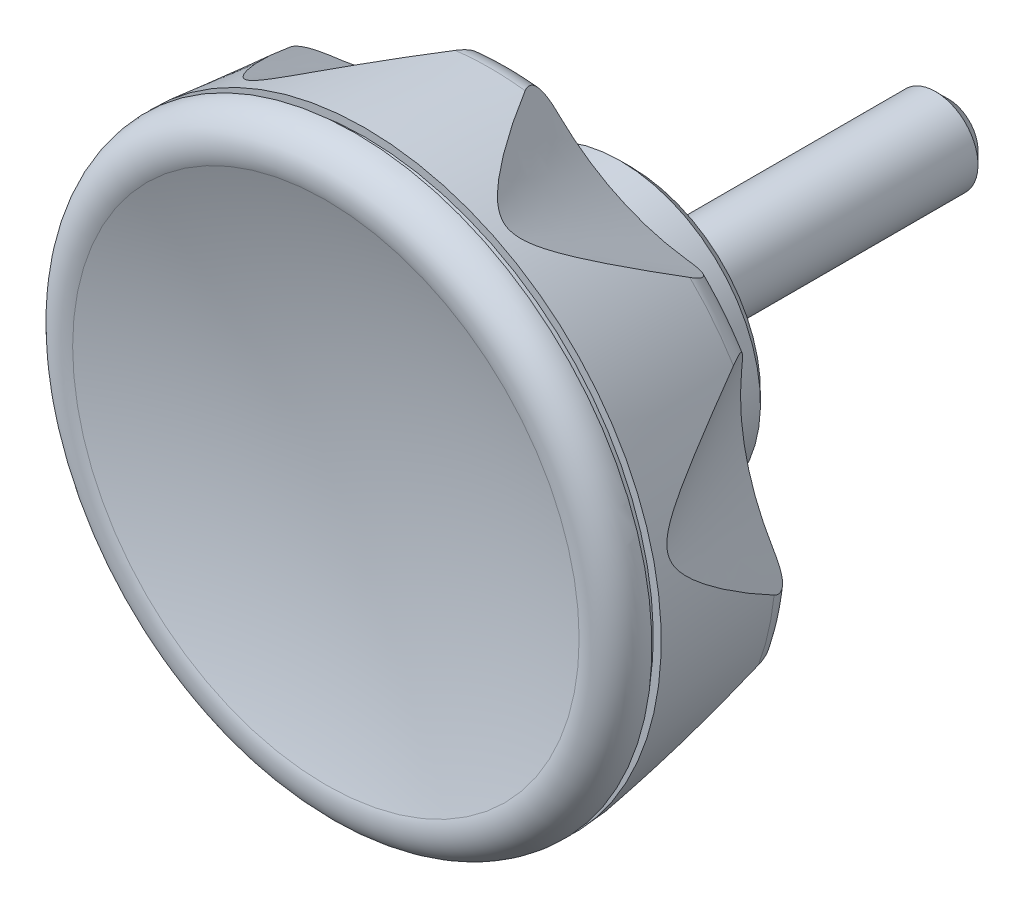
ISO-10303-21;
HEADER;
FILE_DESCRIPTION(('STEP AP214'),'2;1');
FILE_NAME('part.step','',(''),(''),'','','');
FILE_SCHEMA(('AUTOMOTIVE_DESIGN { 1 0 10303 214 1 1 1 1 }'));
ENDSEC;
DATA;
#1=APPLICATION_CONTEXT('core data for automotive mechanical design processes');
#2=APPLICATION_PROTOCOL_DEFINITION('international standard','automotive_design',2000,#1);
#3=PRODUCT_CONTEXT('',#1,'mechanical');
#4=PRODUCT('Part','Part','',(#3));
#5=PRODUCT_RELATED_PRODUCT_CATEGORY('part','',(#4));
#6=PRODUCT_DEFINITION_FORMATION('','',#4);
#7=PRODUCT_DEFINITION_CONTEXT('part definition',#1,'design');
#8=PRODUCT_DEFINITION('design','',#6,#7);
#9=PRODUCT_DEFINITION_SHAPE('','',#8);
#10=(LENGTH_UNIT() NAMED_UNIT(*) SI_UNIT(.MILLI.,.METRE.));
#11=(NAMED_UNIT(*) PLANE_ANGLE_UNIT() SI_UNIT($,.RADIAN.));
#12=(NAMED_UNIT(*) SI_UNIT($,.STERADIAN.) SOLID_ANGLE_UNIT());
#13=UNCERTAINTY_MEASURE_WITH_UNIT(LENGTH_MEASURE(1.E-05),#10,'distance_accuracy_value','');
#14=(GEOMETRIC_REPRESENTATION_CONTEXT(3) GLOBAL_UNCERTAINTY_ASSIGNED_CONTEXT((#13)) GLOBAL_UNIT_ASSIGNED_CONTEXT((#10,
#11,#12)) REPRESENTATION_CONTEXT('',''));
#15=CARTESIAN_POINT('',(0.,0.,0.));
#16=DIRECTION('',(0.,0.,1.));
#17=DIRECTION('',(1.,0.,0.));
#18=AXIS2_PLACEMENT_3D('',#15,#16,#17);
#19=CARTESIAN_POINT('',(0.,0.,13.5));
#20=DIRECTION('',(0.,0.,1.));
#21=DIRECTION('',(0.,1.,0.));
#22=AXIS2_PLACEMENT_3D('',#19,#20,#21);
#23=TOROIDAL_SURFACE('',#22,24.4738282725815,2.4999999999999);
#24=CARTESIAN_POINT('',(0.,0.,11.));
#25=DIRECTION('',(0.,0.,1.));
#26=DIRECTION('',(0.,1.,0.));
#27=AXIS2_PLACEMENT_3D('',#24,#25,#26);
#28=CIRCLE('',#27,24.4738282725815);
#29=CARTESIAN_POINT('',(-16.2379624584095,18.3111126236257,11.));
#30=VERTEX_POINT('',#29);
#31=CARTESIAN_POINT('',(-21.4653013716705,11.7562369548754,11.));
#32=VERTEX_POINT('',#31);
#33=EDGE_CURVE('E131',#30,#32,#28,.T.);
#34=ORIENTED_EDGE('',*,*,#33,.T.);
#35=CARTESIAN_POINT('',(-21.4653013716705,11.7562369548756,11.));
#36=CARTESIAN_POINT('',(-21.4754382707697,11.8601222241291,11.000030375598));
#37=CARTESIAN_POINT('',(-21.4872751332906,11.9639124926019,11.0020766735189));
#38=CARTESIAN_POINT('',(-21.5148402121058,12.1711325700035,11.0112222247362));
#39=CARTESIAN_POINT('',(-21.5305827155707,12.2745596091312,11.0183402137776));
#40=CARTESIAN_POINT('',(-21.5666560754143,12.4816775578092,11.0388207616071));
#41=CARTESIAN_POINT('',(-21.5870535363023,12.5853482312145,11.0522773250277));
#42=CARTESIAN_POINT('',(-21.6327777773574,12.79018793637,11.086761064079));
#43=CARTESIAN_POINT('',(-21.6580966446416,12.8913606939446,11.1077761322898));
#44=CARTESIAN_POINT('',(-21.7159025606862,13.096009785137,11.1604458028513));
#45=CARTESIAN_POINT('',(-21.7487343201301,13.1992460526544,11.1926745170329));
#46=CARTESIAN_POINT('',(-21.8208966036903,13.3985520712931,11.2692171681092));
#47=CARTESIAN_POINT('',(-21.8602062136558,13.494643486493,11.313492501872));
#48=CARTESIAN_POINT('',(-21.9242907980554,13.631369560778,11.3905180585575));
#49=CARTESIAN_POINT('',(-21.9466893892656,13.6760092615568,11.4182052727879));
#50=CARTESIAN_POINT('',(-21.9930436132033,13.7619364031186,11.4772174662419));
#51=CARTESIAN_POINT('',(-22.0169983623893,13.8032257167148,11.5085403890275));
#52=CARTESIAN_POINT('',(-22.0662965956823,13.8818232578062,11.574842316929));
#53=CARTESIAN_POINT('',(-22.0916394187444,13.919133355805,11.6098195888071));
#54=CARTESIAN_POINT('',(-22.1434758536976,13.9891694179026,11.6833341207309));
#55=CARTESIAN_POINT('',(-22.1699692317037,14.0218963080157,11.7218706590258));
#56=CARTESIAN_POINT('',(-22.2204575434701,14.0784837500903,11.7972787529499));
#57=CARTESIAN_POINT('',(-22.2443568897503,14.1029401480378,11.8337680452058));
#58=CARTESIAN_POINT('',(-22.2925479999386,14.147619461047,11.9090357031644));
#59=CARTESIAN_POINT('',(-22.3168398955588,14.1678409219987,11.9478148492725));
#60=CARTESIAN_POINT('',(-22.3655101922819,14.2038164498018,12.0272744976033));
#61=CARTESIAN_POINT('',(-22.3898884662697,14.2195754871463,12.0679528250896));
#62=CARTESIAN_POINT('',(-22.4384945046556,14.2465760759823,12.1508760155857));
#63=CARTESIAN_POINT('',(-22.4627222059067,14.2578158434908,12.1931214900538));
#64=CARTESIAN_POINT('',(-22.5288434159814,14.2825299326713,12.3109990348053));
#65=CARTESIAN_POINT('',(-22.5703388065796,14.2913426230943,12.3878768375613));
#66=CARTESIAN_POINT('',(-22.6510509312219,14.2958836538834,12.5432786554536));
#67=CARTESIAN_POINT('',(-22.6902625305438,14.2915835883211,12.6218058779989));
#68=CARTESIAN_POINT('',(-22.7755265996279,14.2684993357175,12.7992847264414));
#69=CARTESIAN_POINT('',(-22.8206927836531,14.246227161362,12.8982168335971));
#70=CARTESIAN_POINT('',(-22.8841902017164,14.2010917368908,13.044286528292));
#71=CARTESIAN_POINT('',(-22.9046065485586,14.184142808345,13.0924834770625));
#72=CARTESIAN_POINT('',(-22.9440559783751,14.146710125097,13.187982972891));
#73=CARTESIAN_POINT('',(-22.9630908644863,14.1262311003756,13.2352866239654));
#74=CARTESIAN_POINT('',(-22.9814573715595,14.1041446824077,13.2821097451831));
#75=B_SPLINE_CURVE_WITH_KNOTS('',3,(#35,#36,#37,#38,#39,#40,#41,#42,#43,#44,#45,#46,#47,#48,#49,
#50,#51,#52,#53,#54,#55,#56,#57,#58,#59,#60,#61,#62,#63,#64,#65,#66,#67,#68,#69,#70,#71,#72,#73,
#74),.UNSPECIFIED.,.F.,.F.,(4,2,2,2,2,2,2,2,2,2,2,2,2,2,2,2,2,2,2,4),(0.,0.313209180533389,
0.627581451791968,0.946770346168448,1.26545021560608,1.60369981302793,1.94087800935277,
2.11199734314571,2.28302035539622,2.45396261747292,2.62487029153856,2.77466826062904,
2.92451758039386,3.07419932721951,3.22394010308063,3.48614173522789,3.74891177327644,
4.08027673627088,4.24522540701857,4.40995475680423),.UNSPECIFIED.);
#76=CARTESIAN_POINT('',(-22.981457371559,14.1041446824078,13.2821097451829));
#77=VERTEX_POINT('',#76);
#78=EDGE_CURVE('E114',#32,#77,#75,.T.);
#79=ORIENTED_EDGE('',*,*,#78,.T.);
#80=CARTESIAN_POINT('',(0.,0.,13.282109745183));
#81=DIRECTION('',(0.,0.,1.));
#82=DIRECTION('',(0.,1.,0.));
#83=AXIS2_PLACEMENT_3D('',#80,#81,#82);
#84=CIRCLE('',#83,26.9643149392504);
#85=CARTESIAN_POINT('',(-18.8643796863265,19.2667968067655,13.282109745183));
#86=VERTEX_POINT('',#85);
#87=EDGE_CURVE('E146',#86,#77,#84,.T.);
#88=ORIENTED_EDGE('',*,*,#87,.F.);
#89=CARTESIAN_POINT('',(-18.8643796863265,19.2667968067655,13.282109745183));
#90=CARTESIAN_POINT('',(-18.8981743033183,19.2226732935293,13.1915305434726));
#91=CARTESIAN_POINT('',(-18.9255552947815,19.1772447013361,13.0988167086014));
#92=CARTESIAN_POINT('',(-18.9651950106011,19.0843052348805,12.9100927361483));
#93=CARTESIAN_POINT('',(-18.9773008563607,19.0367781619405,12.8140590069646));
#94=CARTESIAN_POINT('',(-18.983341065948,18.9407957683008,12.6209607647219));
#95=CARTESIAN_POINT('',(-18.9771650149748,18.8923365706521,12.5238935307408));
#96=CARTESIAN_POINT('',(-18.9442986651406,18.7968510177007,12.3329550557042));
#97=CARTESIAN_POINT('',(-18.917699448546,18.7498192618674,12.2390715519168));
#98=CARTESIAN_POINT('',(-18.8474169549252,18.6641060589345,12.0674765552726));
#99=CARTESIAN_POINT('',(-18.8058006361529,18.6250650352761,11.9890989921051));
#100=CARTESIAN_POINT('',(-18.7069025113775,18.5516039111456,11.8403817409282));
#101=CARTESIAN_POINT('',(-18.6496092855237,18.5171872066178,11.7700479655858));
#102=CARTESIAN_POINT('',(-18.5279204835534,18.457227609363,11.6454449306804));
#103=CARTESIAN_POINT('',(-18.4646762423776,18.4311577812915,11.5902907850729));
#104=CARTESIAN_POINT('',(-18.3299240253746,18.3843608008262,11.4887242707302));
#105=CARTESIAN_POINT('',(-18.2584221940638,18.3636297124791,11.4423054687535));
#106=CARTESIAN_POINT('',(-18.0741590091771,18.3189481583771,11.3379996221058));
#107=CARTESIAN_POINT('',(-17.9578593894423,18.2981009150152,11.2850492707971));
#108=CARTESIAN_POINT('',(-17.7173155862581,18.2668011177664,11.1949523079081));
#109=CARTESIAN_POINT('',(-17.5930199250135,18.2564250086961,11.1579230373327));
#110=CARTESIAN_POINT('',(-17.3654004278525,18.2458816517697,11.1030967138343));
#111=CARTESIAN_POINT('',(-17.2626807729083,18.2441255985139,11.0829631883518));
#112=CARTESIAN_POINT('',(-17.0560091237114,18.2457463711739,11.0499258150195));
#113=CARTESIAN_POINT('',(-16.9520556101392,18.2491303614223,11.0370320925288));
#114=CARTESIAN_POINT('',(-16.7461255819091,18.260237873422,11.0174873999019));
#115=CARTESIAN_POINT('',(-16.6441552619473,18.2678653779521,11.0107067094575));
#116=CARTESIAN_POINT('',(-16.4406884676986,18.2868392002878,11.0019849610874));
#117=CARTESIAN_POINT('',(-16.3391915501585,18.2981729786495,11.000027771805));
#118=CARTESIAN_POINT('',(-16.2379624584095,18.3111126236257,11.));
#119=B_SPLINE_CURVE_WITH_KNOTS('',3,(#89,#90,#91,#92,#93,#94,#95,#96,#97,#98,#99,#100,#101,#102,
#103,#104,#105,#106,#107,#108,#109,#110,#111,#112,#113,#114,#115,#116,#117,#118),.UNSPECIFIED.,
.F.,.F.,(4,2,2,2,2,2,2,2,2,2,2,2,2,2,4),(0.,0.319088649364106,0.641346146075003,
0.96555390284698,1.28832411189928,1.57749027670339,1.86686764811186,2.12940978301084,
2.39175780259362,2.77800167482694,3.16704536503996,3.48068996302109,3.79477212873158,
4.10202079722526,4.40824052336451),.UNSPECIFIED.);
#120=EDGE_CURVE('E136',#86,#30,#119,.T.);
#121=ORIENTED_EDGE('',*,*,#120,.T.);
#122=EDGE_LOOP('',(#34,#79,#88,#121));
#123=FACE_BOUND('',#122,.T.);
#124=ADVANCED_FACE('F14',(#123),#23,.T.);
#125=CARTESIAN_POINT('',(-26.8251366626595,-2.73611461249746,13.282109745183));
#126=VERTEX_POINT('',#125);
#127=CARTESIAN_POINT('',(-25.355768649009,-9.17383651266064,13.282109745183));
#128=VERTEX_POINT('',#127);
#129=EDGE_CURVE('E153',#126,#128,#84,.T.);
#130=ORIENTED_EDGE('',*,*,#129,.F.);
#131=CARTESIAN_POINT('',(-26.8251366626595,-2.73611461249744,13.282109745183));
#132=CARTESIAN_POINT('',(-26.8117101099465,-2.79004686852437,13.1915305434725));
#133=CARTESIAN_POINT('',(-26.7932643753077,-2.83977845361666,13.0988167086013));
#134=CARTESIAN_POINT('',(-26.7453163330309,-2.92871684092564,12.9100927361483));
#135=CARTESIAN_POINT('',(-26.7157060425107,-2.96781421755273,12.8140590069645));
#136=CARTESIAN_POINT('',(-26.6444299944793,-3.0323806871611,12.620960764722));
#137=CARTESIAN_POINT('',(-26.602692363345,-3.0577658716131,12.5238935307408));
#138=CARTESIAN_POINT('',(-26.507546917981,-3.09160419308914,12.3329550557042));
#139=CARTESIAN_POINT('',(-26.4541916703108,-3.10013190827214,12.2390715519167));
#140=CARTESIAN_POINT('',(-26.3433579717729,-3.09862415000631,12.0674765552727));
#141=CARTESIAN_POINT('',(-26.2868871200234,-3.09042888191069,11.9890989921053));
#142=CARTESIAN_POINT('',(-26.1677909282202,-3.05890947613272,11.8403817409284));
#143=CARTESIAN_POINT('',(-26.1051611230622,-3.03557429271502,11.7700479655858));
#144=CARTESIAN_POINT('',(-25.9824110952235,-2.97781835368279,11.6454449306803));
#145=CARTESIAN_POINT('',(-25.9225967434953,-2.94462628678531,11.590290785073));
#146=CARTESIAN_POINT('',(-25.8019927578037,-2.86845020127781,11.4887242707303));
#147=CARTESIAN_POINT('',(-25.7412038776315,-2.82547344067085,11.4423054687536));
#148=CARTESIAN_POINT('',(-25.5913842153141,-2.70926917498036,11.3379996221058));
#149=CARTESIAN_POINT('',(-25.5025735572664,-2.63134051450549,11.2850492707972));
#150=CARTESIAN_POINT('',(-25.3281257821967,-2.46279090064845,11.194952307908));
#151=CARTESIAN_POINT('',(-25.2425163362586,-2.37208203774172,11.1579230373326));
#152=CARTESIAN_POINT('',(-25.0923547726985,-2.20069562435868,11.1030967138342));
#153=CARTESIAN_POINT('',(-25.0269371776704,-2.12148104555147,11.0829631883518));
#154=CARTESIAN_POINT('',(-24.8993466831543,-1.95888810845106,11.0499258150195));
#155=CARTESIAN_POINT('',(-24.8371784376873,-1.87550409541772,11.0370320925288));
#156=CARTESIAN_POINT('',(-24.7174673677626,-1.70757609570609,11.0174873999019));
#157=CARTESIAN_POINT('',(-24.6598533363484,-1.62309681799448,11.0107067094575));
#158=CARTESIAN_POINT('',(-24.5478281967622,-1.45219008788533,11.0019849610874));
#159=CARTESIAN_POINT('',(-24.4934070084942,-1.365770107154,11.000027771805));
#160=CARTESIAN_POINT('',(-24.4404083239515,-1.27855827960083,11.));
#161=B_SPLINE_CURVE_WITH_KNOTS('',3,(#131,#132,#133,#134,#135,#136,#137,#138,#139,#140,#141,
#142,#143,#144,#145,#146,#147,#148,#149,#150,#151,#152,#153,#154,#155,#156,#157,#158,#159,#160),
.UNSPECIFIED.,.F.,.F.,(4,2,2,2,2,2,2,2,2,2,2,2,2,2,4),(0.,0.319088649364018,0.641346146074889,
0.965553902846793,1.288324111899,1.57749027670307,1.8668676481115,2.12940978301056,
2.39175780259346,2.77800167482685,3.16704536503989,3.4806899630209,3.79477212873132,
4.10202079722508,4.40824052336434),.UNSPECIFIED.);
#162=CARTESIAN_POINT('',(-24.4404083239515,-1.27855827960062,11.));
#163=VERTEX_POINT('',#162);
#164=EDGE_CURVE('E29',#126,#163,#161,.T.);
#165=ORIENTED_EDGE('',*,*,#164,.T.);
#166=CARTESIAN_POINT('',(-22.5747926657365,-9.45235454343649,11.));
#167=VERTEX_POINT('',#166);
#168=EDGE_CURVE('E133',#163,#167,#28,.T.);
#169=ORIENTED_EDGE('',*,*,#168,.T.);
#170=CARTESIAN_POINT('',(-22.5747926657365,-9.45235454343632,11.));
#171=CARTESIAN_POINT('',(-22.6623336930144,-9.39550848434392,11.000030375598));
#172=CARTESIAN_POINT('',(-22.7508603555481,-9.34005074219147,11.0020766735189));
#173=CARTESIAN_POINT('',(-22.930058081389,-9.23240238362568,11.0112222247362));
#174=CARTESIAN_POINT('',(-23.0207358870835,-9.18022466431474,11.0183402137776));
#175=CARTESIAN_POINT('',(-23.2051585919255,-9.07929202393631,11.0388207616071));
#176=CARTESIAN_POINT('',(-23.2989291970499,-9.03060179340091,11.0522773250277));
#177=CARTESIAN_POINT('',(-23.4875879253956,-8.93863497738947,11.0867610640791));
#178=CARTESIAN_POINT('',(-23.5824740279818,-8.89534988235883,11.1077761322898));
#179=CARTESIAN_POINT('',(-23.7785165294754,-8.81294774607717,11.1604458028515));
#180=CARTESIAN_POINT('',(-23.8797001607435,-8.77424988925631,11.1926745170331));
#181=CARTESIAN_POINT('',(-24.0805163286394,-8.70640336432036,11.2692171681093));
#182=CARTESIAN_POINT('',(-24.1801527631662,-8.67722483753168,11.3134925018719));
#183=CARTESIAN_POINT('',(-24.3270055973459,-8.64208087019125,11.3905180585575));
#184=CARTESIAN_POINT('',(-24.3758716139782,-8.63176039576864,11.4182052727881));
#185=CARTESIAN_POINT('',(-24.4719535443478,-8.6144268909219,11.4772174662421));
#186=CARTESIAN_POINT('',(-24.5191703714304,-8.60741200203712,11.5085403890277));
#187=CARTESIAN_POINT('',(-24.611357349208,-8.59695014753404,11.5748423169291));
#188=CARTESIAN_POINT('',(-24.6563285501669,-8.59350149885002,11.6098195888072));
#189=CARTESIAN_POINT('',(-24.7434044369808,-8.59036208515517,11.683334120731));
#190=CARTESIAN_POINT('',(-24.785509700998,-8.59067055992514,11.721870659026));
#191=CARTESIAN_POINT('',(-24.8612304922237,-8.594862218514,11.79727875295));
#192=CARTESIAN_POINT('',(-24.8952522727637,-8.59829916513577,11.8337680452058));
#193=CARTESIAN_POINT('',(-24.960230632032,-8.60811939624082,11.9090357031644));
#194=CARTESIAN_POINT('',(-24.9911861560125,-8.61450369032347,11.9478148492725));
#195=CARTESIAN_POINT('',(-25.0496583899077,-8.63012528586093,12.0272744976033));
#196=CARTESIAN_POINT('',(-25.0771789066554,-8.63935938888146,12.0679528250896));
#197=CARTESIAN_POINT('',(-25.1285941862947,-8.66052652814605,12.1508760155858));
#198=CARTESIAN_POINT('',(-25.152487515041,-8.67246062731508,12.1931214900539));
#199=CARTESIAN_POINT('',(-25.2130356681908,-8.70874728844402,12.3109990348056));
#200=CARTESIAN_POINT('',(-25.2457976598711,-8.73569506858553,12.3878768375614));
#201=CARTESIAN_POINT('',(-25.2996711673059,-8.79596706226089,12.5432786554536));
#202=CARTESIAN_POINT('',(-25.3207572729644,-8.82930497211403,12.621805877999));
#203=CARTESIAN_POINT('',(-25.3558705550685,-8.91035990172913,12.7992847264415));
#204=CARTESIAN_POINT('',(-25.3666181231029,-8.9595587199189,12.8982168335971));
#205=CARTESIAN_POINT('',(-25.3709198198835,-9.03734447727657,13.0442865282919));
#206=CARTESIAN_POINT('',(-25.3703979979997,-9.0638741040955,13.0924834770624));
#207=CARTESIAN_POINT('',(-25.3657282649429,-9.11805580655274,13.1879829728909));
#208=CARTESIAN_POINT('',(-25.3615851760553,-9.14570634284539,13.2352866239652));
#209=CARTESIAN_POINT('',(-25.355768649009,-9.17383651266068,13.282109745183));
#210=B_SPLINE_CURVE_WITH_KNOTS('',3,(#170,#171,#172,#173,#174,#175,#176,#177,#178,#179,#180,
#181,#182,#183,#184,#185,#186,#187,#188,#189,#190,#191,#192,#193,#194,#195,#196,#197,#198,#199,
#200,#201,#202,#203,#204,#205,#206,#207,#208,#209),.UNSPECIFIED.,.F.,.F.,(4,2,2,2,2,2,2,2,2,2,2,
2,2,2,2,2,2,2,2,4),(0.,0.313209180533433,0.627581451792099,0.946770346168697,1.26545021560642,
1.60369981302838,1.9408780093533,2.11199734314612,2.28302035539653,2.45396261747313,
2.62487029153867,2.77466826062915,2.92451758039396,3.07419932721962,3.22394010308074,
3.48614173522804,3.74891177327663,4.08027673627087,4.24522540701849,4.40995475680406),.UNSPECIFIED.);
#211=EDGE_CURVE('E306',#167,#128,#210,.T.);
#212=ORIENTED_EDGE('',*,*,#211,.T.);
#213=EDGE_LOOP('',(#130,#165,#169,#212));
#214=FACE_BOUND('',#213,.T.);
#215=ADVANCED_FACE('F416',(#214),#23,.T.);
#216=CARTESIAN_POINT('',(-14.586018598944,-22.6786759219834,13.282109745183));
#217=VERTEX_POINT('',#216);
#218=CARTESIAN_POINT('',(-8.63666897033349,-25.5437317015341,13.282109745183));
#219=VERTEX_POINT('',#218);
#220=EDGE_CURVE('E157',#217,#219,#84,.T.);
#221=ORIENTED_EDGE('',*,*,#220,.F.);
#222=CARTESIAN_POINT('',(-14.586018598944,-22.6786759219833,13.282109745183));
#223=CARTESIAN_POINT('',(-14.5354813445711,-22.7018048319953,13.1915305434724));
#224=CARTESIAN_POINT('',(-14.4850988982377,-22.7183905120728,13.0988167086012));
#225=CARTESIAN_POINT('',(-14.3856689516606,-22.736355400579,12.9100927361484));
#226=CARTESIAN_POINT('',(-14.336639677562,-22.7375819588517,12.8140590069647));
#227=CARTESIAN_POINT('',(-14.2417196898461,-22.7221126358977,12.620960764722));
#228=CARTESIAN_POINT('',(-14.1958497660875,-22.7053082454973,12.5238935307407));
#229=CARTESIAN_POINT('',(-14.1100716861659,-22.6520183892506,12.3329550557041));
#230=CARTESIAN_POINT('',(-14.070137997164,-22.6156205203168,12.2390715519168));
#231=CARTESIAN_POINT('',(-14.0022131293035,-22.5280271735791,12.0674765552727));
#232=CARTESIAN_POINT('',(-13.9734114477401,-22.4787668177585,11.9890989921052));
#233=CARTESIAN_POINT('',(-13.9237990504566,-22.3660016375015,11.8403817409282));
#234=CARTESIAN_POINT('',(-13.9029941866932,-22.3024864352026,11.7700479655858));
#235=CARTESIAN_POINT('',(-13.8716162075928,-22.1705063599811,11.6454449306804));
#236=CARTESIAN_POINT('',(-13.8602731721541,-22.1030467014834,11.590290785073));
#237=CARTESIAN_POINT('',(-13.8446346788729,-21.9612596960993,11.4887242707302));
#238=CARTESIAN_POINT('',(-13.8403340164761,-21.8869374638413,11.4423054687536));
#239=CARTESIAN_POINT('',(-13.8377751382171,-21.6973515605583,11.3379996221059));
#240=CARTESIAN_POINT('',(-13.8433296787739,-21.5793288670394,11.2850492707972));
#241=CARTESIAN_POINT('',(-13.8663406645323,-21.3378511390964,11.194952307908));
#242=CARTESIAN_POINT('',(-13.8838830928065,-21.2143629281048,11.1579230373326));
#243=CARTESIAN_POINT('',(-13.9242541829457,-20.9901042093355,11.1030967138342));
#244=CARTESIAN_POINT('',(-13.9453994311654,-20.8895691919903,11.0829631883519));
#245=CARTESIAN_POINT('',(-13.9929683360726,-20.6884398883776,11.0499258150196));
#246=CARTESIAN_POINT('',(-14.0193993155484,-20.5878457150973,11.0370320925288));
#247=CARTESIAN_POINT('',(-14.0760520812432,-20.3895504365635,11.0174873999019));
#248=CARTESIAN_POINT('',(-14.1061788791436,-20.2918340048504,11.0107067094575));
#249=CARTESIAN_POINT('',(-14.1699526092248,-20.097690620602,11.0019849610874));
#250=CARTESIAN_POINT('',(-14.2035874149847,-20.001260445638,11.000027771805));
#251=CARTESIAN_POINT('',(-14.238728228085,-19.9054487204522,11.));
#252=B_SPLINE_CURVE_WITH_KNOTS('',3,(#222,#223,#224,#225,#226,#227,#228,#229,#230,#231,#232,
#233,#234,#235,#236,#237,#238,#239,#240,#241,#242,#243,#244,#245,#246,#247,#248,#249,#250,#251),
.UNSPECIFIED.,.F.,.F.,(4,2,2,2,2,2,2,2,2,2,2,2,2,2,4),(0.,0.319088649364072,0.641346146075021,
0.965553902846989,1.28832411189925,1.5774902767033,1.86686764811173,2.12940978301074,
2.39175780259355,2.77800167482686,3.16704536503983,3.48068996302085,3.79477212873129,
4.10202079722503,4.40824052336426),.UNSPECIFIED.);
#253=CARTESIAN_POINT('',(-14.238728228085,-19.905448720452,11.));
#254=VERTEX_POINT('',#253);
#255=EDGE_CURVE('E37',#217,#254,#252,.T.);
#256=ORIENTED_EDGE('',*,*,#255,.T.);
#257=CARTESIAN_POINT('',(-6.685004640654,-23.5431302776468,11.));
#258=VERTEX_POINT('',#257);
#259=EDGE_CURVE('E143',#254,#258,#28,.T.);
#260=ORIENTED_EDGE('',*,*,#259,.T.);
#261=CARTESIAN_POINT('',(-6.685004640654,-23.5431302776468,11.));
#262=CARTESIAN_POINT('',(-6.78402961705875,-23.5761296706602,11.000030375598));
#263=CARTESIAN_POINT('',(-6.88258369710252,-23.6107652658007,11.0020766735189));
#264=CARTESIAN_POINT('',(-7.07847452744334,-23.6837500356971,11.0112222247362));
#265=CARTESIAN_POINT('',(-7.17580539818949,-23.7221125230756,11.0183402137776));
#266=CARTESIAN_POINT('',(-7.36970338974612,-23.8033695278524,11.0388207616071));
#267=CARTESIAN_POINT('',(-7.46623596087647,-23.8463244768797,11.0522773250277));
#268=CARTESIAN_POINT('',(-7.65576530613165,-23.9364834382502,11.0867610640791));
#269=CARTESIAN_POINT('',(-7.74876747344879,-23.9836805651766,11.1077761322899));
#270=CARTESIAN_POINT('',(-7.93542255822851,-24.0855758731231,11.1604458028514));
#271=CARTESIAN_POINT('',(-8.02876472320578,-24.1405567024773,11.192674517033));
#272=CARTESIAN_POINT('',(-8.2070161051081,-24.2552594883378,11.2692171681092));
#273=CARTESIAN_POINT('',(-8.29195109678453,-24.3149658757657,11.313492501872));
#274=CARTESIAN_POINT('',(-8.41098900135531,-24.4078681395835,11.3905180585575));
#275=CARTESIAN_POINT('',(-8.44952533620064,-24.4396384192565,11.418205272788));
#276=CARTESIAN_POINT('',(-8.52298331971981,-24.5039510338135,11.477217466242));
#277=CARTESIAN_POINT('',(-8.55790699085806,-24.5364929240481,11.5085403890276));
#278=CARTESIAN_POINT('',(-8.62356403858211,-24.602044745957,11.5748423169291));
#279=CARTESIAN_POINT('',(-8.65429938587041,-24.6350544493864,11.6098195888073));
#280=CARTESIAN_POINT('',(-8.71104480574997,-24.7011757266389,11.683334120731));
#281=CARTESIAN_POINT('',(-8.73705583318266,-24.7342872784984,11.7218706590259));
#282=CARTESIAN_POINT('',(-8.78098980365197,-24.796101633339,11.7972787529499));
#283=CARTESIAN_POINT('',(-8.79951492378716,-24.824843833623,11.8337680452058));
#284=CARTESIAN_POINT('',(-8.8323505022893,-24.8817687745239,11.9090357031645));
#285=CARTESIAN_POINT('',(-8.84665951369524,-24.9099513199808,11.9478148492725));
#286=CARTESIAN_POINT('',(-8.87090290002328,-24.9654066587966,12.0272744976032));
#287=CARTESIAN_POINT('',(-8.88084214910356,-24.9926804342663,12.0679528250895));
#288=CARTESIAN_POINT('',(-8.89634991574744,-25.0460760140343,12.1508760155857));
#289=CARTESIAN_POINT('',(-8.90191670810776,-25.0721973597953,12.1931214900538));
#290=CARTESIAN_POINT('',(-8.91129781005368,-25.1421601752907,12.3109990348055));
#291=CARTESIAN_POINT('',(-8.91065595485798,-25.1845761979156,12.3878768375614));
#292=CARTESIAN_POINT('',(-8.8971229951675,-25.2642751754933,12.5432786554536));
#293=CARTESIAN_POINT('',(-8.88420533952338,-25.3015468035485,12.621805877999));
#294=CARTESIAN_POINT('',(-8.84272681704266,-25.3795363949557,12.7992847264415));
#295=CARTESIAN_POINT('',(-8.81096263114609,-25.4186141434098,12.8982168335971));
#296=CARTESIAN_POINT('',(-8.75282934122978,-25.4704759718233,13.044286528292));
#297=CARTESIAN_POINT('',(-8.73176229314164,-25.486608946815,13.0924834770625));
#298=CARTESIAN_POINT('',(-8.68648980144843,-25.5167397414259,13.187982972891));
#299=CARTESIAN_POINT('',(-8.66228856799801,-25.5307403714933,13.2352866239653));
#300=CARTESIAN_POINT('',(-8.63666897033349,-25.5437317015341,13.2821097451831));
#301=B_SPLINE_CURVE_WITH_KNOTS('',3,(#261,#262,#263,#264,#265,#266,#267,#268,#269,#270,#271,
#272,#273,#274,#275,#276,#277,#278,#279,#280,#281,#282,#283,#284,#285,#286,#287,#288,#289,#290,
#291,#292,#293,#294,#295,#296,#297,#298,#299,#300),.UNSPECIFIED.,.F.,.F.,(4,2,2,2,2,2,2,2,2,2,2,
2,2,2,2,2,2,2,2,4),(0.,0.313209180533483,0.627581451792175,0.946770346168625,1.26545021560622,
1.60369981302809,1.940878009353,2.11199734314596,2.28302035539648,2.45396261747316,
2.62487029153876,2.77466826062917,2.92451758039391,3.07419932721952,3.22394010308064,
3.48614173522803,3.74891177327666,4.0802767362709,4.24522540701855,4.40995475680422),.UNSPECIFIED.);
#302=EDGE_CURVE('E322',#258,#219,#301,.T.);
#303=ORIENTED_EDGE('',*,*,#302,.T.);
#304=EDGE_LOOP('',(#221,#256,#260,#303));
#305=FACE_BOUND('',#304,.T.);
#306=ADVANCED_FACE('F447',(#305),#23,.T.);
#307=CARTESIAN_POINT('',(8.636668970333,-25.5437317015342,13.282109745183));
#308=VERTEX_POINT('',#307);
#309=CARTESIAN_POINT('',(14.586018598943,-22.6786759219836,13.282109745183));
#310=VERTEX_POINT('',#309);
#311=EDGE_CURVE('E455',#308,#310,#84,.T.);
#312=ORIENTED_EDGE('',*,*,#311,.F.);
#313=CARTESIAN_POINT('',(8.636668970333,-25.5437317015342,13.2821097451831));
#314=CARTESIAN_POINT('',(8.68626134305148,-25.5186407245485,13.1915305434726));
#315=CARTESIAN_POINT('',(8.73064149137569,-25.4895911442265,13.0988167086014));
#316=CARTESIAN_POINT('',(8.80668056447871,-25.4230546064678,12.9100927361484));
#317=CARTESIAN_POINT('',(8.83820877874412,-25.3854867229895,12.8140590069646));
#318=CARTESIAN_POINT('',(8.88529601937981,-25.3016303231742,12.6209607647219));
#319=CARTESIAN_POINT('',(8.90075724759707,-25.2552904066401,12.5238935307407));
#320=CARTESIAN_POINT('',(8.91257531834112,-25.1550007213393,12.3329550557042));
#321=CARTESIAN_POINT('',(8.90901656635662,-25.1010856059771,12.2390715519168));
#322=CARTESIAN_POINT('',(8.88288379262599,-24.9933662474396,12.0674765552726));
#323=CARTESIAN_POINT('',(8.8623280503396,-24.9401348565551,11.9890989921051));
#324=CARTESIAN_POINT('',(8.80509750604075,-24.8310383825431,11.8403817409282));
#325=CARTESIAN_POINT('',(8.76841094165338,-24.7751714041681,11.7700479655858));
#326=CARTESIAN_POINT('',(8.68478861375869,-24.6683508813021,11.6454449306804));
#327=CARTESIAN_POINT('',(8.63911879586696,-24.6174221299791,11.5902907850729));
#328=CARTESIAN_POINT('',(8.53801569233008,-24.5167927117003,11.4887242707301));
#329=CARTESIAN_POINT('',(8.48258965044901,-24.4670911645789,11.4423054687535));
#330=CARTESIAN_POINT('',(8.33596085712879,-24.3468856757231,11.3379996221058));
#331=CARTESIAN_POINT('',(8.24022380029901,-24.277642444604,11.285049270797));
#332=CARTESIAN_POINT('',(8.03708179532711,-24.1450742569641,11.194952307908));
#333=CARTESIAN_POINT('',(7.9295972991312,-24.081795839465,11.1579230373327));
#334=CARTESIAN_POINT('',(7.72909380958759,-23.9735362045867,11.1030967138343));
#335=CARTESIAN_POINT('',(7.63730852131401,-23.9273856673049,11.0829631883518));
#336=CARTESIAN_POINT('',(7.45040057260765,-23.8391744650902,11.0499258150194));
#337=CARTESIAN_POINT('',(7.35527343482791,-23.7971195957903,11.0370320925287));
#338=CARTESIAN_POINT('',(7.16491752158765,-23.7177774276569,11.0174873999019));
#339=CARTESIAN_POINT('',(7.06973598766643,-23.6804063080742,11.0107067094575));
#340=CARTESIAN_POINT('',(6.87818630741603,-23.6092201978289,11.0019849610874));
#341=CARTESIAN_POINT('',(6.78182320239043,-23.5753937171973,11.000027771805));
#342=CARTESIAN_POINT('',(6.6850046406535,-23.543130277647,11.));
#343=B_SPLINE_CURVE_WITH_KNOTS('',3,(#313,#314,#315,#316,#317,#318,#319,#320,#321,#322,#323,
#324,#325,#326,#327,#328,#329,#330,#331,#332,#333,#334,#335,#336,#337,#338,#339,#340,#341,#342),
.UNSPECIFIED.,.F.,.F.,(4,2,2,2,2,2,2,2,2,2,2,2,2,2,4),(0.,0.319088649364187,0.641346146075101,
0.965553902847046,1.28832411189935,1.57749027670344,1.86686764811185,2.12940978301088,
2.39175780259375,2.77800167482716,3.16704536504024,3.48068996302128,3.79477212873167,
4.1020207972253,4.40824052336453),.UNSPECIFIED.);
#344=CARTESIAN_POINT('',(6.685004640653,-23.5431302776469,11.));
#345=VERTEX_POINT('',#344);
#346=EDGE_CURVE('E315',#308,#345,#343,.T.);
#347=ORIENTED_EDGE('',*,*,#346,.T.);
#348=CARTESIAN_POINT('',(14.2387282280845,-19.9054487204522,11.));
#349=VERTEX_POINT('',#348);
#350=EDGE_CURVE('E449',#345,#349,#28,.T.);
#351=ORIENTED_EDGE('',*,*,#350,.T.);
#352=CARTESIAN_POINT('',(14.2387282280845,-19.9054487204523,11.));
#353=CARTESIAN_POINT('',(14.202787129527,-20.0034443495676,11.000030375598));
#354=CARTESIAN_POINT('',(14.168418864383,-20.1020919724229,11.0020766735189));
#355=CARTESIAN_POINT('',(14.1033447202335,-20.3007508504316,11.0112222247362));
#356=CARTESIAN_POINT('',(14.0726529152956,-20.4007658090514,11.0183402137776));
#357=CARTESIAN_POINT('',(14.0152887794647,-20.6030242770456,11.038820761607));
#358=CARTESIAN_POINT('',(13.9886852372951,-20.7052784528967,11.0522773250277));
#359=CARTESIAN_POINT('',(13.9410047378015,-20.9096716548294,11.086761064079));
#360=CARTESIAN_POINT('',(13.9199190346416,-21.0118106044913,11.1077761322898));
#361=CARTESIAN_POINT('',(13.8832064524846,-21.2212741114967,11.1604458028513));
#362=CARTESIAN_POINT('',(13.8679943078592,-21.3285319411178,11.1926745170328));
#363=CARTESIAN_POINT('',(13.8465346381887,-21.5394105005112,11.269217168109));
#364=CARTESIAN_POINT('',(13.8402588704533,-21.6430416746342,11.3134925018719));
#365=CARTESIAN_POINT('',(13.8386738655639,-21.7940328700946,11.3905180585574));
#366=CARTESIAN_POINT('',(13.8394858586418,-21.843970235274,11.4182052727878));
#367=CARTESIAN_POINT('',(13.8439671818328,-21.9415002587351,11.4772174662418));
#368=CARTESIAN_POINT('',(13.8476349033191,-21.9890942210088,11.5085403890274));
#369=CARTESIAN_POINT('',(13.8579488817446,-22.0812978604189,11.5748423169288));
#370=CARTESIAN_POINT('',(13.8645937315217,-22.1259089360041,11.609819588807));
#371=CARTESIAN_POINT('',(13.8809092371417,-22.2115002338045,11.6833341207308));
#372=CARTESIAN_POINT('',(13.8905792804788,-22.2524811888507,11.7218706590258));
#373=CARTESIAN_POINT('',(13.9115153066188,-22.3253707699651,11.7972787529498));
#374=CARTESIAN_POINT('',(13.9224366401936,-22.3577747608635,11.8337680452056));
#375=CARTESIAN_POINT('',(13.9464697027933,-22.4189387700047,11.9090357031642));
#376=CARTESIAN_POINT('',(13.9595821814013,-22.4476975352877,11.9478148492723));
#377=CARTESIAN_POINT('',(13.9878234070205,-22.5012276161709,12.0272744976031));
#378=CARTESIAN_POINT('',(14.0029498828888,-22.5260033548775,12.0679528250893));
#379=CARTESIAN_POINT('',(14.0350272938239,-22.5714194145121,12.1508760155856));
#380=CARTESIAN_POINT('',(14.0519789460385,-22.5920581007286,12.1931214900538));
#381=CARTESIAN_POINT('',(14.1008290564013,-22.6430136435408,12.3109990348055));
#382=CARTESIAN_POINT('',(14.1343914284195,-22.6689577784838,12.3878768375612));
#383=CARTESIAN_POINT('',(14.2051402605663,-22.7080687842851,12.5432786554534));
#384=CARTESIAN_POINT('',(14.2423344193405,-22.7212078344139,12.6218058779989));
#385=CARTESIAN_POINT('',(14.3291705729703,-22.7374043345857,12.7992847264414));
#386=CARTESIAN_POINT('',(14.3795274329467,-22.7369346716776,12.898216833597));
#387=CARTESIAN_POINT('',(14.4563201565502,-22.7238195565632,13.0442865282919));
#388=CARTESIAN_POINT('',(14.4820685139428,-22.7174074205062,13.0924834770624));
#389=CARTESIAN_POINT('',(14.5338526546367,-22.7007982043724,13.1879829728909));
#390=CARTESIAN_POINT('',(14.5598880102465,-22.6906061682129,13.2352866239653));
#391=CARTESIAN_POINT('',(14.586018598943,-22.6786759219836,13.2821097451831));
#392=B_SPLINE_CURVE_WITH_KNOTS('',3,(#352,#353,#354,#355,#356,#357,#358,#359,#360,#361,#362,
#363,#364,#365,#366,#367,#368,#369,#370,#371,#372,#373,#374,#375,#376,#377,#378,#379,#380,#381,
#382,#383,#384,#385,#386,#387,#388,#389,#390,#391),.UNSPECIFIED.,.F.,.F.,(4,2,2,2,2,2,2,2,2,2,2,
2,2,2,2,2,2,2,2,4),(0.,0.313209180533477,0.627581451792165,0.946770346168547,1.26545021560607,
1.60369981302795,1.94087800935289,2.11199734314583,2.28302035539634,2.45396261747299,
2.62487029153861,2.77466826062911,2.9245175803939,3.07419932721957,3.22394010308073,
3.48614173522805,3.74891177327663,4.08027673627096,4.24522540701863,4.40995475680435),.UNSPECIFIED.);
#393=EDGE_CURVE('E338',#349,#310,#392,.T.);
#394=ORIENTED_EDGE('',*,*,#393,.T.);
#395=EDGE_LOOP('',(#312,#347,#351,#394));
#396=FACE_BOUND('',#395,.T.);
#397=ADVANCED_FACE('F428',(#396),#23,.T.);
#398=CARTESIAN_POINT('',(25.3557686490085,-9.17383651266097,13.282109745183));
#399=VERTEX_POINT('',#398);
#400=CARTESIAN_POINT('',(26.825136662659,-2.73611461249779,13.282109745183));
#401=VERTEX_POINT('',#400);
#402=EDGE_CURVE('E164',#399,#401,#84,.T.);
#403=ORIENTED_EDGE('',*,*,#402,.F.);
#404=CARTESIAN_POINT('',(25.3557686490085,-9.17383651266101,13.282109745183));
#405=CARTESIAN_POINT('',(25.3670720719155,-9.11941966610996,13.1915305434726));
#406=CARTESIAN_POINT('',(25.3720307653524,-9.06660975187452,13.0988167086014));
#407=CARTESIAN_POINT('',(25.3674199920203,-8.96567515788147,12.9100927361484));
#408=CARTESIAN_POINT('',(25.3577057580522,-8.91760221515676,12.8140590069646));
#409=CARTESIAN_POINT('',(25.3215025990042,-8.82850431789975,12.6209607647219));
#410=CARTESIAN_POINT('',(25.294912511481,-8.78752377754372,12.5238935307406));
#411=CARTESIAN_POINT('',(25.2238713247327,-8.71575444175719,12.3329550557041));
#412=CARTESIAN_POINT('',(25.1794999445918,-8.68492126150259,12.2390715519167));
#413=CARTESIAN_POINT('',(25.0789880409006,-8.63819076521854,12.0674765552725));
#414=CARTESIAN_POINT('',(25.0245537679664,-8.62107266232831,11.989098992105));
#415=CARTESIAN_POINT('',(24.9035760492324,-8.59779676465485,11.8403817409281));
#416=CARTESIAN_POINT('',(24.8370237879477,-8.59164698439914,11.7700479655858));
#417=CARTESIAN_POINT('',(24.7013704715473,-8.5904240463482,11.6454449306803));
#418=CARTESIAN_POINT('',(24.633078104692,-8.59437659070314,11.5902907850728));
#419=CARTESIAN_POINT('',(24.4913661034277,-8.61068076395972,11.4887242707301));
#420=CARTESIAN_POINT('',(24.4179502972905,-8.62302618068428,11.4423054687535));
#421=CARTESIAN_POINT('',(24.2325483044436,-8.66271829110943,11.3379996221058));
#422=CARTESIAN_POINT('',(24.1187206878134,-8.69439608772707,11.285049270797));
#423=CARTESIAN_POINT('',(23.8884177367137,-8.77056398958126,11.1949523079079));
#424=CARTESIAN_POINT('',(23.771929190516,-8.815145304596,11.1579230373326));
#425=CARTESIAN_POINT('',(23.5622765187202,-8.90440646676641,11.1030967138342));
#426=CARTESIAN_POINT('',(23.4689673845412,-8.94739270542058,11.0829631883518));
#427=CARTESIAN_POINT('',(23.2834658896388,-9.03852443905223,11.0499258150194));
#428=CARTESIAN_POINT('',(23.1912752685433,-9.08667704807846,11.0370320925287));
#429=CARTESIAN_POINT('',(23.0105580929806,-9.18603426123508,11.0174873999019));
#430=CARTESIAN_POINT('',(22.9219954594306,-9.23714966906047,11.0107067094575));
#431=CARTESIAN_POINT('',(22.746910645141,-9.342525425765,11.0019849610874));
#432=CARTESIAN_POINT('',(22.6603826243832,-9.39677466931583,11.000027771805));
#433=CARTESIAN_POINT('',(22.5747926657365,-9.45235454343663,11.));
#434=B_SPLINE_CURVE_WITH_KNOTS('',3,(#404,#405,#406,#407,#408,#409,#410,#411,#412,#413,#414,
#415,#416,#417,#418,#419,#420,#421,#422,#423,#424,#425,#426,#427,#428,#429,#430,#431,#432,#433),
.UNSPECIFIED.,.F.,.F.,(4,2,2,2,2,2,2,2,2,2,2,2,2,2,4),(0.,0.319088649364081,0.641346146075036,
0.965553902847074,1.28832411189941,1.5774902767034,1.86686764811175,2.12940978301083,
2.39175780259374,2.77800167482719,3.1670453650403,3.48068996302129,3.79477212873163,
4.10202079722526,4.40824052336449),.UNSPECIFIED.);
#435=CARTESIAN_POINT('',(22.574792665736,-9.45235454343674,11.));
#436=VERTEX_POINT('',#435);
#437=EDGE_CURVE('E331',#399,#436,#434,.T.);
#438=ORIENTED_EDGE('',*,*,#437,.T.);
#439=CARTESIAN_POINT('',(24.440408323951,-1.27855827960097,11.));
#440=VERTEX_POINT('',#439);
#441=EDGE_CURVE('E152',#436,#440,#28,.T.);
#442=ORIENTED_EDGE('',*,*,#441,.T.);
#443=CARTESIAN_POINT('',(24.4404083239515,-1.2785582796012,11.));
#444=CARTESIAN_POINT('',(24.4946154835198,-1.36775743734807,11.000030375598));
#445=CARTESIAN_POINT('',(24.5503130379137,-1.45613341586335,11.0020766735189));
#446=CARTESIAN_POINT('',(24.6650577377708,-1.6308722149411,11.0112222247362));
#447=CARTESIAN_POINT('',(24.724116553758,-1.71722634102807,11.0183402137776));
#448=CARTESIAN_POINT('',(24.8464826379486,-1.88818152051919,11.038820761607));
#449=CARTESIAN_POINT('',(24.9098411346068,-1.97273544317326,11.0522773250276));
#450=CARTESIAN_POINT('',(25.0399138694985,-2.13745063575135,11.086761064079));
#451=CARTESIAN_POINT('',(25.1066225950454,-2.21761869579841,11.1077761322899));
#452=CARTESIAN_POINT('',(25.2474978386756,-2.37692010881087,11.1604458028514));
#453=CARTESIAN_POINT('',(25.3218707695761,-2.45568760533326,11.1926745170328));
#454=CARTESIAN_POINT('',(25.4733623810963,-2.60394608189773,11.269217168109));
#455=CARTESIAN_POINT('',(25.5504716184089,-2.67346565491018,11.3134925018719));
#456=CARTESIAN_POINT('',(25.667533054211,-2.76884633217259,11.3905180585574));
#457=CARTESIAN_POINT('',(25.7070819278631,-2.7993469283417,11.4182052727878));
#458=CARTESIAN_POINT('',(25.7861280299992,-2.85665226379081,11.4772174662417));
#459=CARTESIAN_POINT('',(25.8256252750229,-2.88345907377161,11.5085403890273));
#460=CARTESIAN_POINT('',(25.9041436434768,-2.93288330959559,11.5748423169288));
#461=CARTESIAN_POINT('',(25.9431649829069,-2.95550270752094,11.6098195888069));
#462=CARTESIAN_POINT('',(26.0202555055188,-2.99611203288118,11.6833341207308));
#463=CARTESIAN_POINT('',(26.0583248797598,-3.01410289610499,11.7218706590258));
#464=CARTESIAN_POINT('',(26.1283656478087,-3.04318036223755,11.7972787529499));
#465=CARTESIAN_POINT('',(26.1605094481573,-3.05484527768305,11.8337680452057));
#466=CARTESIAN_POINT('',(26.2233137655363,-3.074190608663,11.9090357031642));
#467=CARTESIAN_POINT('',(26.2539737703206,-3.08186965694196,11.9478148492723));
#468=CARTESIAN_POINT('',(26.3134333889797,-3.09316523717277,12.0272744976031));
#469=CARTESIAN_POINT('',(26.3422350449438,-3.09678630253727,12.0679528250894));
#470=CARTESIAN_POINT('',(26.3977426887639,-3.10002362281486,12.1508760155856));
#471=CARTESIAN_POINT('',(26.4244478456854,-3.09963829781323,12.1931214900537));
#472=CARTESIAN_POINT('',(26.4947440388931,-3.09321600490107,12.3109990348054));
#473=CARTESIAN_POINT('',(26.5359537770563,-3.08315178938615,12.3878768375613));
#474=CARTESIAN_POINT('',(26.6106431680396,-3.05222343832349,12.5432786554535));
#475=CARTESIAN_POINT('',(26.6441058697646,-3.03133593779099,12.6218058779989));
#476=CARTESIAN_POINT('',(26.7109102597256,-2.9735430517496,12.7992847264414));
#477=CARTESIAN_POINT('',(26.7419400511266,-2.93387964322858,12.8982168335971));
#478=CARTESIAN_POINT('',(26.7795657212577,-2.86566353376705,13.044286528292));
#479=CARTESIAN_POINT('',(26.7906063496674,-2.84153475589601,13.0924834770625));
#480=CARTESIAN_POINT('',(26.8099076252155,-2.79069260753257,13.1879829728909));
#481=CARTESIAN_POINT('',(26.818171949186,-2.7639827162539,13.2352866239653));
#482=CARTESIAN_POINT('',(26.825136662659,-2.73611461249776,13.282109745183));
#483=B_SPLINE_CURVE_WITH_KNOTS('',3,(#443,#444,#445,#446,#447,#448,#449,#450,#451,#452,#453,
#454,#455,#456,#457,#458,#459,#460,#461,#462,#463,#464,#465,#466,#467,#468,#469,#470,#471,#472,
#473,#474,#475,#476,#477,#478,#479,#480,#481,#482),.UNSPECIFIED.,.F.,.F.,(4,2,2,2,2,2,2,2,2,2,2,
2,2,2,2,2,2,2,2,4),(0.,0.313209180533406,0.627581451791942,0.946770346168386,1.26545021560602,
1.60369981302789,1.94087800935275,2.11199734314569,2.2830203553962,2.45396261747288,
2.62487029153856,2.77466826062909,2.9245175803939,3.07419932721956,3.22394010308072,
3.48614173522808,3.74891177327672,4.08027673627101,4.2452254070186,4.40995475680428),.UNSPECIFIED.);
#484=EDGE_CURVE('E378',#440,#401,#483,.T.);
#485=ORIENTED_EDGE('',*,*,#484,.T.);
#486=EDGE_LOOP('',(#403,#438,#442,#485));
#487=FACE_BOUND('',#486,.T.);
#488=ADVANCED_FACE('F419',(#487),#23,.T.);
#489=CARTESIAN_POINT('',(22.981457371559,14.1041446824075,13.282109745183));
#490=VERTEX_POINT('',#489);
#491=CARTESIAN_POINT('',(18.8643796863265,19.2667968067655,13.282109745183));
#492=VERTEX_POINT('',#491);
#493=EDGE_CURVE('E159',#490,#492,#84,.T.);
#494=ORIENTED_EDGE('',*,*,#493,.F.);
#495=CARTESIAN_POINT('',(22.981457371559,14.1041446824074,13.282109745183));
#496=CARTESIAN_POINT('',(22.9459601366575,14.1469104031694,13.1915305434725));
#497=CARTESIAN_POINT('',(22.9077633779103,14.1837137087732,13.0988167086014));
#498=CARTESIAN_POINT('',(22.8259747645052,14.2430405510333,12.9100927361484));
#499=CARTESIAN_POINT('',(22.7823330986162,14.2654186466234,12.8140590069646));
#500=CARTESIAN_POINT('',(22.6901012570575,14.2926655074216,12.6209607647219));
#501=CARTESIAN_POINT('',(22.6414827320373,14.2974274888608,12.5238935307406));
#502=CARTESIAN_POINT('',(22.5410777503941,14.2866327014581,12.3329550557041));
#503=CARTESIAN_POINT('',(22.4893062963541,14.2711659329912,12.2390715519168));
#504=CARTESIAN_POINT('',(22.390102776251,14.2217185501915,12.0674765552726));
#505=CARTESIAN_POINT('',(22.3427800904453,14.1898330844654,11.989098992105));
#506=CARTESIAN_POINT('',(22.2491538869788,14.1097611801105,11.8403817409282));
#507=CARTESIAN_POINT('',(22.2028511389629,14.0615628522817,11.7700479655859));
#508=CARTESIAN_POINT('',(22.1173165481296,13.9562673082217,11.6454449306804));
#509=CARTESIAN_POINT('',(22.0778271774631,13.9004098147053,11.5902907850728));
#510=CARTESIAN_POINT('',(22.0022183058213,13.7794494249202,11.48872427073));
#511=CARTESIAN_POINT('',(21.9660963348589,13.7143533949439,11.4423054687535));
#512=CARTESIAN_POINT('',(21.8815326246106,13.5446526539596,11.3379996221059));
#513=CARTESIAN_POINT('',(21.8353289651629,13.4359078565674,11.285049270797));
#514=CARTESIAN_POINT('',(21.7512878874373,13.2083598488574,11.1949523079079));
#515=CARTESIAN_POINT('',(21.7135135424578,13.089489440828,11.1579230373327));
#516=CARTESIAN_POINT('',(21.6525844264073,12.8699229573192,11.1030967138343));
#517=CARTESIAN_POINT('',(21.6280151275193,12.7701694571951,11.0829631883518));
#518=CARTESIAN_POINT('',(21.5836064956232,12.5683188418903,11.0499258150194));
#519=CARTESIAN_POINT('',(21.5637738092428,12.4662186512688,11.0370320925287));
#520=CARTESIAN_POINT('',(21.5287790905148,12.2629800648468,11.0174873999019));
#521=CARTESIAN_POINT('',(21.5135248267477,12.1618690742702,11.0107067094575));
#522=CARTESIAN_POINT('',(21.4867473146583,11.959281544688,11.0019849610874));
#523=CARTESIAN_POINT('',(21.475211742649,11.8578073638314,11.000027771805));
#524=CARTESIAN_POINT('',(21.4653013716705,11.7562369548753,11.));
#525=B_SPLINE_CURVE_WITH_KNOTS('',3,(#495,#496,#497,#498,#499,#500,#501,#502,#503,#504,#505,
#506,#507,#508,#509,#510,#511,#512,#513,#514,#515,#516,#517,#518,#519,#520,#521,#522,#523,#524),
.UNSPECIFIED.,.F.,.F.,(4,2,2,2,2,2,2,2,2,2,2,2,2,2,4),(0.,0.31908864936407,0.641346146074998,
0.965553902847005,1.28832411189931,1.57749027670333,1.86686764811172,2.12940978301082,
2.39175780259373,2.77800167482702,3.16704536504,3.48068996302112,3.7947721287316,
4.10202079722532,4.40824052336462),.UNSPECIFIED.);
#526=CARTESIAN_POINT('',(21.4653013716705,11.7562369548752,11.));
#527=VERTEX_POINT('',#526);
#528=EDGE_CURVE('E372',#490,#527,#525,.T.);
#529=ORIENTED_EDGE('',*,*,#528,.T.);
#530=CARTESIAN_POINT('',(16.237962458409,18.3111126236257,11.));
#531=VERTEX_POINT('',#530);
#532=EDGE_CURVE('E145',#527,#531,#28,.T.);
#533=ORIENTED_EDGE('',*,*,#532,.T.);
#534=CARTESIAN_POINT('',(16.237962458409,18.3111126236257,11.));
#535=CARTESIAN_POINT('',(16.3414987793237,18.2978787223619,11.000030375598));
#536=CARTESIAN_POINT('',(16.4453207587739,18.28632330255,11.0020766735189));
#537=CARTESIAN_POINT('',(16.6534792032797,18.2670864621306,11.0112222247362));
#538=CARTESIAN_POINT('',(16.7578161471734,18.259419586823,11.0183402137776));
#539=CARTESIAN_POINT('',(16.9677682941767,18.2485004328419,11.038820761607));
#540=CARTESIAN_POINT('',(17.0733785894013,18.2453175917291,11.0522773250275));
#541=CARTESIAN_POINT('',(17.2832571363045,18.2443143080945,11.086761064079));
#542=CARTESIAN_POINT('',(17.3875272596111,18.2464853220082,11.1077761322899));
#543=CARTESIAN_POINT('',(17.5999083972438,18.2573032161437,11.1604458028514));
#544=CARTESIAN_POINT('',(17.7078620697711,18.2663395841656,11.1926745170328));
#545=CARTESIAN_POINT('',(17.9182286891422,18.2923428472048,11.269217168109));
#546=CARTESIAN_POINT('',(18.0206581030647,18.3092845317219,11.3134925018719));
#547=CARTESIAN_POINT('',(18.1682163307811,18.3413379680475,11.3905180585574));
#548=CARTESIAN_POINT('',(18.2167209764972,18.3532417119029,11.4182052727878));
#549=CARTESIAN_POINT('',(18.3108085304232,18.3793131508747,11.4772174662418));
#550=CARTESIAN_POINT('',(18.3563930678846,18.3934795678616,11.5085403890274));
#551=CARTESIAN_POINT('',(18.4439898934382,18.4240521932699,11.5748423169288));
#552=CARTESIAN_POINT('',(18.4860038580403,18.4404573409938,11.609819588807));
#553=CARTESIAN_POINT('',(18.5658186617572,18.4754096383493,11.6833341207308));
#554=CARTESIAN_POINT('',(18.6036203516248,18.493956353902,11.7218706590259));
#555=CARTESIAN_POINT('',(18.6700237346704,18.5305869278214,11.7972787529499));
#556=CARTESIAN_POINT('',(18.6991850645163,18.5484450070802,11.8337680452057));
#557=CARTESIAN_POINT('',(18.7534677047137,18.5854857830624,11.9090357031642));
#558=CARTESIAN_POINT('',(18.7785876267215,18.6046689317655,11.9478148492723));
#559=CARTESIAN_POINT('',(18.8244913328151,18.6441136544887,12.027274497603));
#560=CARTESIAN_POINT('',(18.8452799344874,18.6643739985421,12.0679528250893));
#561=CARTESIAN_POINT('',(18.8824194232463,18.7057531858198,12.1508760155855));
#562=CARTESIAN_POINT('',(18.8987685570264,18.726872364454,12.1931214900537));
#563=CARTESIAN_POINT('',(18.9375763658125,18.7858363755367,12.3109990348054));
#564=CARTESIAN_POINT('',(18.9554016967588,18.8243303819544,12.3878768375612));
#565=CARTESIAN_POINT('',(18.9777890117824,18.9020084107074,12.5432786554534));
#566=CARTESIAN_POINT('',(18.982322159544,18.9411937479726,12.6218058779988));
#567=CARTESIAN_POINT('',(18.9787897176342,19.029456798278,12.7992847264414));
#568=CARTESIAN_POINT('',(18.967126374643,19.0784465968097,12.8982168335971));
#569=CARTESIAN_POINT('',(18.9372520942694,19.1503955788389,13.0442865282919));
#570=CARTESIAN_POINT('',(18.9252711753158,19.1740715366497,13.0924834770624));
#571=CARTESIAN_POINT('',(18.8975553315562,19.2208614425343,13.1879829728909));
#572=CARTESIAN_POINT('',(18.8818254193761,19.2439760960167,13.2352866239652));
#573=CARTESIAN_POINT('',(18.8643796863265,19.2667968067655,13.282109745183));
#574=B_SPLINE_CURVE_WITH_KNOTS('',3,(#534,#535,#536,#537,#538,#539,#540,#541,#542,#543,#544,
#545,#546,#547,#548,#549,#550,#551,#552,#553,#554,#555,#556,#557,#558,#559,#560,#561,#562,#563,
#564,#565,#566,#567,#568,#569,#570,#571,#572,#573),.UNSPECIFIED.,.F.,.F.,(4,2,2,2,2,2,2,2,2,2,2,
2,2,2,2,2,2,2,2,4),(0.,0.313209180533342,0.627581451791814,0.94677034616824,1.26545021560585,
1.603699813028,1.94087800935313,2.11199734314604,2.28302035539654,2.4539626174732,
2.62487029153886,2.77466826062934,2.92451758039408,3.07419932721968,3.2239401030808,
3.48614173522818,3.74891177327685,4.08027673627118,4.24522540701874,4.40995475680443),.UNSPECIFIED.);
#575=EDGE_CURVE('E394',#531,#492,#574,.T.);
#576=ORIENTED_EDGE('',*,*,#575,.T.);
#577=EDGE_LOOP('',(#494,#529,#533,#576));
#578=FACE_BOUND('',#577,.T.);
#579=ADVANCED_FACE('F408',(#578),#23,.T.);
#580=CARTESIAN_POINT('',(0.,0.,101.629158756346));
#581=DIRECTION('',(0.,1.,0.));
#582=DIRECTION('',(-1.,0.,0.));
#583=AXIS2_PLACEMENT_3D('',#580,#581,#582);
#584=SPHERICAL_SURFACE('',#583,76.6575800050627);
#585=CARTESIAN_POINT('',(0.,0.,101.629158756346));
#586=DIRECTION('',(0.,0.,1.));
#587=DIRECTION('',(0.,1.,0.));
#588=AXIS2_PLACEMENT_3D('',#585,#586,#587);
#589=SPHERICAL_SURFACE('',#588,76.6575800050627);
#590=CARTESIAN_POINT('',(0.,0.,28.8005083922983));
#591=DIRECTION('',(0.,0.,1.));
#592=DIRECTION('',(0.,1.,0.));
#593=AXIS2_PLACEMENT_3D('',#590,#591,#592);
#594=CIRCLE('',#593,23.9243026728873);
#595=CARTESIAN_POINT('',(0.,23.9243026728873,28.8005083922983));
#596=VERTEX_POINT('',#595);
#597=EDGE_CURVE('E178',#596,#596,#594,.T.);
#598=ORIENTED_EDGE('',*,*,#597,.T.);
#599=EDGE_LOOP('',(#598));
#600=FACE_BOUND('',#599,.T.);
#601=ADVANCED_FACE('F418',(#600),#589,.F.);
#602=CARTESIAN_POINT('',(-4.,0.,-30.));
#603=DIRECTION('',(0.,0.,-1.));
#604=DIRECTION('',(0.,-1.,0.));
#605=AXIS2_PLACEMENT_3D('',#602,#603,#604);
#606=PLANE('',#605);
#607=CARTESIAN_POINT('',(0.,0.,-30.));
#608=DIRECTION('',(0.,0.,-1.));
#609=DIRECTION('',(-1.,0.,0.));
#610=AXIS2_PLACEMENT_3D('',#607,#608,#609);
#611=CIRCLE('',#610,2.8);
#612=CARTESIAN_POINT('',(-2.8,0.,-30.));
#613=VERTEX_POINT('',#612);
#614=EDGE_CURVE('E9',#613,#613,#611,.T.);
#615=ORIENTED_EDGE('',*,*,#614,.T.);
#616=EDGE_LOOP('',(#615));
#617=FACE_BOUND('',#616,.T.);
#618=ADVANCED_FACE('F426',(#617),#606,.T.);
#619=CARTESIAN_POINT('',(0.,0.,30.1700591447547));
#620=DIRECTION('',(0.,0.,1.));
#621=DIRECTION('',(0.,1.,0.));
#622=AXIS2_PLACEMENT_3D('',#619,#620,#621);
#623=CYLINDRICAL_SURFACE('',#622,4.);
#624=CARTESIAN_POINT('',(0.,0.,-28.8));
#625=DIRECTION('',(0.,0.,-1.));
#626=DIRECTION('',(-1.,0.,0.));
#627=AXIS2_PLACEMENT_3D('',#624,#625,#626);
#628=CIRCLE('',#627,4.);
#629=CARTESIAN_POINT('',(-4.,0.,-28.8));
#630=VERTEX_POINT('',#629);
#631=EDGE_CURVE('E22',#630,#630,#628,.F.);
#632=ORIENTED_EDGE('',*,*,#631,.T.);
#633=EDGE_LOOP('',(#632));
#634=FACE_BOUND('',#633,.T.);
#635=CARTESIAN_POINT('',(0.,0.,0.));
#636=DIRECTION('',(0.,0.,1.));
#637=DIRECTION('',(0.,1.,0.));
#638=AXIS2_PLACEMENT_3D('',#635,#636,#637);
#639=CIRCLE('',#638,4.);
#640=CARTESIAN_POINT('',(0.,4.,0.));
#641=VERTEX_POINT('',#640);
#642=EDGE_CURVE('E229',#641,#641,#639,.T.);
#643=ORIENTED_EDGE('',*,*,#642,.F.);
#644=EDGE_LOOP('',(#643));
#645=FACE_BOUND('',#644,.T.);
#646=ADVANCED_FACE('F523',(#634,#645),#623,.T.);
#647=CARTESIAN_POINT('',(-12.25,0.,0.));
#648=DIRECTION('',(0.,0.,-1.));
#649=DIRECTION('',(0.,-1.,0.));
#650=AXIS2_PLACEMENT_3D('',#647,#648,#649);
#651=PLANE('',#650);
#652=ORIENTED_EDGE('',*,*,#642,.T.);
#653=EDGE_LOOP('',(#652));
#654=FACE_BOUND('',#653,.T.);
#655=CARTESIAN_POINT('',(0.,0.,0.));
#656=DIRECTION('',(0.,0.,1.));
#657=DIRECTION('',(0.,1.,0.));
#658=AXIS2_PLACEMENT_3D('',#655,#656,#657);
#659=CIRCLE('',#658,12.25);
#660=CARTESIAN_POINT('',(0.,12.25,0.));
#661=VERTEX_POINT('',#660);
#662=EDGE_CURVE('E659',#661,#661,#659,.T.);
#663=ORIENTED_EDGE('',*,*,#662,.F.);
#664=EDGE_LOOP('',(#663));
#665=FACE_BOUND('',#664,.T.);
#666=ADVANCED_FACE('F531',(#654,#665),#651,.T.);
#667=CARTESIAN_POINT('',(0.,0.,1.));
#668=DIRECTION('',(0.,0.,1.));
#669=DIRECTION('',(0.,1.,0.));
#670=AXIS2_PLACEMENT_3D('',#667,#668,#669);
#671=CONICAL_SURFACE('',#670,13.25,0.785398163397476);
#672=ORIENTED_EDGE('',*,*,#662,.T.);
#673=EDGE_LOOP('',(#672));
#674=FACE_BOUND('',#673,.T.);
#675=CARTESIAN_POINT('',(0.,0.,1.));
#676=DIRECTION('',(0.,0.,1.));
#677=DIRECTION('',(0.,1.,0.));
#678=AXIS2_PLACEMENT_3D('',#675,#676,#677);
#679=CIRCLE('',#678,13.25);
#680=CARTESIAN_POINT('',(0.,13.25,1.));
#681=VERTEX_POINT('',#680);
#682=EDGE_CURVE('E141',#681,#681,#679,.T.);
#683=ORIENTED_EDGE('',*,*,#682,.F.);
#684=EDGE_LOOP('',(#683));
#685=FACE_BOUND('',#684,.T.);
#686=ADVANCED_FACE('F539',(#674,#685),#671,.T.);
#687=CARTESIAN_POINT('',(0.,0.,30.1700591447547));
#688=DIRECTION('',(0.,0.,1.));
#689=DIRECTION('',(0.,1.,0.));
#690=AXIS2_PLACEMENT_3D('',#687,#688,#689);
#691=CYLINDRICAL_SURFACE('',#690,13.25);
#692=ORIENTED_EDGE('',*,*,#682,.T.);
#693=EDGE_LOOP('',(#692));
#694=FACE_BOUND('',#693,.T.);
#695=CARTESIAN_POINT('',(0.,0.,11.));
#696=DIRECTION('',(0.,0.,1.));
#697=DIRECTION('',(0.,1.,0.));
#698=AXIS2_PLACEMENT_3D('',#695,#696,#697);
#699=CIRCLE('',#698,13.25);
#700=CARTESIAN_POINT('',(0.,13.25,11.));
#701=VERTEX_POINT('',#700);
#702=EDGE_CURVE('E137',#701,#701,#699,.T.);
#703=ORIENTED_EDGE('',*,*,#702,.F.);
#704=EDGE_LOOP('',(#703));
#705=FACE_BOUND('',#704,.T.);
#706=ADVANCED_FACE('F414',(#694,#705),#691,.T.);
#707=CARTESIAN_POINT('',(-13.25,0.,11.));
#708=DIRECTION('',(0.,0.,1.));
#709=DIRECTION('',(0.,1.,0.));
#710=AXIS2_PLACEMENT_3D('',#707,#708,#709);
#711=PLANE('',#710);
#712=ORIENTED_EDGE('',*,*,#168,.F.);
#713=CARTESIAN_POINT('',(-42.5181882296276,9.70449900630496,11.));
#714=DIRECTION('',(0.,0.,-1.));
#715=DIRECTION('',(0.781831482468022,-0.623489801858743,0.));
#716=AXIS2_PLACEMENT_3D('',#713,#714,#715);
#717=CIRCLE('',#716,21.1526280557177);
#718=EDGE_CURVE('E117',#32,#163,#717,.T.);
#719=ORIENTED_EDGE('',*,*,#718,.F.);
#720=ORIENTED_EDGE('',*,*,#33,.F.);
#721=CARTESIAN_POINT('',(-18.9223739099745,39.2927142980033,11.));
#722=DIRECTION('',(0.,0.,-1.));
#723=DIRECTION('',(0.,-1.,0.));
#724=AXIS2_PLACEMENT_3D('',#721,#722,#723);
#725=CIRCLE('',#724,21.1526280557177);
#726=CARTESIAN_POINT('',(-4.19200033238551,24.1121422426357,11.));
#727=VERTEX_POINT('',#726);
#728=EDGE_CURVE('E400',#727,#30,#725,.T.);
#729=ORIENTED_EDGE('',*,*,#728,.F.);
#730=CARTESIAN_POINT('',(4.19200033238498,24.1121422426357,11.));
#731=VERTEX_POINT('',#730);
#732=EDGE_CURVE('E139',#731,#727,#28,.T.);
#733=ORIENTED_EDGE('',*,*,#732,.F.);
#734=CARTESIAN_POINT('',(18.922373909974,39.2927142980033,11.));
#735=DIRECTION('',(0.,0.,-1.));
#736=DIRECTION('',(-0.781831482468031,-0.623489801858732,0.));
#737=AXIS2_PLACEMENT_3D('',#734,#735,#736);
#738=CIRCLE('',#737,21.1526280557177);
#739=EDGE_CURVE('E386',#531,#731,#738,.T.);
#740=ORIENTED_EDGE('',*,*,#739,.F.);
#741=ORIENTED_EDGE('',*,*,#532,.F.);
#742=CARTESIAN_POINT('',(42.5181882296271,9.70449900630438,11.));
#743=DIRECTION('',(0.,0.,-1.));
#744=DIRECTION('',(-0.974927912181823,0.222520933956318,0.));
#745=AXIS2_PLACEMENT_3D('',#742,#743,#744);
#746=CIRCLE('',#745,21.1526280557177);
#747=EDGE_CURVE('E379',#440,#527,#746,.T.);
#748=ORIENTED_EDGE('',*,*,#747,.F.);
#749=ORIENTED_EDGE('',*,*,#441,.F.);
#750=CARTESIAN_POINT('',(34.096939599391,-27.1914019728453,11.));
#751=DIRECTION('',(0.,0.,-1.));
#752=DIRECTION('',(-0.433883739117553,0.900968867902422,0.));
#753=AXIS2_PLACEMENT_3D('',#750,#751,#752);
#754=CIRCLE('',#753,21.1526280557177);
#755=EDGE_CURVE('E329',#349,#436,#754,.T.);
#756=ORIENTED_EDGE('',*,*,#755,.F.);
#757=ORIENTED_EDGE('',*,*,#350,.F.);
#758=CARTESIAN_POINT('',(-4.9960036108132E-13,-43.6116226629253,11.));
#759=DIRECTION('',(0.,0.,-1.));
#760=DIRECTION('',(0.433883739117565,0.900968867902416,0.));
#761=AXIS2_PLACEMENT_3D('',#758,#759,#760);
#762=CIRCLE('',#761,21.1526280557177);
#763=EDGE_CURVE('E313',#258,#345,#762,.T.);
#764=ORIENTED_EDGE('',*,*,#763,.F.);
#765=ORIENTED_EDGE('',*,*,#259,.F.);
#766=CARTESIAN_POINT('',(-34.0969395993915,-27.1914019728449,11.));
#767=DIRECTION('',(0.,0.,-1.));
#768=DIRECTION('',(0.974927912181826,0.222520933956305,0.));
#769=AXIS2_PLACEMENT_3D('',#766,#767,#768);
#770=CIRCLE('',#769,21.1526280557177);
#771=EDGE_CURVE('E123',#167,#254,#770,.T.);
#772=ORIENTED_EDGE('',*,*,#771,.F.);
#773=EDGE_LOOP('',(#712,#719,#720,#729,#733,#740,#741,#748,#749,#756,#757,#764,#765,#772));
#774=FACE_BOUND('',#773,.T.);
#775=ORIENTED_EDGE('',*,*,#702,.T.);
#776=EDGE_LOOP('',(#775));
#777=FACE_BOUND('',#776,.T.);
#778=ADVANCED_FACE('F128',(#774,#777),#711,.F.);
#779=CARTESIAN_POINT('',(3.30163995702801,26.7614172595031,13.282109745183));
#780=VERTEX_POINT('',#779);
#781=CARTESIAN_POINT('',(-3.30163995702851,26.7614172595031,13.282109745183));
#782=VERTEX_POINT('',#781);
#783=EDGE_CURVE('E154',#780,#782,#84,.T.);
#784=ORIENTED_EDGE('',*,*,#783,.F.);
#785=CARTESIAN_POINT('',(3.30163995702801,26.7614172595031,13.282109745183));
#786=CARTESIAN_POINT('',(3.24607220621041,26.7603283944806,13.1915305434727));
#787=CARTESIAN_POINT('',(3.19348293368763,26.7534114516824,13.0988167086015));
#788=CARTESIAN_POINT('',(3.09610497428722,26.7264562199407,12.9100927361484));
#789=CARTESIAN_POINT('',(3.0513989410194,26.7062883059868,12.8140590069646));
#790=CARTESIAN_POINT('',(2.97259087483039,26.6511666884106,12.6209607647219));
#791=CARTESIAN_POINT('',(2.9385546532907,26.6161242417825,12.5238935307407));
#792=CARTESIAN_POINT('',(2.88439287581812,26.5308940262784,12.3329550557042));
#793=CARTESIAN_POINT('',(2.86420630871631,26.4807741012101,12.2390715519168));
#794=CARTESIAN_POINT('',(2.84101344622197,26.3723837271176,12.0674765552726));
#795=CARTESIAN_POINT('',(2.83643729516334,26.3155050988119,11.9890989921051));
#796=CARTESIAN_POINT('',(2.84066504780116,26.1923811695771,11.8403817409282));
#797=CARTESIAN_POINT('',(2.84947872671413,26.1261290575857,11.7700479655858));
#798=CARTESIAN_POINT('',(2.8784721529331,25.9936047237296,11.6454449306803));
#799=CARTESIAN_POINT('',(2.89752208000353,25.9279041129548,11.5902907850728));
#800=CARTESIAN_POINT('',(2.94495136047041,25.7933731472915,11.4887242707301));
#801=CARTESIAN_POINT('',(2.97332380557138,25.7245451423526,11.4423054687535));
#802=CARTESIAN_POINT('',(3.05327657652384,25.5526238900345,11.3379996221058));
#803=CARTESIAN_POINT('',(3.10948917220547,25.4486991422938,11.285049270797));
#804=CARTESIAN_POINT('',(3.23499461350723,25.241119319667,11.1949523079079));
#805=CARTESIAN_POINT('',(3.30437932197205,25.1374716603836,11.1579230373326));
#806=CARTESIAN_POINT('',(3.4380546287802,24.9529378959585,11.1030967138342));
#807=CARTESIAN_POINT('',(3.50072634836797,24.8715335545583,11.0829631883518));
#808=CARTESIAN_POINT('',(3.63085118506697,24.7109616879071,11.0499258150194));
#809=CARTESIAN_POINT('',(3.69831085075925,24.6317974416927,11.0370320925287));
#810=CARTESIAN_POINT('',(3.83539032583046,24.4777202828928,11.0174873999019));
#811=CARTESIAN_POINT('',(3.90493120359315,24.4027523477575,11.0107067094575));
#812=CARTESIAN_POINT('',(4.04662500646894,24.2555055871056,11.0019849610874));
#813=CARTESIAN_POINT('',(4.11876840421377,24.1832185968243,11.000027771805));
#814=CARTESIAN_POINT('',(4.19200033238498,24.1121422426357,11.));
#815=B_SPLINE_CURVE_WITH_KNOTS('',3,(#785,#786,#787,#788,#789,#790,#791,#792,#793,#794,#795,
#796,#797,#798,#799,#800,#801,#802,#803,#804,#805,#806,#807,#808,#809,#810,#811,#812,#813,#814),
.UNSPECIFIED.,.F.,.F.,(4,2,2,2,2,2,2,2,2,2,2,2,2,2,4),(0.,0.319088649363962,0.64134614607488,
0.965553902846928,1.28832411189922,1.57749027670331,1.86686764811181,2.12940978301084,
2.39175780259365,2.77800167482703,3.16704536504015,3.48068996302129,3.79477212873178,
4.10202079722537,4.40824052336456),.UNSPECIFIED.);
#816=EDGE_CURVE('E388',#780,#731,#815,.T.);
#817=ORIENTED_EDGE('',*,*,#816,.T.);
#818=ORIENTED_EDGE('',*,*,#732,.T.);
#819=CARTESIAN_POINT('',(-4.19200033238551,24.1121422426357,11.));
#820=CARTESIAN_POINT('',(-4.11709981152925,24.1848389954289,11.000030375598));
#821=CARTESIAN_POINT('',(-4.04333347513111,24.2588056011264,11.0020766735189));
#822=CARTESIAN_POINT('',(-3.89850884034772,24.4095564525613,11.0112222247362));
#823=CARTESIAN_POINT('',(-3.82746161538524,24.4863501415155,11.0183402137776));
#824=CARTESIAN_POINT('',(-3.68802165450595,24.6436893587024,11.0388207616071));
#825=CARTESIAN_POINT('',(-3.61968626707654,24.724274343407,11.0522773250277));
#826=CARTESIAN_POINT('',(-3.48804473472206,24.887738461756,11.0867610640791));
#827=CARTESIAN_POINT('',(-3.4247307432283,24.9706137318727,11.1077761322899));
#828=CARTESIAN_POINT('',(-3.30077104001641,25.1434048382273,11.1604458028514));
#829=CARTESIAN_POINT('',(-3.24052794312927,25.2334405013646,11.1926745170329));
#830=CARTESIAN_POINT('',(-3.12969667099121,25.4141245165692,11.2692171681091));
#831=CARTESIAN_POINT('',(-3.07907851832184,25.5047700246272,11.313492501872));
#832=CARTESIAN_POINT('',(-3.01213785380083,25.6401206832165,11.3905180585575));
#833=CARTESIAN_POINT('',(-2.99120242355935,25.6854650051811,11.4182052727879));
#834=CARTESIAN_POINT('',(-2.95292326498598,25.7752808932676,11.4772174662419));
#835=CARTESIAN_POINT('',(-2.9355775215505,25.8197529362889,11.5085403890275));
#836=CARTESIAN_POINT('',(-2.90486443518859,25.9073006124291,11.574842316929));
#837=CARTESIAN_POINT('',(-2.89149521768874,25.9503768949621,11.6098195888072));
#838=CARTESIAN_POINT('',(-2.86905830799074,26.0345710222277,11.6833341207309));
#839=CARTESIAN_POINT('',(-2.85998974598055,26.0756892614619,11.7218706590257));
#840=CARTESIAN_POINT('',(-2.84722684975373,26.1504443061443,11.7972787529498));
#841=CARTESIAN_POINT('',(-2.84300706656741,26.184377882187,11.8337680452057));
#842=CARTESIAN_POINT('',(-2.83812203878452,26.2499123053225,11.9090357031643));
#843=CARTESIAN_POINT('',(-2.837458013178,26.2815123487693,11.9478148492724));
#844=CARTESIAN_POINT('',(-2.83967664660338,26.3419946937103,12.0272744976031));
#845=CARTESIAN_POINT('',(-2.84255534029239,26.3708799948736,12.0679528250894));
#846=CARTESIAN_POINT('',(-2.85175079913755,26.425716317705,12.1508760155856));
#847=CARTESIAN_POINT('',(-2.85806891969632,26.4516661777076,12.1931214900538));
#848=CARTESIAN_POINT('',(-2.87997256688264,26.518770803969,12.3109990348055));
#849=CARTESIAN_POINT('',(-2.89895448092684,26.556707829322,12.3878768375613));
#850=CARTESIAN_POINT('',(-2.94572734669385,26.6226423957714,12.5432786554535));
#851=CARTESIAN_POINT('',(-2.97353730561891,26.6506182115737,12.6218058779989));
#852=CARTESIAN_POINT('',(-3.04474657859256,26.702887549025,12.7992847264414));
#853=CARTESIAN_POINT('',(-3.09032032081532,26.724313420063,12.898216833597));
#854=CARTESIAN_POINT('',(-3.16519860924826,26.7458162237,13.0442865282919));
#855=CARTESIAN_POINT('',(-3.19117919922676,26.7512108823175,13.0924834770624));
#856=CARTESIAN_POINT('',(-3.24504156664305,26.758714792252,13.1879829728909));
#857=CARTESIAN_POINT('',(-3.27292077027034,26.7608284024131,13.2352866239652));
#858=CARTESIAN_POINT('',(-3.30163995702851,26.7614172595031,13.282109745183));
#859=B_SPLINE_CURVE_WITH_KNOTS('',3,(#819,#820,#821,#822,#823,#824,#825,#826,#827,#828,#829,
#830,#831,#832,#833,#834,#835,#836,#837,#838,#839,#840,#841,#842,#843,#844,#845,#846,#847,#848,
#849,#850,#851,#852,#853,#854,#855,#856,#857,#858),.UNSPECIFIED.,.F.,.F.,(4,2,2,2,2,2,2,2,2,2,2,
2,2,2,2,2,2,2,2,4),(0.,0.313209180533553,0.627581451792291,0.946770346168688,1.26545021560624,
1.60369981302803,1.9408780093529,2.11199734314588,2.28302035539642,2.45396261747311,
2.62487029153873,2.77466826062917,2.92451758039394,3.07419932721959,3.22394010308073,
3.48614173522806,3.74891177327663,4.0802767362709,4.24522540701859,4.40995475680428),.UNSPECIFIED.);
#860=EDGE_CURVE('E181',#727,#782,#859,.T.);
#861=ORIENTED_EDGE('',*,*,#860,.T.);
#862=EDGE_LOOP('',(#784,#817,#818,#861));
#863=FACE_BOUND('',#862,.T.);
#864=ADVANCED_FACE('F194',(#863),#23,.T.);
#865=CARTESIAN_POINT('',(0.,0.,25.119995));
#866=DIRECTION('',(0.,0.,1.));
#867=DIRECTION('',(0.,1.,0.));
#868=AXIS2_PLACEMENT_3D('',#865,#866,#867);
#869=CONICAL_SURFACE('',#868,28.,0.0872668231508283);
#870=CARTESIAN_POINT('',(-26.8251366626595,-2.73611461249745,13.2821097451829));
#871=CARTESIAN_POINT('',(-26.8505732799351,-2.63425454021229,13.4532141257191));
#872=CARTESIAN_POINT('',(-26.8754397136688,-2.53188163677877,13.6240984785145));
#873=CARTESIAN_POINT('',(-26.9240309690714,-2.32596818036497,13.9655815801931));
#874=CARTESIAN_POINT('',(-26.9477545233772,-2.22242648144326,14.1361798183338));
#875=CARTESIAN_POINT('',(-26.9940220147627,-2.01417082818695,14.4770104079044));
#876=CARTESIAN_POINT('',(-27.016564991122,-1.90945600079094,14.6472423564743));
#877=CARTESIAN_POINT('',(-27.0604320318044,-1.69884315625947,14.9872560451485));
#878=CARTESIAN_POINT('',(-27.0817554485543,-1.59294454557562,15.1570375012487));
#879=CARTESIAN_POINT('',(-27.1231430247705,-1.37994704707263,15.4960622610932));
#880=CARTESIAN_POINT('',(-27.1432068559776,-1.27284785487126,15.6653054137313));
#881=CARTESIAN_POINT('',(-27.1830261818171,-1.05191481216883,16.0118008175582));
#882=CARTESIAN_POINT('',(-27.2027134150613,-0.938016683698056,16.1890199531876));
#883=CARTESIAN_POINT('',(-27.2405989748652,-0.708822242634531,16.5426492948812));
#884=CARTESIAN_POINT('',(-27.2587976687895,-0.593526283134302,16.7190596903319));
#885=CARTESIAN_POINT('',(-27.2936508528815,-0.361476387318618,17.070948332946));
#886=CARTESIAN_POINT('',(-27.3103060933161,-0.244723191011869,17.246426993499));
#887=CARTESIAN_POINT('',(-27.3420115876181,-0.00967775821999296,17.5963153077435));
#888=CARTESIAN_POINT('',(-27.3570629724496,0.108613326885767,17.7707256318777));
#889=CARTESIAN_POINT('',(-27.3854924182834,0.346843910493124,18.1183224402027));
#890=CARTESIAN_POINT('',(-27.3988719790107,0.46678182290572,18.2915098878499));
#891=CARTESIAN_POINT('',(-27.4238501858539,0.708175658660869,18.6360852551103));
#892=CARTESIAN_POINT('',(-27.4354546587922,0.829625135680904,18.8074772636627));
#893=CARTESIAN_POINT('',(-27.4568390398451,1.07465268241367,19.1488531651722));
#894=CARTESIAN_POINT('',(-27.4666189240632,1.19823077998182,19.318837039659));
#895=CARTESIAN_POINT('',(-27.4842432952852,1.44793396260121,19.6573232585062));
#896=CARTESIAN_POINT('',(-27.4920855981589,1.57406175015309,19.8258237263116));
#897=CARTESIAN_POINT('',(-27.5056827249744,1.82939736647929,20.161186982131));
#898=CARTESIAN_POINT('',(-27.5114326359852,1.95861169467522,20.3280450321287));
#899=CARTESIAN_POINT('',(-27.5206337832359,2.22082342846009,20.6598449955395));
#900=CARTESIAN_POINT('',(-27.5240763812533,2.35383312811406,20.8247774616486));
#901=CARTESIAN_POINT('',(-27.5283008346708,2.62072301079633,21.1475667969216));
#902=CARTESIAN_POINT('',(-27.5291428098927,2.75451072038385,21.3054989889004));
#903=CARTESIAN_POINT('',(-27.5279718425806,3.02682820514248,21.617239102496));
#904=CARTESIAN_POINT('',(-27.5259587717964,3.16535819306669,21.7710468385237));
#905=CARTESIAN_POINT('',(-27.5185651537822,3.44798840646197,22.0725078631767));
#906=CARTESIAN_POINT('',(-27.5131956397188,3.59206893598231,22.2201796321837));
#907=CARTESIAN_POINT('',(-27.5020387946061,3.81369406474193,22.4351377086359));
#908=CARTESIAN_POINT('',(-27.4978166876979,3.88829933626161,22.5055362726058));
#909=CARTESIAN_POINT('',(-27.4882008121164,4.03975111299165,22.6437891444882));
#910=CARTESIAN_POINT('',(-27.4828072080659,4.11659730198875,22.7116438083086));
#911=CARTESIAN_POINT('',(-27.47069170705,4.27270240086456,22.8440275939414));
#912=CARTESIAN_POINT('',(-27.4639729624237,4.3519552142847,22.9085641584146));
#913=CARTESIAN_POINT('',(-27.4489868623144,4.51342048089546,23.0336070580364));
#914=CARTESIAN_POINT('',(-27.4407200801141,4.59563182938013,23.0941148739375));
#915=CARTESIAN_POINT('',(-27.4245556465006,4.74347597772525,23.1961554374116));
#916=CARTESIAN_POINT('',(-27.417038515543,4.8083969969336,23.2387765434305));
#917=CARTESIAN_POINT('',(-27.4008081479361,4.9404200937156,23.3203478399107));
#918=CARTESIAN_POINT('',(-27.3920943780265,5.00752313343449,23.3592963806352));
#919=CARTESIAN_POINT('',(-27.3733493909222,5.14381784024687,23.4325619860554));
#920=CARTESIAN_POINT('',(-27.363321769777,5.21300342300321,23.4668911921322));
#921=CARTESIAN_POINT('',(-27.3417843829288,5.35363304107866,23.5300330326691));
#922=CARTESIAN_POINT('',(-27.3302750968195,5.42507633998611,23.5588474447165));
#923=CARTESIAN_POINT('',(-27.3084883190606,5.55335072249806,23.6039774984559));
#924=CARTESIAN_POINT('',(-27.2985367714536,5.60976139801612,23.6216434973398));
#925=CARTESIAN_POINT('',(-27.2776543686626,5.72361302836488,23.6525345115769));
#926=CARTESIAN_POINT('',(-27.266723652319,5.78105383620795,23.6657601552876));
#927=CARTESIAN_POINT('',(-27.2438891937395,5.89664609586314,23.6873163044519));
#928=CARTESIAN_POINT('',(-27.23198575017,5.95479732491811,23.6956483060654));
#929=CARTESIAN_POINT('',(-27.2072486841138,6.07142011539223,23.7071016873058));
#930=CARTESIAN_POINT('',(-27.1944150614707,6.12989167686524,23.7102230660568));
#931=CARTESIAN_POINT('',(-27.1678719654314,6.2468346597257,23.7111271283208));
#932=CARTESIAN_POINT('',(-27.1541603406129,6.30530570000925,23.7088961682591));
#933=CARTESIAN_POINT('',(-27.1260122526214,6.42162568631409,23.6991603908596));
#934=CARTESIAN_POINT('',(-27.11157578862,6.47947463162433,23.6916555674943));
#935=CARTESIAN_POINT('',(-27.0821076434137,6.59416969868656,23.6716633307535));
#936=CARTESIAN_POINT('',(-27.0670757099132,6.65101538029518,23.6591737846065));
#937=CARTESIAN_POINT('',(-27.0365513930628,6.7633943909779,23.6296492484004));
#938=CARTESIAN_POINT('',(-27.0210588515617,6.81892725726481,23.6126126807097));
#939=CARTESIAN_POINT('',(-26.9824586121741,6.95392386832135,23.5656541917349));
#940=CARTESIAN_POINT('',(-26.9591544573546,7.03252944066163,23.5334220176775));
#941=CARTESIAN_POINT('',(-26.9120921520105,7.18632419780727,23.4619189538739));
#942=CARTESIAN_POINT('',(-26.8883337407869,7.26151133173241,23.4226439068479));
#943=CARTESIAN_POINT('',(-26.840465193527,7.40882799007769,23.3383431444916));
#944=CARTESIAN_POINT('',(-26.816354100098,7.48094555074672,23.2932972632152));
#945=CARTESIAN_POINT('',(-26.767978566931,7.62208536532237,23.1987460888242));
#946=CARTESIAN_POINT('',(-26.7437141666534,7.69110838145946,23.1492419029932));
#947=CARTESIAN_POINT('',(-26.6946793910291,7.8275258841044,23.0458202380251));
#948=CARTESIAN_POINT('',(-26.6699073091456,7.89487423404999,22.9918430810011));
#949=CARTESIAN_POINT('',(-26.6202839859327,8.02706316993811,22.880924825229));
#950=CARTESIAN_POINT('',(-26.5954327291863,8.09190323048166,22.8239831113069));
#951=CARTESIAN_POINT('',(-26.5206970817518,8.28333263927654,22.6493843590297));
#952=CARTESIAN_POINT('',(-26.4707134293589,8.40660376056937,22.52813180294));
#953=CARTESIAN_POINT('',(-26.3704455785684,8.64633942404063,22.2790375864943));
#954=CARTESIAN_POINT('',(-26.3201611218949,8.76279676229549,22.1511892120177));
#955=CARTESIAN_POINT('',(-26.2190375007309,8.99073905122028,21.8901995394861));
#956=CARTESIAN_POINT('',(-26.1681968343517,9.10219762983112,21.7570359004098));
#957=CARTESIAN_POINT('',(-26.0662094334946,9.32043272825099,21.4873746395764));
#958=CARTESIAN_POINT('',(-26.0150631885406,9.42721520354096,21.3508816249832));
#959=CARTESIAN_POINT('',(-25.9123657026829,9.63696812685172,21.0752314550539));
#960=CARTESIAN_POINT('',(-25.8608145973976,9.73993979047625,20.9360751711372));
#961=CARTESIAN_POINT('',(-25.7548096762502,9.94744534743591,20.6489933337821));
#962=CARTESIAN_POINT('',(-25.7003336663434,10.0518237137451,20.5009638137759));
#963=CARTESIAN_POINT('',(-25.5908445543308,10.257525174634,20.2029896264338));
#964=CARTESIAN_POINT('',(-25.5358314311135,10.3588481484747,20.0530448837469));
#965=CARTESIAN_POINT('',(-25.3699100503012,10.6588697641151,19.6007413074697));
#966=CARTESIAN_POINT('',(-25.2581588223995,10.8535451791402,19.2960194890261));
#967=CARTESIAN_POINT('',(-25.0328196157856,11.2333204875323,18.6834059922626));
#968=CARTESIAN_POINT('',(-24.9192418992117,11.4184587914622,18.3755341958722));
#969=CARTESIAN_POINT('',(-24.6897659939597,11.7812783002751,17.7563558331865));
#970=CARTESIAN_POINT('',(-24.5738681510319,11.9589606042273,17.4450497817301));
#971=CARTESIAN_POINT('',(-24.3386455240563,12.3093875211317,16.8166629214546));
#972=CARTESIAN_POINT('',(-24.2192986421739,12.4820691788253,16.4995553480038));
#973=CARTESIAN_POINT('',(-23.9782877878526,12.8213203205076,15.8629372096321));
#974=CARTESIAN_POINT('',(-23.8566236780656,12.9878894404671,15.5434265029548));
#975=CARTESIAN_POINT('',(-23.6106424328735,13.3158894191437,14.9013020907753));
#976=CARTESIAN_POINT('',(-23.4863178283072,13.4773013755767,14.5786816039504));
#977=CARTESIAN_POINT('',(-23.2354988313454,13.7947044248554,13.9316703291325));
#978=CARTESIAN_POINT('',(-23.1090046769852,13.9506961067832,13.6072797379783));
#979=CARTESIAN_POINT('',(-22.981457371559,14.1041446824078,13.2821097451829));
#980=B_SPLINE_CURVE_WITH_KNOTS('',3,(#870,#871,#872,#873,#874,#875,#876,#877,#878,#879,#880,
#881,#882,#883,#884,#885,#886,#887,#888,#889,#890,#891,#892,#893,#894,#895,#896,#897,#898,#899,
#900,#901,#902,#903,#904,#905,#906,#907,#908,#909,#910,#911,#912,#913,#914,#915,#916,#917,#918,
#919,#920,#921,#922,#923,#924,#925,#926,#927,#928,#929,#930,#931,#932,#933,#934,#935,#936,#937,
#938,#939,#940,#941,#942,#943,#944,#945,#946,#947,#948,#949,#950,#951,#952,#953,#954,#955,#956,
#957,#958,#959,#960,#961,#962,#963,#964,#965,#966,#967,#968,#969,#970,#971,#972,#973,#974,#975,
#976,#977,#978,#979),.UNSPECIFIED.,.F.,.F.,(4,2,2,2,2,2,2,2,2,2,2,2,2,2,2,2,2,2,2,2,2,2,2,2,2,2,
2,2,2,2,2,2,2,2,2,2,2,2,2,2,2,2,2,2,2,2,2,2,2,2,2,2,2,2,4),(0.,0.602238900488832,
1.20513094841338,1.80850622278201,2.41219896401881,3.01604838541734,3.65078381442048,
4.28536211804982,4.9196303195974,5.55344826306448,6.18669348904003,6.81781325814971,
7.44894129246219,8.08077755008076,8.71408792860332,9.34975627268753,9.97061520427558,
10.59150202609,11.2103585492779,11.5182997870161,11.8261977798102,12.1333719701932,
12.4404326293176,12.6744033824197,12.9084787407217,13.1419263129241,13.375298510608,
13.5549712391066,13.7346185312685,13.9142108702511,14.0938032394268,14.2738538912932,
14.4539047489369,14.6340327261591,14.8142232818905,15.078062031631,15.3420570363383,
15.6070010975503,15.8718795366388,16.1411605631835,16.4104976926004,16.9500709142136,
17.4902046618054,18.0329152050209,18.5749131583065,19.1167367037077,19.6841250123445,
20.2515357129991,21.3867660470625,22.5169945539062,23.6470558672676,24.7878543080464,
25.9287205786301,27.0733758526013,28.2179063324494),.UNSPECIFIED.);
#981=EDGE_CURVE('E118',#126,#77,#980,.T.);
#982=ORIENTED_EDGE('',*,*,#981,.F.);
#983=ORIENTED_EDGE('',*,*,#129,.T.);
#984=CARTESIAN_POINT('',(-14.586018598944,-22.6786759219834,13.282109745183));
#985=CARTESIAN_POINT('',(-14.681515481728,-22.6350543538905,13.4532141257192));
#986=CARTESIAN_POINT('',(-14.7770578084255,-22.5906672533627,13.6240984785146));
#987=CARTESIAN_POINT('',(-14.9683435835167,-22.5002724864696,13.9655815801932));
#988=CARTESIAN_POINT('',(-15.0640871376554,-22.4542631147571,14.1361798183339));
#989=CARTESIAN_POINT('',(-15.2557552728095,-22.3605912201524,14.4770104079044));
#990=CARTESIAN_POINT('',(-15.3516799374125,-22.3129274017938,14.6472423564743));
#991=CARTESIAN_POINT('',(-15.5436943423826,-22.2159090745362,14.9872560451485));
#992=CARTESIAN_POINT('',(-15.6397841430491,-22.1665536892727,15.1570375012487));
#993=CARTESIAN_POINT('',(-15.8321170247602,-22.0661100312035,15.4960622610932));
#994=CARTESIAN_POINT('',(-15.928360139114,-22.0150213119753,15.6653054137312));
#995=CARTESIAN_POINT('',(-16.1259194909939,-21.9084038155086,16.0118008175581));
#996=CARTESIAN_POINT('',(-16.2272434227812,-21.8527815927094,16.1890199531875));
#997=CARTESIAN_POINT('',(-16.4300561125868,-21.7395013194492,16.5426492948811));
#998=CARTESIAN_POINT('',(-16.5315448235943,-21.681843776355,16.7190596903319));
#999=CARTESIAN_POINT('',(-16.7346993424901,-21.564412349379,17.0709483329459));
#1000=CARTESIAN_POINT('',(-16.8363650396,-21.5046395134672,17.2464269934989));
#1001=CARTESIAN_POINT('',(-17.0398990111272,-21.3828794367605,17.5963153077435));
#1002=CARTESIAN_POINT('',(-17.1417670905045,-21.3208937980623,17.7707256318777));
#1003=CARTESIAN_POINT('',(-17.3457487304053,-21.1945864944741,18.1183224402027));
#1004=CARTESIAN_POINT('',(-17.4478619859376,-21.1302669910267,18.2915098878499));
#1005=CARTESIAN_POINT('',(-17.6521649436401,-20.9992891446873,18.6360852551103));
#1006=CARTESIAN_POINT('',(-17.7543532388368,-20.932639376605,18.8074772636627));
#1007=CARTESIAN_POINT('',(-17.9592564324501,-20.7965861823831,19.1488531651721));
#1008=CARTESIAN_POINT('',(-18.0619713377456,-20.7271827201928,19.3188370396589));
#1009=CARTESIAN_POINT('',(-18.268185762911,-20.585274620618,19.6573232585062));
#1010=CARTESIAN_POINT('',(-18.371686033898,-20.5127665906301,19.8258237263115));
#1011=CARTESIAN_POINT('',(-18.5797931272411,-20.3641980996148,20.1611869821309));
#1012=CARTESIAN_POINT('',(-18.6844019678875,-20.2881297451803,20.3280450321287));
#1013=CARTESIAN_POINT('',(-18.8951441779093,-20.1318371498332,20.6598449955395));
#1014=CARTESIAN_POINT('',(-19.0012817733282,-20.0515984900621,20.8247774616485));
#1015=CARTESIAN_POINT('',(-19.2125785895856,-19.8884981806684,21.1475667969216));
#1016=CARTESIAN_POINT('',(-19.3177029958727,-19.8057411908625,21.3054989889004));
#1017=CARTESIAN_POINT('',(-19.5298792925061,-19.6350385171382,21.617239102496));
#1018=CARTESIAN_POINT('',(-19.6369312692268,-19.5470926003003,21.7710468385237));
#1019=CARTESIAN_POINT('',(-19.8532906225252,-19.3650949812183,22.0725078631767));
#1020=CARTESIAN_POINT('',(-19.9625894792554,-19.2710641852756,22.2201796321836));
#1021=CARTESIAN_POINT('',(-20.128906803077,-19.1241604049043,22.4351377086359));
#1022=CARTESIAN_POINT('',(-20.1846031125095,-19.0743438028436,22.5055362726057));
#1023=CARTESIAN_POINT('',(-20.2970174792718,-18.972397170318,22.6437891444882));
#1024=CARTESIAN_POINT('',(-20.3537353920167,-18.9202674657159,22.7116438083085));
#1025=CARTESIAN_POINT('',(-20.4682293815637,-18.8134652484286,22.8440275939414));
#1026=CARTESIAN_POINT('',(-20.526002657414,-18.7587990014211,22.9085641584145));
#1027=CARTESIAN_POINT('',(-20.6428976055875,-18.64641044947,23.0336070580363));
#1028=CARTESIAN_POINT('',(-20.7020187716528,-18.5886892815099,23.0941148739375));
#1029=CARTESIAN_POINT('',(-20.8075296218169,-18.483872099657,23.1961554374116));
#1030=CARTESIAN_POINT('',(-20.8536000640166,-18.4375173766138,23.2387765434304));
#1031=CARTESIAN_POINT('',(-20.9467004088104,-18.3425129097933,23.3203478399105));
#1032=CARTESIAN_POINT('',(-20.9937307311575,-18.2938621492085,23.3592963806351));
#1033=CARTESIAN_POINT('',(-21.0886029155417,-18.194228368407,23.4325619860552));
#1034=CARTESIAN_POINT('',(-21.1364422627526,-18.1432519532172,23.466891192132));
#1035=CARTESIAN_POINT('',(-21.2329625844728,-18.0387322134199,23.5300330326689));
#1036=CARTESIAN_POINT('',(-21.2816432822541,-17.9851897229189,23.5588474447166));
#1037=CARTESIAN_POINT('',(-21.368348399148,-17.8881783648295,23.6039774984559));
#1038=CARTESIAN_POINT('',(-21.4062473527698,-17.8452264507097,23.6216434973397));
#1039=CARTESIAN_POINT('',(-21.4822401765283,-17.7579146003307,23.6525345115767));
#1040=CARTESIAN_POINT('',(-21.5203340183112,-17.7135548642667,23.6657601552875));
#1041=CARTESIAN_POINT('',(-21.5964706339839,-17.6236315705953,23.6873163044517));
#1042=CARTESIAN_POINT('',(-21.6345134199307,-17.5780683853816,23.6956483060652));
#1043=CARTESIAN_POINT('',(-21.7102694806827,-17.4860150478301,23.7071016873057));
#1044=CARTESIAN_POINT('',(-21.7479827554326,-17.4395248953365,23.7102230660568));
#1045=CARTESIAN_POINT('',(-21.8228631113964,-17.3458599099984,23.7111271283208));
#1046=CARTESIAN_POINT('',(-21.8600285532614,-17.2986836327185,23.7088961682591));
#1047=CARTESIAN_POINT('',(-21.9334211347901,-17.204152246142,23.6991603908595));
#1048=CARTESIAN_POINT('',(-21.9696482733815,-17.156797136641,23.6916555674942));
#1049=CARTESIAN_POINT('',(-22.0409473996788,-17.062246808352,23.6716633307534));
#1050=CARTESIAN_POINT('',(-22.076018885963,-17.0150516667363,23.6591737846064));
#1051=CARTESIAN_POINT('',(-22.1448487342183,-16.9211196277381,23.6296492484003));
#1052=CARTESIAN_POINT('',(-22.1786066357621,-16.8743828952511,23.6126126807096));
#1053=CARTESIAN_POINT('',(-22.260084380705,-16.7600350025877,23.5656541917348));
#1054=CARTESIAN_POINT('',(-22.3070107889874,-16.6928053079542,23.5334220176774));
#1055=CARTESIAN_POINT('',(-22.3979095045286,-16.5601210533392,23.4619189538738));
#1056=CARTESIAN_POINT('',(-22.4418800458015,-16.4946675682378,23.4226439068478));
#1057=CARTESIAN_POINT('',(-22.5272112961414,-16.3653919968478,23.3383431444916));
#1058=CARTESIAN_POINT('',(-22.5685620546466,-16.3015766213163,23.2932972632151));
#1059=CARTESIAN_POINT('',(-22.6487479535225,-16.175755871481,23.1987460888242));
#1060=CARTESIAN_POINT('',(-22.687583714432,-16.1137500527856,23.1492419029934));
#1061=CARTESIAN_POINT('',(-22.7636665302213,-15.9903581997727,23.0458202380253));
#1062=CARTESIAN_POINT('',(-22.8008764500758,-15.9289995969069,22.9918430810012));
#1063=CARTESIAN_POINT('',(-22.8732862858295,-15.8077840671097,22.8809248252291));
#1064=CARTESIAN_POINT('',(-22.9084857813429,-15.7479274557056,22.823983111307));
#1065=CARTESIAN_POINT('',(-23.0115544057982,-15.5701424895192,22.6493843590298));
#1066=CARTESIAN_POINT('',(-23.0767673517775,-15.45420540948,22.5281318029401));
#1067=CARTESIAN_POINT('',(-23.2016842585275,-15.2263401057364,22.2790375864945));
#1068=CARTESIAN_POINT('',(-23.2613824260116,-15.1144161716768,22.1511892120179));
#1069=CARTESIAN_POINT('',(-23.3765453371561,-14.8932348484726,21.8901995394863));
#1070=CARTESIAN_POINT('',(-23.431988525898,-14.7839927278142,21.75703590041));
#1071=CARTESIAN_POINT('',(-23.5390234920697,-14.5681884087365,21.4873746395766));
#1072=CARTESIAN_POINT('',(-23.5906202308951,-14.461622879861,21.3508816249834));
#1073=CARTESIAN_POINT('',(-23.6905808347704,-14.2505519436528,21.0752314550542));
#1074=CARTESIAN_POINT('',(-23.7389457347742,-14.1460458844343,20.9360751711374));
#1075=CARTESIAN_POINT('',(-23.83508712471,-13.9337903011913,20.6489933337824));
#1076=CARTESIAN_POINT('',(-23.8827281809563,-13.8261203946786,20.5009638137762));
#1077=CARTESIAN_POINT('',(-23.9752867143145,-13.612265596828,20.202989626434));
#1078=CARTESIAN_POINT('',(-24.020204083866,-13.5060807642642,20.0530448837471));
#1079=CARTESIAN_POINT('',(-24.1513201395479,-13.1892977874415,19.6007413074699));
#1080=CARTESIAN_POINT('',(-24.2338477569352,-12.9805490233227,19.2960194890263));
#1081=CARTESIAN_POINT('',(-24.3902713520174,-12.5675857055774,18.6834059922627));
#1082=CARTESIAN_POINT('',(-24.4642037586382,-12.3633552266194,18.3755341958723));
#1083=CARTESIAN_POINT('',(-24.604791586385,-11.9577294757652,17.7563558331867));
#1084=CARTESIAN_POINT('',(-24.6714480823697,-11.7563337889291,17.4450497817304));
#1085=CARTESIAN_POINT('',(-24.7987639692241,-11.3539417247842,16.8166629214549));
#1086=CARTESIAN_POINT('',(-24.8593603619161,-11.1529673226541,16.499555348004));
#1087=CARTESIAN_POINT('',(-24.9743297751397,-10.7530178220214,15.8629372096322));
#1088=CARTESIAN_POINT('',(-25.0287024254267,-10.5540428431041,15.5434265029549));
#1089=CARTESIAN_POINT('',(-25.1317763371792,-10.1572223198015,14.9013020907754));
#1090=CARTESIAN_POINT('',(-25.180458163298,-9.95938272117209,14.5786816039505));
#1091=CARTESIAN_POINT('',(-25.2722307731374,-9.56538696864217,13.9316703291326));
#1092=CARTESIAN_POINT('',(-25.3153221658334,-9.36923063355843,13.6072797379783));
#1093=CARTESIAN_POINT('',(-25.355768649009,-9.17383651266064,13.2821097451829));
#1094=B_SPLINE_CURVE_WITH_KNOTS('',3,(#984,#985,#986,#987,#988,#989,#990,#991,#992,#993,#994,
#995,#996,#997,#998,#999,#1000,#1001,#1002,#1003,#1004,#1005,#1006,#1007,#1008,#1009,#1010,
#1011,#1012,#1013,#1014,#1015,#1016,#1017,#1018,#1019,#1020,#1021,#1022,#1023,#1024,#1025,#1026,
#1027,#1028,#1029,#1030,#1031,#1032,#1033,#1034,#1035,#1036,#1037,#1038,#1039,#1040,#1041,#1042,
#1043,#1044,#1045,#1046,#1047,#1048,#1049,#1050,#1051,#1052,#1053,#1054,#1055,#1056,#1057,#1058,
#1059,#1060,#1061,#1062,#1063,#1064,#1065,#1066,#1067,#1068,#1069,#1070,#1071,#1072,#1073,#1074,
#1075,#1076,#1077,#1078,#1079,#1080,#1081,#1082,#1083,#1084,#1085,#1086,#1087,#1088,#1089,#1090,
#1091,#1092,#1093),.UNSPECIFIED.,.F.,.F.,(4,2,2,2,2,2,2,2,2,2,2,2,2,2,2,2,2,2,2,2,2,2,2,2,2,2,2,
2,2,2,2,2,2,2,2,2,2,2,2,2,2,2,2,2,2,2,2,2,2,2,2,2,2,2,4),(0.,0.602238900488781,1.20513094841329,
1.80850622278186,2.41219896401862,3.01604838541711,3.65078381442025,4.2853621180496,
4.91963031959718,5.55344826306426,6.1866934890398,6.81781325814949,7.44894129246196,
8.08077755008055,8.71408792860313,9.34975627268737,9.97061520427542,10.5915020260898,
11.2103585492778,11.5182997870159,11.82619777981,12.133371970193,12.4404326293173,
12.6744033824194,12.9084787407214,13.1419263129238,13.3752985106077,13.5549712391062,
13.7346185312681,13.9142108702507,14.0938032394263,14.2738538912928,14.4539047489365,
14.6340327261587,14.8142232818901,15.0780620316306,15.3420570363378,15.6070010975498,
15.8718795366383,16.1411605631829,16.4104976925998,16.9500709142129,17.4902046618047,
18.0329152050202,18.5749131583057,19.116736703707,19.6841250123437,20.2515357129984,
21.3867660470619,22.5169945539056,23.647055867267,24.7878543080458,25.9287205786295,
27.0733758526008,28.2179063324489),.UNSPECIFIED.);
#1095=EDGE_CURVE('E269',#217,#128,#1094,.T.);
#1096=ORIENTED_EDGE('',*,*,#1095,.F.);
#1097=ORIENTED_EDGE('',*,*,#220,.T.);
#1098=CARTESIAN_POINT('',(8.636668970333,-25.5437317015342,13.282109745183));
#1099=CARTESIAN_POINT('',(8.54302292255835,-25.5911965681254,13.4532141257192));
#1100=CARTESIAN_POINT('',(8.44875002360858,-25.6382196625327,13.6240984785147));
#1101=CARTESIAN_POINT('',(8.25881181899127,-25.731412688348,13.9655815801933));
#1102=CARTESIAN_POINT('',(8.16314511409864,-25.7775816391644,14.136179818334));
#1103=CARTESIAN_POINT('',(7.97040635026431,-25.869030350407,14.4770104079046));
#1104=CARTESIAN_POINT('',(7.87333322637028,-25.9143093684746,14.6472423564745));
#1105=CARTESIAN_POINT('',(7.6777622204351,-26.003942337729,14.9872560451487));
#1106=CARTESIAN_POINT('',(7.57926361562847,-26.0482957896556,15.1570375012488));
#1107=CARTESIAN_POINT('',(7.38081601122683,-26.1360420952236,15.4960622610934));
#1108=CARTESIAN_POINT('',(7.28086664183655,-26.1794346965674,15.6653054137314));
#1109=CARTESIAN_POINT('',(7.074333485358,-26.2674178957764,16.0118008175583));
#1110=CARTESIAN_POINT('',(6.96767184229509,-26.311956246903,16.1890199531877));
#1111=CARTESIAN_POINT('',(6.75265411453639,-26.3998924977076,16.5426492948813));
#1112=CARTESIAN_POINT('',(6.64429845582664,-26.443290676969,16.719059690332));
#1113=CARTESIAN_POINT('',(6.42582209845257,-26.5289059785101,17.070948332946));
#1114=CARTESIAN_POINT('',(6.31570228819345,-26.5711236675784,17.246426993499));
#1115=CARTESIAN_POINT('',(6.09360507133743,-26.65433676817,17.5963153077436));
#1116=CARTESIAN_POINT('',(5.98162903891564,-26.6953330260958,17.7707256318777));
#1117=CARTESIAN_POINT('',(5.75569754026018,-26.7760609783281,18.1183224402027));
#1118=CARTESIAN_POINT('',(5.64174395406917,-26.8157937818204,18.2915098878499));
#1119=CARTESIAN_POINT('',(5.41196053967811,-26.8938609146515,18.6360852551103));
#1120=CARTESIAN_POINT('',(5.29613829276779,-26.9321994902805,18.8074772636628));
#1121=CARTESIAN_POINT('',(5.06201257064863,-27.007571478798,19.1488531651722));
#1122=CARTESIAN_POINT('',(4.94370906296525,-27.0446048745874,19.3188370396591));
#1123=CARTESIAN_POINT('',(4.70418825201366,-27.1173515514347,19.6573232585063));
#1124=CARTESIAN_POINT('',(4.58296782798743,-27.153063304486,19.8258237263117));
#1125=CARTESIAN_POINT('',(4.33705965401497,-27.2231370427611,20.1611869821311));
#1126=CARTESIAN_POINT('',(4.21236447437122,-27.2574956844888,20.3280450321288));
#1127=CARTESIAN_POINT('',(3.95877438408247,-27.3248137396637,20.6598449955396));
#1128=CARTESIAN_POINT('',(3.82986556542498,-27.3577674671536,20.8247774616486));
#1129=CARTESIAN_POINT('',(3.57060719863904,-27.4212745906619,21.1475667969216));
#1130=CARTESIAN_POINT('',(3.44036118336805,-27.4518660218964,21.3054989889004));
#1131=CARTESIAN_POINT('',(3.17461070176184,-27.5113207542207,21.617239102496));
#1132=CARTESIAN_POINT('',(3.03910599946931,-27.5401839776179,21.7710468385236));
#1133=CARTESIAN_POINT('',(2.76191668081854,-27.5958668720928,22.0725078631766));
#1134=CARTESIAN_POINT('',(2.62025372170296,-27.6226929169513,22.2201796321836));
#1135=CARTESIAN_POINT('',(2.40170256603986,-27.6611320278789,22.4351377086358));
#1136=CARTESIAN_POINT('',(2.32802829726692,-27.6736170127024,22.5055362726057));
#1137=CARTESIAN_POINT('',(2.17823399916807,-27.6979434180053,22.6437891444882));
#1138=CARTESIAN_POINT('',(2.10211431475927,-27.7097849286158,22.7116438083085));
#1139=CARTESIAN_POINT('',(1.94722714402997,-27.7327098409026,22.8440275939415));
#1140=CARTESIAN_POINT('',(1.8684663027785,-27.7437949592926,22.9085641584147));
#1141=CARTESIAN_POINT('',(1.70771458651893,-27.7651139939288,23.0336070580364));
#1142=CARTESIAN_POINT('',(1.62572491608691,-27.7753482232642,23.0941148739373));
#1143=CARTESIAN_POINT('',(1.47799060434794,-27.7924874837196,23.1961554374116));
#1144=CARTESIAN_POINT('',(1.41302457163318,-27.7996051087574,23.2387765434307));
#1145=CARTESIAN_POINT('',(1.28069997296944,-27.8131595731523,23.3203478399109));
#1146=CARTESIAN_POINT('',(1.21334035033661,-27.8195961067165,23.3592963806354));
#1147=CARTESIAN_POINT('',(1.0762916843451,-27.8316495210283,23.4325619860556));
#1148=CARTESIAN_POINT('',(1.0066093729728,-27.8372685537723,23.4668911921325));
#1149=CARTESIAN_POINT('',(0.864713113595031,-27.8475641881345,23.5300330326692));
#1150=CARTESIAN_POINT('',(0.792499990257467,-27.8522410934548,23.5588474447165));
#1151=CARTESIAN_POINT('',(0.662593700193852,-27.8595442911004,23.603977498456));
#1152=CARTESIAN_POINT('',(0.605382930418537,-27.8623948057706,23.6216434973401));
#1153=CARTESIAN_POINT('',(0.489739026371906,-27.867370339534,23.6525345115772));
#1154=CARTESIAN_POINT('',(0.431306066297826,-27.8694954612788,23.6657601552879));
#1155=CARTESIAN_POINT('',(0.313530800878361,-27.8729552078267,23.6873163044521));
#1156=CARTESIAN_POINT('',(0.254188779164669,-27.8742900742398,23.6956483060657));
#1157=CARTESIAN_POINT('',(0.134985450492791,-27.876124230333,23.707101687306));
#1158=CARTESIAN_POINT('',(0.075124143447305,-27.8766235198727,23.7102230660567));
#1159=CARTESIAN_POINT('',(-0.04479322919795,-27.8767681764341,23.7111271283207));
#1160=CARTESIAN_POINT('',(-0.104849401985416,-27.8764113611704,23.7088961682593));
#1161=CARTESIAN_POINT('',(-0.224516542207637,-27.8748526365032,23.69916039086));
#1162=CARTESIAN_POINT('',(-0.284127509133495,-27.8736507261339,23.6916555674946));
#1163=CARTESIAN_POINT('',(-0.402504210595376,-27.870443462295,23.6716633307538));
#1164=CARTESIAN_POINT('',(-0.461269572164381,-27.8684377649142,23.6591737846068));
#1165=CARTESIAN_POINT('',(-0.577623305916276,-27.8636854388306,23.6296492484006));
#1166=CARTESIAN_POINT('',(-0.635211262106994,-27.8609385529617,23.6126126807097));
#1167=CARTESIAN_POINT('',(-0.775412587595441,-27.8533456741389,23.5656541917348));
#1168=CARTESIAN_POINT('',(-0.857233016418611,-27.8481171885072,23.5334220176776));
#1169=CARTESIAN_POINT('',(-1.01764416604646,-27.8364573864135,23.4619189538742));
#1170=CARTESIAN_POINT('',(-1.09623294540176,-27.8300253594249,23.4226439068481));
#1171=CARTESIAN_POINT('',(-1.25050782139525,-27.8161380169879,23.3383431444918));
#1172=CARTESIAN_POINT('',(-1.32618246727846,-27.8086791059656,23.2932972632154));
#1173=CARTESIAN_POINT('',(-1.47454818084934,-27.7929230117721,23.1987460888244));
#1174=CARTESIAN_POINT('',(-1.54723998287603,-27.7846260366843,23.1492419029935));
#1175=CARTESIAN_POINT('',(-1.69114847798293,-27.7671764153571,23.0458202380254));
#1176=CARTESIAN_POINT('',(-1.76232057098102,-27.7580118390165,22.9918430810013));
#1177=CARTESIAN_POINT('',(-1.90223748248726,-27.7390474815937,22.8809248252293));
#1178=CARTESIAN_POINT('',(-1.9709817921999,-27.7292475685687,22.8239831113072));
#1179=CARTESIAN_POINT('',(-2.17424191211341,-27.6989827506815,22.6493843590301));
#1180=CARTESIAN_POINT('',(-2.30554477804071,-27.6776826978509,22.5281318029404));
#1181=CARTESIAN_POINT('',(-2.56158146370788,-27.633274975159,22.2790375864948));
#1182=CARTESIAN_POINT('',(-2.68630831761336,-27.6101654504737,22.1511892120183));
#1183=CARTESIAN_POINT('',(-2.93103774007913,-27.5622991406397,21.8901995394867));
#1184=CARTESIAN_POINT('',(-3.05101493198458,-27.5375350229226,21.7570359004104));
#1185=CARTESIAN_POINT('',(-3.28647275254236,-27.4866665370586,21.4873746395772));
#1186=CARTESIAN_POINT('',(-3.40195907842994,-27.4605639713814,21.350881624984));
#1187=CARTESIAN_POINT('',(-3.6293053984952,-27.4071157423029,21.0752314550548));
#1188=CARTESIAN_POINT('',(-3.74116654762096,-27.3797704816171,20.9360751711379));
#1189=CARTESIAN_POINT('',(-3.96705782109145,-27.3225976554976,20.6489933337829));
#1190=CARTESIAN_POINT('',(-4.08094125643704,-27.2927138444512,20.5009638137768));
#1191=CARTESIAN_POINT('',(-4.30584897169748,-27.2317427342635,20.2029896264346));
#1192=CARTESIAN_POINT('',(-4.41687313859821,-27.2006553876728,20.0530448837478));
#1193=CARTESIAN_POINT('',(-4.74629356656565,-27.1056550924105,19.6007413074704));
#1194=CARTESIAN_POINT('',(-4.96095505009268,-27.0400250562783,19.2960194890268));
#1195=CARTESIAN_POINT('',(-5.38135128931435,-26.9048435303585,18.6834059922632));
#1196=CARTESIAN_POINT('',(-5.58712120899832,-26.8353105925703,18.3755341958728));
#1197=CARTESIAN_POINT('',(-5.99190726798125,-26.6923230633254,17.756355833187));
#1198=CARTESIAN_POINT('',(-6.1909244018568,-26.6188690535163,17.4450497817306));
#1199=CARTESIAN_POINT('',(-6.584907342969,-26.4675212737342,16.8166629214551));
#1200=CARTESIAN_POINT('',(-6.77981669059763,-26.3895919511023,16.4995553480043));
#1201=CARTESIAN_POINT('',(-7.16419205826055,-26.2301142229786,15.8629372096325));
#1202=CARTESIAN_POINT('',(-7.35365775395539,-26.1485656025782,15.5434265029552));
#1203=CARTESIAN_POINT('',(-7.72817006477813,-25.9817384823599,14.9013020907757));
#1204=CARTESIAN_POINT('',(-7.91319991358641,-25.8964484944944,14.5786816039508));
#1205=CARTESIAN_POINT('',(-8.27845748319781,-25.722546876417,13.9316703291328));
#1206=CARTESIAN_POINT('',(-8.45868572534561,-25.6339356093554,13.6072797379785));
#1207=CARTESIAN_POINT('',(-8.63666897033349,-25.5437317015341,13.282109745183));
#1208=B_SPLINE_CURVE_WITH_KNOTS('',3,(#1098,#1099,#1100,#1101,#1102,#1103,#1104,#1105,#1106,
#1107,#1108,#1109,#1110,#1111,#1112,#1113,#1114,#1115,#1116,#1117,#1118,#1119,#1120,#1121,#1122,
#1123,#1124,#1125,#1126,#1127,#1128,#1129,#1130,#1131,#1132,#1133,#1134,#1135,#1136,#1137,#1138,
#1139,#1140,#1141,#1142,#1143,#1144,#1145,#1146,#1147,#1148,#1149,#1150,#1151,#1152,#1153,#1154,
#1155,#1156,#1157,#1158,#1159,#1160,#1161,#1162,#1163,#1164,#1165,#1166,#1167,#1168,#1169,#1170,
#1171,#1172,#1173,#1174,#1175,#1176,#1177,#1178,#1179,#1180,#1181,#1182,#1183,#1184,#1185,#1186,
#1187,#1188,#1189,#1190,#1191,#1192,#1193,#1194,#1195,#1196,#1197,#1198,#1199,#1200,#1201,#1202,
#1203,#1204,#1205,#1206,#1207),.UNSPECIFIED.,.F.,.F.,(4,2,2,2,2,2,2,2,2,2,2,2,2,2,2,2,2,2,2,2,2,
2,2,2,2,2,2,2,2,2,2,2,2,2,2,2,2,2,2,2,2,2,2,2,2,2,2,2,2,2,2,2,2,2,4),(0.,0.602238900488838,
1.20513094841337,1.80850622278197,2.41219896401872,3.0160483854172,3.6507838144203,
4.28536211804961,4.91963031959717,5.55344826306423,6.1866934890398,6.81781325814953,
7.44894129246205,8.08077755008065,8.71408792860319,9.34975627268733,9.97061520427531,
10.5915020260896,11.2103585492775,11.5182997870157,11.8261977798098,12.133371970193,
12.4404326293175,12.6744033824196,12.9084787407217,13.1419263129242,13.3752985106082,
13.5549712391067,13.7346185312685,13.9142108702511,14.0938032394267,14.2738538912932,
14.453904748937,14.6340327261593,14.8142232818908,15.0780620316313,15.3420570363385,
15.6070010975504,15.8718795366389,16.1411605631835,16.4104976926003,16.9500709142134,
17.490204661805,18.0329152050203,18.5749131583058,19.1167367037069,19.6841250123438,
20.2515357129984,21.386766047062,22.5169945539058,23.6470558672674,24.7878543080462,
25.92872057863,27.0733758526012,28.2179063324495),.UNSPECIFIED.);
#1209=EDGE_CURVE('E262',#308,#219,#1208,.T.);
#1210=ORIENTED_EDGE('',*,*,#1209,.F.);
#1211=ORIENTED_EDGE('',*,*,#311,.T.);
#1212=CARTESIAN_POINT('',(25.3557686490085,-9.17383651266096,13.282109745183));
#1213=CARTESIAN_POINT('',(25.3344908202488,-9.27664580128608,13.4532141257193));
#1214=CARTESIAN_POINT('',(25.3124767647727,-9.37966974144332,13.6240984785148));
#1215=CARTESIAN_POINT('',(25.2669134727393,-9.58627431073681,13.9655815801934));
#1216=CARTESIAN_POINT('',(25.243362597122,-9.68985542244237,14.1361798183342));
#1217=CARTESIAN_POINT('',(25.1946894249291,-9.89756199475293,14.4770104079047));
#1218=CARTESIAN_POINT('',(25.1695658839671,-10.0016878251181,14.6472423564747));
#1219=CARTESIAN_POINT('',(25.1177072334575,-10.2104766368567,14.9872560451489));
#1220=CARTESIAN_POINT('',(25.0909712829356,-10.3151398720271,15.157037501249));
#1221=CARTESIAN_POINT('',(25.0358440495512,-10.5250013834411,15.4960622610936));
#1222=CARTESIAN_POINT('',(25.0074523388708,-10.6301997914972,15.6653054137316));
#1223=CARTESIAN_POINT('',(24.9474690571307,-10.8465305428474,16.0118008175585));
#1224=CARTESIAN_POINT('',(24.9157880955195,-10.9576911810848,16.1890199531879));
#1225=CARTESIAN_POINT('',(24.8504780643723,-11.1806261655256,16.5426492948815));
#1226=CARTESIAN_POINT('',(24.8168494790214,-11.2924003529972,16.7190596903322));
#1227=CARTESIAN_POINT('',(24.7475684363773,-11.5165923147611,17.0709483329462));
#1228=CARTESIAN_POINT('',(24.7119169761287,-11.6290097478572,17.2464269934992));
#1229=CARTESIAN_POINT('',(24.6385002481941,-11.8545348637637,17.5963153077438));
#1230=CARTESIAN_POINT('',(24.6007364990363,-11.967641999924,17.770725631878));
#1231=CARTESIAN_POINT('',(24.5229861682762,-12.1946154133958,18.1183224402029));
#1232=CARTESIAN_POINT('',(24.4830016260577,-12.3084809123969,18.29150988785));
#1233=CARTESIAN_POINT('',(24.4007693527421,-12.5368068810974,18.6360852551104));
#1234=CARTESIAN_POINT('',(24.358529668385,-12.6512640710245,18.807477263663));
#1235=CARTESIAN_POINT('',(24.2714828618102,-12.8813045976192,19.1488531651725));
#1236=CARTESIAN_POINT('',(24.2266757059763,-12.9968879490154,19.3188370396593));
#1237=CARTESIAN_POINT('',(24.1342125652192,-13.229509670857,19.6573232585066));
#1238=CARTESIAN_POINT('',(24.0865534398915,-13.3465495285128,19.8258237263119));
#1239=CARTESIAN_POINT('',(23.9880180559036,-13.5824985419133,20.1611869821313));
#1240=CARTESIAN_POINT('',(23.9371345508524,-13.7014114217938,20.3280450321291));
#1241=CARTESIAN_POINT('',(23.8316550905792,-13.9416482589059,20.6598449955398));
#1242=CARTESIAN_POINT('',(23.7770460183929,-14.0629795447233,20.8247774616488));
#1243=CARTESIAN_POINT('',(23.6650529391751,-14.3052719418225,21.1475667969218));
#1244=CARTESIAN_POINT('',(23.6077632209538,-14.4261758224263,21.3054989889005));
#1245=CARTESIAN_POINT('',(23.4885540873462,-14.6710173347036,21.6172391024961));
#1246=CARTESIAN_POINT('',(23.4266344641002,-14.7949551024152,21.7710468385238));
#1247=CARTESIAN_POINT('',(23.2973443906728,-15.0463881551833,22.0725078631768));
#1248=CARTESIAN_POINT('',(23.2299924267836,-15.1738704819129,22.2201796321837));
#1249=CARTESIAN_POINT('',(23.1237809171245,-15.3687070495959,22.435137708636));
#1250=CARTESIAN_POINT('',(23.0876069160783,-15.4340921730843,22.5055362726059));
#1251=CARTESIAN_POINT('',(23.0132308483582,-15.5663733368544,22.6437891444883));
#1252=CARTESIAN_POINT('',(22.9750290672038,-15.633269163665,22.7116438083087));
#1253=CARTESIAN_POINT('',(22.896381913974,-15.7686582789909,22.8440275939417));
#1254=CARTESIAN_POINT('',(22.8559420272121,-15.8371474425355,22.9085641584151));
#1255=CARTESIAN_POINT('',(22.7723828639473,-15.9761203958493,23.0336070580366));
#1256=CARTESIAN_POINT('',(22.7292645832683,-16.0466034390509,23.0941148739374));
#1257=CARTESIAN_POINT('',(22.6505537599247,-16.1727929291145,23.1961554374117));
#1258=CARTESIAN_POINT('',(22.6156128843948,-16.2280231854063,23.238776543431));
#1259=CARTESIAN_POINT('',(22.5437071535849,-16.3399297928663,23.3203478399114));
#1260=CARTESIAN_POINT('',(22.5067414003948,-16.3966067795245,23.3592963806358));
#1261=CARTESIAN_POINT('',(22.4307166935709,-16.5112709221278,23.432561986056));
#1262=CARTESIAN_POINT('',(22.3916636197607,-16.569254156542,23.466891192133));
#1263=CARTESIAN_POINT('',(22.3112422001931,-16.6866123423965,23.5300330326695));
#1264=CARTESIAN_POINT('',(22.2698746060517,-16.7459868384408,23.5588474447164));
#1265=CARTESIAN_POINT('',(22.1945892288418,-16.8521051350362,23.603977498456));
#1266=CARTESIAN_POINT('',(22.1611475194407,-16.8986115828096,23.6216434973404));
#1267=CARTESIAN_POINT('',(22.0929347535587,-16.992127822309,23.6525345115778));
#1268=CARTESIAN_POINT('',(22.0581638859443,-17.0391375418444,23.6657601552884));
#1269=CARTESIAN_POINT('',(21.9874371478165,-17.1333750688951,23.6873163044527));
#1270=CARTESIAN_POINT('',(21.951481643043,-17.1806028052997,23.6956483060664));
#1271=CARTESIAN_POINT('',(21.8785935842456,-17.2749432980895,23.7071016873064));
#1272=CARTESIAN_POINT('',(21.8416610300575,-17.3220560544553,23.7102230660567));
#1273=CARTESIAN_POINT('',(21.7670068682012,-17.4159014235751,23.7111271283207));
#1274=CARTESIAN_POINT('',(21.7292834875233,-17.4626327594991,23.7088961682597));
#1275=CARTESIAN_POINT('',(21.65345358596,-17.555220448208,23.6991603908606));
#1276=CARTESIAN_POINT('',(21.6153470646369,-17.6010767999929,23.6916555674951));
#1277=CARTESIAN_POINT('',(21.5390328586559,-17.691627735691,23.6716633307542));
#1278=CARTESIAN_POINT('',(21.5008251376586,-17.7363218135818,23.6591737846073));
#1279=CARTESIAN_POINT('',(21.4245642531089,-17.8243277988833,23.6296492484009));
#1280=CARTESIAN_POINT('',(21.3865111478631,-17.8676392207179,23.6126126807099));
#1281=CARTESIAN_POINT('',(21.2931606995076,-17.9725189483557,23.5656541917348));
#1282=CARTESIAN_POINT('',(21.2380587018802,-18.0332288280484,23.5334220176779));
#1283=CARTESIAN_POINT('',(21.1289279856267,-18.1513735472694,23.4619189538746));
#1284=CARTESIAN_POINT('',(21.0748999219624,-18.2088064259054,23.4226439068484));
#1285=CARTESIAN_POINT('',(20.9678535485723,-18.3207647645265,23.3383431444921));
#1286=CARTESIAN_POINT('',(20.9148395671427,-18.3752790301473,23.2932972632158));
#1287=CARTESIAN_POINT('',(20.8100164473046,-18.481452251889,23.1987460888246));
#1288=CARTESIAN_POINT('',(20.7582070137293,-18.533111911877,23.1492419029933));
#1289=CARTESIAN_POINT('',(20.6548388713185,-18.6347444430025,23.0458202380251));
#1290=CARTESIAN_POINT('',(20.6032986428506,-18.684675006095,22.9918430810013));
#1291=CARTESIAN_POINT('',(20.5012349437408,-18.7822423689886,22.8809248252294));
#1292=CARTESIAN_POINT('',(20.4507116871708,-18.8298786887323,22.8239831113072));
#1293=CARTESIAN_POINT('',(20.3003190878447,-18.9699240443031,22.6493843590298));
#1294=CARTESIAN_POINT('',(20.2018000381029,-19.0593003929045,22.5281318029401));
#1295=CARTESIAN_POINT('',(20.0074444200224,-19.2317901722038,22.2790375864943));
#1296=CARTESIAN_POINT('',(19.9116107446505,-19.3148970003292,22.1511892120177));
#1297=CARTESIAN_POINT('',(19.7216010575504,-19.4763900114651,21.890199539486));
#1298=CARTESIAN_POINT('',(19.627435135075,-19.5547517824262,21.7570359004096));
#1299=CARTESIAN_POINT('',(19.4408590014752,-19.7071241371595,21.4873746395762));
#1300=CARTESIAN_POINT('',(19.3484466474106,-19.781140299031,21.3508816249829));
#1301=CARTESIAN_POINT('',(19.1649110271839,-19.9255623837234,21.0752314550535));
#1302=CARTESIAN_POINT('',(19.0737873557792,-19.995969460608,20.9360751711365));
#1303=CARTESIAN_POINT('',(18.8882469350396,-20.1369316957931,20.6489933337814));
#1304=CARTESIAN_POINT('',(18.7938776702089,-20.2073370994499,20.5009638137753));
#1305=CARTESIAN_POINT('',(18.6059808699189,-20.3451621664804,20.2029896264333));
#1306=CARTESIAN_POINT('',(18.5124533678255,-20.412581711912,20.0530448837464));
#1307=CARTESIAN_POINT('',(18.2327888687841,-20.6109012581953,19.6007413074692));
#1308=CARTESIAN_POINT('',(18.0476379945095,-20.7378107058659,19.2960194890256));
#1309=CARTESIAN_POINT('',(17.679836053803,-20.9822054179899,18.6834059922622));
#1310=CARTESIAN_POINT('',(17.4971775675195,-21.0997297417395,18.3755341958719));
#1311=CARTESIAN_POINT('',(17.1330054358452,-21.3270529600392,17.7563558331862));
#1312=CARTESIAN_POINT('',(16.9514916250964,-21.4368529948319,17.4450497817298));
#1313=CARTESIAN_POINT('',(16.5875188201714,-21.6505174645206,16.8166629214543));
#1314=CARTESIAN_POINT('',(16.405067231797,-21.7543155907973,16.4995553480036));
#1315=CARTESIAN_POINT('',(16.0407284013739,-21.9553996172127,15.862937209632));
#1316=CARTESIAN_POINT('',(15.8588411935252,-22.0526851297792,15.5434265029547));
#1317=CARTESIAN_POINT('',(15.4949058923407,-22.2414756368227,14.9013020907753));
#1318=CARTESIAN_POINT('',(15.3128592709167,-22.3329603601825,14.5786816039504));
#1319=CARTESIAN_POINT('',(14.9491631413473,-22.5101043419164,13.9316703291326));
#1320=CARTESIAN_POINT('',(14.7675135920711,-22.5957642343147,13.6072797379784));
#1321=CARTESIAN_POINT('',(14.586018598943,-22.6786759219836,13.282109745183));
#1322=B_SPLINE_CURVE_WITH_KNOTS('',3,(#1212,#1213,#1214,#1215,#1216,#1217,#1218,#1219,#1220,
#1221,#1222,#1223,#1224,#1225,#1226,#1227,#1228,#1229,#1230,#1231,#1232,#1233,#1234,#1235,#1236,
#1237,#1238,#1239,#1240,#1241,#1242,#1243,#1244,#1245,#1246,#1247,#1248,#1249,#1250,#1251,#1252,
#1253,#1254,#1255,#1256,#1257,#1258,#1259,#1260,#1261,#1262,#1263,#1264,#1265,#1266,#1267,#1268,
#1269,#1270,#1271,#1272,#1273,#1274,#1275,#1276,#1277,#1278,#1279,#1280,#1281,#1282,#1283,#1284,
#1285,#1286,#1287,#1288,#1289,#1290,#1291,#1292,#1293,#1294,#1295,#1296,#1297,#1298,#1299,#1300,
#1301,#1302,#1303,#1304,#1305,#1306,#1307,#1308,#1309,#1310,#1311,#1312,#1313,#1314,#1315,#1316,
#1317,#1318,#1319,#1320,#1321),.UNSPECIFIED.,.F.,.F.,(4,2,2,2,2,2,2,2,2,2,2,2,2,2,2,2,2,2,2,2,2,
2,2,2,2,2,2,2,2,2,2,2,2,2,2,2,2,2,2,2,2,2,2,2,2,2,2,2,2,2,2,2,2,2,4),(0.,0.602238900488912,
1.2051309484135,1.80850622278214,2.41219896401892,3.01604838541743,3.65078381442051,
4.2853621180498,4.91963031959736,5.55344826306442,6.18669348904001,6.81781325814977,
7.44894129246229,8.08077755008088,8.71408792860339,9.34975627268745,9.97061520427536,
10.5915020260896,11.2103585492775,11.5182997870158,11.8261977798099,12.1333719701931,
12.4404326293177,12.6744033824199,12.9084787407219,13.1419263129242,13.3752985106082,
13.5549712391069,13.7346185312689,13.9142108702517,14.0938032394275,14.2738538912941,
14.4539047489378,14.63403272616,14.8142232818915,15.078062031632,15.3420570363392,
15.6070010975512,15.8718795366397,16.1411605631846,16.4104976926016,16.950070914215,
17.4902046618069,18.0329152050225,18.5749131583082,19.1167367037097,19.6841250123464,
20.2515357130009,21.3867660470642,22.5169945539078,23.6470558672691,24.7878543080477,
25.9287205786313,27.0733758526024,28.2179063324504),.UNSPECIFIED.);
#1323=EDGE_CURVE('E255',#399,#310,#1322,.T.);
#1324=ORIENTED_EDGE('',*,*,#1323,.F.);
#1325=ORIENTED_EDGE('',*,*,#402,.T.);
#1326=CARTESIAN_POINT('',(22.981457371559,14.1041446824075,13.282109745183));
#1327=CARTESIAN_POINT('',(23.048570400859,14.0234084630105,13.4532141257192));
#1328=CARTESIAN_POINT('',(23.1153922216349,13.9419628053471,13.6240984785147));
#1329=CARTESIAN_POINT('',(23.2485139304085,13.7775241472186,13.9655815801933));
#1330=CARTESIAN_POINT('',(23.3148131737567,13.6945295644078,14.1361798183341));
#1331=CARTESIAN_POINT('',(23.4468574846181,13.5269724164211,14.4770104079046));
#1332=CARTESIAN_POINT('',(23.5126020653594,13.4424086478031,14.6472423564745));
#1333=CARTESIAN_POINT('',(23.6435063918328,13.2716862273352,14.9872560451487));
#1334=CARTESIAN_POINT('',(23.7086658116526,13.1855267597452,15.1570375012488));
#1335=CARTESIAN_POINT('',(23.8383708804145,13.0115800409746,15.4960622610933));
#1336=CARTESIAN_POINT('',(23.9029163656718,12.9237923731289,15.6653054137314));
#1337=CARTESIAN_POINT('',(24.0346515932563,12.7420155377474,16.0118008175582));
#1338=CARTESIAN_POINT('',(24.1018077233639,12.6479388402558,16.1890199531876));
#1339=CARTESIAN_POINT('',(24.2353851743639,12.4578797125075,16.5426492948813));
#1340=CARTESIAN_POINT('',(24.3018066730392,12.3618977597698,16.719059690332));
#1341=CARTESIAN_POINT('',(24.4338909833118,12.1679502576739,17.070948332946));
#1342=CARTESIAN_POINT('',(24.4995541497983,12.069985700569,17.246426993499));
#1343=CARTESIAN_POINT('',(24.6301022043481,11.8719735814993,17.5963153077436));
#1344=CARTESIAN_POINT('',(24.6949876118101,11.7719275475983,17.7707256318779));
#1345=CARTESIAN_POINT('',(24.8239660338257,11.569624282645,18.1183224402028));
#1346=CARTESIAN_POINT('',(24.8880597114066,11.4673691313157,18.2915098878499));
#1347=CARTESIAN_POINT('',(25.0153011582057,11.2607184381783,18.6360852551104));
#1348=CARTESIAN_POINT('',(25.078451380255,11.1563312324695,18.807477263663));
#1349=CARTESIAN_POINT('',(25.2040315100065,10.944847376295,19.1488531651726));
#1350=CARTESIAN_POINT('',(25.2664614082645,10.837750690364,19.3188370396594));
#1351=CARTESIAN_POINT('',(25.3906825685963,10.6204228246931,19.6573232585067));
#1352=CARTESIAN_POINT('',(25.4524730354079,10.5101882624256,19.8258237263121));
#1353=CARTESIAN_POINT('',(25.575509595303,10.286038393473,20.1611869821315));
#1354=CARTESIAN_POINT('',(25.6367540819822,10.1721150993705,20.3280450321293));
#1355=CARTESIAN_POINT('',(25.7588134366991,9.93986271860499,20.65984499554));
#1356=CARTESIAN_POINT('',(25.8196258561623,9.82151880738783,20.824777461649));
#1357=CARTESIAN_POINT('',(25.9392311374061,9.58289225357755,21.147566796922));
#1358=CARTESIAN_POINT('',(25.9980380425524,9.46271901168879,21.3054989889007));
#1359=CARTESIAN_POINT('',(26.115137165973,9.21686137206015,21.6172391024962));
#1360=CARTESIAN_POINT('',(26.173429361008,9.09117672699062,21.7710468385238));
#1361=CARTESIAN_POINT('',(26.2893965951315,8.83332773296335,22.0725078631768));
#1362=CARTESIAN_POINT('',(26.347073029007,8.70118591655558,22.2201796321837));
#1363=CARTESIAN_POINT('',(26.4331805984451,8.49666780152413,22.435137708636));
#1364=CARTESIAN_POINT('',(26.4617466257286,8.42761887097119,22.5055362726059));
#1365=CARTESIAN_POINT('',(26.5187954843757,8.28699336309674,22.6437891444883));
#1366=CARTESIAN_POINT('',(26.5472783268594,8.21541714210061,22.7116438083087));
#1367=CARTESIAN_POINT('',(26.6040941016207,8.06951458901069,22.8440275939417));
#1368=CARTESIAN_POINT('',(26.6324272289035,7.99519511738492,22.9085641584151));
#1369=CARTESIAN_POINT('',(26.6889823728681,7.84321771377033,23.0336070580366));
#1370=CARTESIAN_POINT('',(26.7172044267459,7.76556102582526,23.0941148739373));
#1371=CARTESIAN_POINT('',(26.7667879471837,7.62534456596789,23.1961554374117));
#1372=CARTESIAN_POINT('',(26.7881834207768,7.56359118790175,23.2387765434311));
#1373=CARTESIAN_POINT('',(26.8308430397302,7.43760039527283,23.3203478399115));
#1374=CARTESIAN_POINT('',(26.8521071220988,7.37336188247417,23.3592963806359));
#1375=CARTESIAN_POINT('',(26.8943545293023,7.24243144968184,23.4325619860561));
#1376=CARTESIAN_POINT('',(26.9153384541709,7.17574657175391,23.4668911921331));
#1377=CARTESIAN_POINT('',(26.9569508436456,7.03969894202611,23.5300330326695));
#1378=CARTESIAN_POINT('',(26.9775794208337,6.9703370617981,23.5588474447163));
#1379=CARTESIAN_POINT('',(27.0136063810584,6.84531290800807,23.603977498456));
#1380=CARTESIAN_POINT('',(27.0291160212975,6.79017083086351,23.6216434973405));
#1381=CARTESIAN_POINT('',(27.0596999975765,6.67853352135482,23.652534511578));
#1382=CARTESIAN_POINT('',(27.0747743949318,6.62203848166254,23.6657601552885));
#1383=CARTESIAN_POINT('',(27.1043548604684,6.50798595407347,23.6873163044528));
#1384=CARTESIAN_POINT('',(27.1188611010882,6.45042879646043,23.6956483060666));
#1385=CARTESIAN_POINT('',(27.1471745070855,6.33462228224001,23.7071016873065));
#1386=CARTESIAN_POINT('',(27.1609816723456,6.27637292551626,23.7102230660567));
#1387=CARTESIAN_POINT('',(27.1878068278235,6.15949432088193,23.7111271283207));
#1388=CARTESIAN_POINT('',(27.2008227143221,6.10086448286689,23.7088961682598));
#1389=CARTESIAN_POINT('',(27.2259315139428,5.98385079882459,23.6991603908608));
#1390=CARTESIAN_POINT('',(27.2380244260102,5.92546695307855,23.6916555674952));
#1391=CARTESIAN_POINT('',(27.2612388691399,5.80934451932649,23.6716633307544));
#1392=CARTESIAN_POINT('',(27.2723599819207,5.751606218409,23.6591737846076));
#1393=CARTESIAN_POINT('',(27.2936179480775,5.63711222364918,23.6296492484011));
#1394=CARTESIAN_POINT('',(27.3037544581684,5.58035687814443,23.6126126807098));
#1395=CARTESIAN_POINT('',(27.3275496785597,5.44198111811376,23.5656541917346));
#1396=CARTESIAN_POINT('',(27.3406590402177,5.36104865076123,23.5334220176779));
#1397=CARTESIAN_POINT('',(27.3649864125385,5.20206479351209,23.4619189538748));
#1398=CARTESIAN_POINT('',(27.3762032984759,5.12401513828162,23.4226439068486));
#1399=CARTESIAN_POINT('',(27.3969935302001,4.97051803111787,23.3383431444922));
#1400=CARTESIAN_POINT('',(27.4065608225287,4.89508094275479,23.2932972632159));
#1401=CARTESIAN_POINT('',(27.4242142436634,4.74692900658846,23.1987460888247));
#1402=CARTESIAN_POINT('',(27.4323007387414,4.67421348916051,23.1492419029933));
#1403=CARTESIAN_POINT('',(27.4473112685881,4.53003017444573,23.0458202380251));
#1404=CARTESIAN_POINT('',(27.4542137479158,4.45860320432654,22.9918430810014));
#1405=CARTESIAN_POINT('',(27.4668593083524,4.31797433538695,22.8809248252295));
#1406=CARTESIAN_POINT('',(27.4726021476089,4.24877290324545,22.8239831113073));
#1407=CARTESIAN_POINT('',(27.4883257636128,4.0438743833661,22.6493843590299));
#1408=CARTESIAN_POINT('',(27.4967773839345,3.91112384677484,22.5281318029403));
#1409=CARTESIAN_POINT('',(27.5104565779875,3.65162488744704,22.2790375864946));
#1410=CARTESIAN_POINT('',(27.515680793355,3.52488284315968,22.151189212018));
#1411=CARTESIAN_POINT('',(27.5234720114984,3.27563804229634,21.8901995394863));
#1412=CARTESIAN_POINT('',(27.5260262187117,3.15315839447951,21.75703590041));
#1413=CARTESIAN_POINT('',(27.5288274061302,2.91228469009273,21.4873746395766));
#1414=CARTESIAN_POINT('',(27.5290774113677,2.79388548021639,21.3508816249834));
#1415=CARTESIAN_POINT('',(27.5275585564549,2.56034585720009,21.0752314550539));
#1416=CARTESIAN_POINT('',(27.5257903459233,2.44520440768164,20.9360751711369));
#1417=CARTESIAN_POINT('',(27.5203164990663,2.21225454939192,20.6489933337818));
#1418=CARTESIAN_POINT('',(27.51652338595,2.09457663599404,20.5009638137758));
#1419=CARTESIAN_POINT('',(27.5071276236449,1.86174047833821,20.2029896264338));
#1420=CARTESIAN_POINT('',(27.5015249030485,1.74658233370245,20.0530448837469));
#1421=CARTESIAN_POINT('',(27.4822094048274,1.40428160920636,19.6007413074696));
#1422=CARTESIAN_POINT('',(27.4659915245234,1.18039808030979,19.296019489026));
#1423=CARTESIAN_POINT('',(27.4277462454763,0.740461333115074,18.6834059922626));
#1424=CARTESIAN_POINT('',(27.4057447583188,0.524377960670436,18.3755341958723));
#1425=CARTESIAN_POINT('',(27.3564155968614,0.0979230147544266,17.7563558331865));
#1426=CARTESIAN_POINT('',(27.32908871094,-0.112449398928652,17.4450497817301));
#1427=CARTESIAN_POINT('',(27.2692049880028,-0.5302324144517,16.8166629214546));
#1428=CARTESIAN_POINT('',(27.2366009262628,-0.737595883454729,16.4995553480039));
#1429=CARTESIAN_POINT('',(27.1666532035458,-1.14782129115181,15.8629372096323));
#1430=CARTESIAN_POINT('',(27.1293092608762,-1.35068296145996,15.543426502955));
#1431=CARTESIAN_POINT('',(27.0500016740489,-1.75292799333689,14.9013020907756));
#1432=CARTESIAN_POINT('',(27.0080230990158,-1.9522975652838,14.5786816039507));
#1433=CARTESIAN_POINT('',(26.9197590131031,-2.34709411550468,13.9316703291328));
#1434=CARTESIAN_POINT('',(26.873473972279,-2.5425215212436,13.6072797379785));
#1435=CARTESIAN_POINT('',(26.8251366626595,-2.73611461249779,13.282109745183));
#1436=B_SPLINE_CURVE_WITH_KNOTS('',3,(#1326,#1327,#1328,#1329,#1330,#1331,#1332,#1333,#1334,
#1335,#1336,#1337,#1338,#1339,#1340,#1341,#1342,#1343,#1344,#1345,#1346,#1347,#1348,#1349,#1350,
#1351,#1352,#1353,#1354,#1355,#1356,#1357,#1358,#1359,#1360,#1361,#1362,#1363,#1364,#1365,#1366,
#1367,#1368,#1369,#1370,#1371,#1372,#1373,#1374,#1375,#1376,#1377,#1378,#1379,#1380,#1381,#1382,
#1383,#1384,#1385,#1386,#1387,#1388,#1389,#1390,#1391,#1392,#1393,#1394,#1395,#1396,#1397,#1398,
#1399,#1400,#1401,#1402,#1403,#1404,#1405,#1406,#1407,#1408,#1409,#1410,#1411,#1412,#1413,#1414,
#1415,#1416,#1417,#1418,#1419,#1420,#1421,#1422,#1423,#1424,#1425,#1426,#1427,#1428,#1429,#1430,
#1431,#1432,#1433,#1434,#1435),.UNSPECIFIED.,.F.,.F.,(4,2,2,2,2,2,2,2,2,2,2,2,2,2,2,2,2,2,2,2,2,
2,2,2,2,2,2,2,2,2,2,2,2,2,2,2,2,2,2,2,2,2,2,2,2,2,2,2,2,2,2,2,2,2,4),(0.,0.602238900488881,
1.20513094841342,1.808506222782,2.41219896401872,3.01604838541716,3.65078381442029,
4.28536211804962,4.91963031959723,5.55344826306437,6.18669348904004,6.81781325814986,
7.44894129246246,8.08077755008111,8.71408792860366,9.3497562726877,9.97061520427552,
10.5915020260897,11.2103585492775,11.5182997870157,11.8261977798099,12.1333719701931,
12.4404326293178,12.6744033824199,12.908478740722,13.1419263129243,13.3752985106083,
13.554971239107,13.734618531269,13.9142108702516,14.0938032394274,14.273853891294,
14.4539047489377,14.6340327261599,14.8142232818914,15.078062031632,15.3420570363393,
15.6070010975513,15.8718795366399,16.1411605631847,16.4104976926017,16.9500709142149,
17.4902046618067,18.0329152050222,18.5749131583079,19.1167367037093,19.6841250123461,
20.2515357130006,21.386766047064,22.5169945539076,23.6470558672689,24.7878543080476,
25.9287205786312,27.0733758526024,28.2179063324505),.UNSPECIFIED.);
#1437=EDGE_CURVE('E248',#490,#401,#1436,.T.);
#1438=ORIENTED_EDGE('',*,*,#1437,.F.);
#1439=ORIENTED_EDGE('',*,*,#493,.T.);
#1440=CARTESIAN_POINT('',(3.30163995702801,26.7614172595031,13.282109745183));
#1441=CARTESIAN_POINT('',(3.40660636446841,26.7635501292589,13.4532141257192));
#1442=CARTESIAN_POINT('',(3.51194586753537,26.7650129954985,13.6240984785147));
#1443=CARTESIAN_POINT('',(3.72350921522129,26.7665659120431,13.9655815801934));
#1444=CARTESIAN_POINT('',(3.82973389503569,26.7666544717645,14.1361798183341));
#1445=CARTESIAN_POINT('',(4.04306362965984,26.7654206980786,14.4770104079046));
#1446=CARTESIAN_POINT('',(4.15016932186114,26.7640972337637,14.6472423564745));
#1447=CARTESIAN_POINT('',(4.36526299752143,26.7599986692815,14.9872560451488));
#1448=CARTESIAN_POINT('',(4.47325141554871,26.7572228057,15.1570375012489));
#1449=CARTESIAN_POINT('',(4.690118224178,26.7501763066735,15.4960622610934));
#1450=CARTESIAN_POINT('',(4.79899683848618,26.745905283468,15.6653054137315));
#1451=CARTESIAN_POINT('',(5.02325126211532,26.7355640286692,16.0118008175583));
#1452=CARTESIAN_POINT('',(5.13867454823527,26.7294129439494,16.1890199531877));
#1453=CARTESIAN_POINT('',(5.37055293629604,26.7153480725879,16.5426492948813));
#1454=CARTESIAN_POINT('',(5.4870077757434,26.7074347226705,16.7190596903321));
#1455=CARTESIAN_POINT('',(5.72099525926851,26.6897781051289,17.0709483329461));
#1456=CARTESIAN_POINT('',(5.83852734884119,26.6800357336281,17.2464269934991));
#1457=CARTESIAN_POINT('',(6.07473483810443,26.6586437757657,17.5963153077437));
#1458=CARTESIAN_POINT('',(6.19340936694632,26.6469955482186,17.7707256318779));
#1459=CARTESIAN_POINT('',(6.43199315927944,26.6217009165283,18.1183224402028));
#1460=CARTESIAN_POINT('',(6.55190121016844,26.6080563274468,18.2915098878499));
#1461=CARTESIAN_POINT('',(6.79280097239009,26.5786930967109,18.6360852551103));
#1462=CARTESIAN_POINT('',(6.91378769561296,26.56298157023,18.8074772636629));
#1463=CARTESIAN_POINT('',(7.15743036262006,26.5293060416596,19.1488531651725));
#1464=CARTESIAN_POINT('',(7.28008632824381,26.5113420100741,19.3188370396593));
#1465=CARTESIAN_POINT('',(7.52745072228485,26.4729603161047,19.6573232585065));
#1466=CARTESIAN_POINT('',(7.65216129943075,26.4525399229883,19.8258237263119));
#1467=CARTESIAN_POINT('',(7.90412076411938,26.4089786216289,20.1611869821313));
#1468=CARTESIAN_POINT('',(8.03137489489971,26.3858314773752,20.3280450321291));
#1469=CARTESIAN_POINT('',(8.28905988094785,26.336454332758,20.6598449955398));
#1470=CARTESIAN_POINT('',(8.41950079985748,26.3102131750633,20.8247774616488));
#1471=CARTESIAN_POINT('',(8.6806392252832,26.2549431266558,21.1475667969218));
#1472=CARTESIAN_POINT('',(8.81125995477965,26.2259934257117,21.3054989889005));
#1473=CARTESIAN_POINT('',(9.07648930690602,26.1642554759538,21.6172391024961));
#1474=CARTESIAN_POINT('',(9.21109810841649,26.1314670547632,21.7710468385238));
#1475=CARTESIAN_POINT('',(9.48499695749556,26.0613676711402,22.0725078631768));
#1476=CARTESIAN_POINT('',(9.62427025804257,26.0240718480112,22.2201796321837));
#1477=CARTESIAN_POINT('',(9.83785615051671,25.9638784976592,22.435137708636));
#1478=CARTESIAN_POINT('',(9.90965140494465,25.9431610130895,22.5055362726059));
#1479=CARTESIAN_POINT('',(10.0551662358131,25.9000850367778,22.6437891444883));
#1480=CARTESIAN_POINT('',(10.1288855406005,25.877726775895,22.7116438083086));
#1481=CARTESIAN_POINT('',(10.278380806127,25.8311783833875,22.8440275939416));
#1482=CARTESIAN_POINT('',(10.35415152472,25.8069926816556,22.908564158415));
#1483=CARTESIAN_POINT('',(10.5082337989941,25.7564529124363,23.0336070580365));
#1484=CARTESIAN_POINT('',(10.5865444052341,25.7300996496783,23.0941148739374));
#1485=CARTESIAN_POINT('',(10.727084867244,25.6814420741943,23.1961554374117));
#1486=CARTESIAN_POINT('',(10.7887054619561,25.6596671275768,23.2387765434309));
#1487=CARTESIAN_POINT('',(10.9138068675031,25.6144657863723,23.3203478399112));
#1488=CARTESIAN_POINT('',(10.9772884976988,25.5910386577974,23.3592963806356));
#1489=CARTESIAN_POINT('',(11.1059948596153,25.5424352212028,23.4325619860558));
#1490=CARTESIAN_POINT('',(11.1712144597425,25.5172637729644,23.4668911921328));
#1491=CARTESIAN_POINT('',(11.3035256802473,25.4649733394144,23.5300330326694));
#1492=CARTESIAN_POINT('',(11.3706166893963,25.4378549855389,23.5588474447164));
#1493=CARTESIAN_POINT('',(11.4908269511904,25.3880707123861,23.603977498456));
#1494=CARTESIAN_POINT('',(11.5436088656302,25.3658161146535,23.6216434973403));
#1495=CARTESIAN_POINT('',(11.6499592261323,25.3201229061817,23.6525345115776));
#1496=CARTESIAN_POINT('',(11.7035275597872,25.2966844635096,23.6657601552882));
#1497=CARTESIAN_POINT('',(11.8111405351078,25.2487008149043,23.6873163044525));
#1498=CARTESIAN_POINT('',(11.8651850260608,25.2241559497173,23.6956483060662));
#1499=CARTESIAN_POINT('',(11.9733793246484,25.1740880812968,23.7071016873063));
#1500=CARTESIAN_POINT('',(12.0275291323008,25.1485650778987,23.7102230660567));
#1501=CARTESIAN_POINT('',(12.1356337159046,25.0966652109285,23.7111271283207));
#1502=CARTESIAN_POINT('',(12.1895876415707,25.0702863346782,23.7088961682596));
#1503=CARTESIAN_POINT('',(12.2967277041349,25.0169603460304,23.6991603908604));
#1504=CARTESIAN_POINT('',(12.3499138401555,24.9900132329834,23.6916555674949));
#1505=CARTESIAN_POINT('',(12.4551759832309,24.9357618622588,23.6716633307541));
#1506=CARTESIAN_POINT('',(12.5072515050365,24.9084574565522,23.6591737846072));
#1507=CARTESIAN_POINT('',(12.6100206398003,24.8536917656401,23.6296492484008));
#1508=CARTESIAN_POINT('',(12.6607137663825,24.8262304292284,23.6126126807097));
#1509=CARTESIAN_POINT('',(12.7837363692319,24.7585584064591,23.5656541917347));
#1510=CARTESIAN_POINT('',(12.8551854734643,24.7183471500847,23.5334220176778));
#1511=CARTESIAN_POINT('',(12.9946519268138,24.6382422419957,23.4619189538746));
#1512=CARTESIAN_POINT('',(13.0626672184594,24.5983487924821,23.4226439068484));
#1513=CARTESIAN_POINT('',(13.1956385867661,24.5188993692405,23.3383431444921));
#1514=CARTESIAN_POINT('',(13.2605827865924,24.4793451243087,23.2932972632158));
#1515=CARTESIAN_POINT('',(13.3874193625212,24.4007759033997,23.1987460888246));
#1516=CARTESIAN_POINT('',(13.4493124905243,24.3617607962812,23.1492419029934));
#1517=CARTESIAN_POINT('',(13.5713984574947,24.2835996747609,23.0458202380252));
#1518=CARTESIAN_POINT('',(13.6315459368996,24.2444622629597,22.9918430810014));
#1519=CARTESIAN_POINT('',(13.7493783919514,24.1666682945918,22.8809248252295));
#1520=CARTESIAN_POINT('',(13.8070628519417,24.128011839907,22.8239831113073));
#1521=CARTESIAN_POINT('',(13.9770624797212,24.0125529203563,22.64938435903));
#1522=CARTESIAN_POINT('',(14.0861205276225,23.9363920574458,22.5281318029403));
#1523=CARTESIAN_POINT('',(14.2975338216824,23.7852919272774,22.2790375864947));
#1524=CARTESIAN_POINT('',(14.399881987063,23.710354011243,22.1511892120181));
#1525=CARTESIAN_POINT('',(14.5996071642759,23.5610438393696,21.8901995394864));
#1526=CARTESIAN_POINT('',(14.69695813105,23.4866759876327,21.7570359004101));
#1527=CARTESIAN_POINT('',(14.8870272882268,23.3386837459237,21.4873746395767));
#1528=CARTESIAN_POINT('',(14.9797513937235,23.2650585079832,21.3508816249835));
#1529=CARTESIAN_POINT('',(15.1613930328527,23.1182614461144,21.0752314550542));
#1530=CARTESIAN_POINT('',(15.2503117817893,23.045089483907,20.9360751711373));
#1531=CARTESIAN_POINT('',(15.4290264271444,22.8955679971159,20.6489933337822));
#1532=CARTESIAN_POINT('',(15.5186657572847,22.8192314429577,20.5009638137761));
#1533=CARTESIAN_POINT('',(15.6948462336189,22.6667145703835,20.202989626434));
#1534=CARTESIAN_POINT('',(15.7813872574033,22.5905342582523,20.0530448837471));
#1535=CARTESIAN_POINT('',(16.0369657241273,22.3620117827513,19.6007413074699));
#1536=CARTESIAN_POINT('',(16.2018932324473,22.2097430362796,19.2960194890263));
#1537=CARTESIAN_POINT('',(16.5220040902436,21.9055455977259,18.6834059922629));
#1538=CARTESIAN_POINT('',(16.6772271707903,21.7536183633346,18.3755341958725));
#1539=CARTESIAN_POINT('',(16.9798868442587,21.4491609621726,17.7563558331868));
#1540=CARTESIAN_POINT('',(17.1273245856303,21.2966308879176,17.4450497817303));
#1541=CARTESIAN_POINT('',(17.416623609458,20.9893284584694,16.8166629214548));
#1542=CARTESIAN_POINT('',(17.5584185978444,20.8345485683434,16.4995553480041));
#1543=CARTESIAN_POINT('',(17.8355340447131,20.5240898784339,15.8629372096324));
#1544=CARTESIAN_POINT('',(17.9708541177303,20.3684110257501,15.5434265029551));
#1545=CARTESIAN_POINT('',(18.2358944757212,20.0556101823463,14.9013020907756));
#1546=CARTESIAN_POINT('',(18.3655946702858,19.8984851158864,14.5786816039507));
#1547=CARTESIAN_POINT('',(18.6192272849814,19.5833258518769,13.9316703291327));
#1548=CARTESIAN_POINT('',(18.7431603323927,19.4252917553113,13.6072797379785));
#1549=CARTESIAN_POINT('',(18.8643796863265,19.2667968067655,13.282109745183));
#1550=B_SPLINE_CURVE_WITH_KNOTS('',3,(#1440,#1441,#1442,#1443,#1444,#1445,#1446,#1447,#1448,
#1449,#1450,#1451,#1452,#1453,#1454,#1455,#1456,#1457,#1458,#1459,#1460,#1461,#1462,#1463,#1464,
#1465,#1466,#1467,#1468,#1469,#1470,#1471,#1472,#1473,#1474,#1475,#1476,#1477,#1478,#1479,#1480,
#1481,#1482,#1483,#1484,#1485,#1486,#1487,#1488,#1489,#1490,#1491,#1492,#1493,#1494,#1495,#1496,
#1497,#1498,#1499,#1500,#1501,#1502,#1503,#1504,#1505,#1506,#1507,#1508,#1509,#1510,#1511,#1512,
#1513,#1514,#1515,#1516,#1517,#1518,#1519,#1520,#1521,#1522,#1523,#1524,#1525,#1526,#1527,#1528,
#1529,#1530,#1531,#1532,#1533,#1534,#1535,#1536,#1537,#1538,#1539,#1540,#1541,#1542,#1543,#1544,
#1545,#1546,#1547,#1548,#1549),.UNSPECIFIED.,.F.,.F.,(4,2,2,2,2,2,2,2,2,2,2,2,2,2,2,2,2,2,2,2,2,
2,2,2,2,2,2,2,2,2,2,2,2,2,2,2,2,2,2,2,2,2,2,2,2,2,2,2,2,2,2,2,2,2,4),(0.,0.602238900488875,
1.20513094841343,1.80850622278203,2.41219896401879,3.01604838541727,3.65078381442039,
4.28536211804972,4.9196303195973,5.55344826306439,6.18669348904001,6.81781325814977,
7.4489412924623,8.0807775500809,8.71408792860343,9.34975627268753,9.97061520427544,
10.5915020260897,11.2103585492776,11.5182997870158,11.8261977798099,12.1333719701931,
12.4404326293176,12.6744033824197,12.9084787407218,13.1419263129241,13.3752985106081,
13.5549712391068,13.7346185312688,13.9142108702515,14.0938032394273,14.2738538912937,
14.4539047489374,14.6340327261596,14.8142232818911,15.0780620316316,15.3420570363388,
15.6070010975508,15.8718795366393,16.1411605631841,16.4104976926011,16.9500709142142,
17.490204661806,18.0329152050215,18.5749131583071,19.1167367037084,19.6841250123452,
20.2515357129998,21.3867660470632,22.5169945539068,23.6470558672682,24.787854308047,
25.9287205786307,27.0733758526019,28.2179063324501),.UNSPECIFIED.);
#1551=EDGE_CURVE('E228',#780,#492,#1550,.T.);
#1552=ORIENTED_EDGE('',*,*,#1551,.F.);
#1553=ORIENTED_EDGE('',*,*,#783,.T.);
#1554=CARTESIAN_POINT('',(-18.8643796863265,19.2667968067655,13.282109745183));
#1555=CARTESIAN_POINT('',(-18.8006017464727,19.3501926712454,13.4532141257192));
#1556=CARTESIAN_POINT('',(-18.7360673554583,19.4334624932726,13.6240984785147));
#1557=CARTESIAN_POINT('',(-18.6053738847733,19.5998376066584,13.9655815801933));
#1558=CARTESIAN_POINT('',(-18.5392131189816,19.6829426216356,14.1361798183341));
#1559=CARTESIAN_POINT('',(-18.4052396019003,19.8489612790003,14.4770104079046));
#1560=CARTESIAN_POINT('',(-18.3374255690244,19.9318747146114,14.6472423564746));
#1561=CARTESIAN_POINT('',(-18.2001124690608,20.0974863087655,14.9872560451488));
#1562=CARTESIAN_POINT('',(-18.1306125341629,20.1801843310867,15.157037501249));
#1563=CARTESIAN_POINT('',(-17.9898891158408,20.3453442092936,15.4960622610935));
#1564=CARTESIAN_POINT('',(-17.9186651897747,20.4278059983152,15.6653054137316));
#1565=CARTESIAN_POINT('',(-17.7707597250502,20.5966874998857,16.0118008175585));
#1566=CARTESIAN_POINT('',(-17.6939853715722,20.683093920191,16.1890199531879));
#1567=CARTESIAN_POINT('',(-17.5384152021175,20.8556144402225,16.5426492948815));
#1568=CARTESIAN_POINT('',(-17.4596198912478,20.9417286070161,16.7190596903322));
#1569=CARTESIAN_POINT('',(-17.2999265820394,21.113658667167,17.0709483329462));
#1570=CARTESIAN_POINT('',(-17.2190296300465,21.1994746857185,17.2464269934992));
#1571=CARTESIAN_POINT('',(-17.0550317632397,21.3708114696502,17.5963153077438));
#1572=CARTESIAN_POINT('',(-16.9719324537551,21.4563324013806,17.7707256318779));
#1573=CARTESIAN_POINT('',(-16.8034017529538,21.6270937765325,18.1183224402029));
#1574=CARTESIAN_POINT('',(-16.7179725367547,21.7123344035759,18.29150988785));
#1575=CARTESIAN_POINT('',(-16.544816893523,21.8823697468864,18.6360852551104));
#1576=CARTESIAN_POINT('',(-16.4570991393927,21.9671649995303,18.8074772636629));
#1577=CARTESIAN_POINT('',(-16.2788618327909,22.1366561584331,19.1488531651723));
#1578=CARTESIAN_POINT('',(-16.1883422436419,22.2213520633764,19.3188370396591));
#1579=CARTESIAN_POINT('',(-16.0041050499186,22.3908187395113,19.6573232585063));
#1580=CARTESIAN_POINT('',(-15.9103839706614,22.4755894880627,19.8258237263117));
#1581=CARTESIAN_POINT('',(-15.7192322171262,22.6454193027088,20.1611869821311));
#1582=CARTESIAN_POINT('',(-15.6217933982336,22.7304785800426,20.3280450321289));
#1583=CARTESIAN_POINT('',(-15.4225248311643,22.9011586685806,20.6598449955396));
#1584=CARTESIAN_POINT('',(-15.3206800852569,22.9867803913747,20.8247774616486));
#1585=CARTESIAN_POINT('',(-15.1146510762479,23.1564863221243,21.1475667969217));
#1586=CARTESIAN_POINT('',(-15.0105765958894,23.2405598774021,21.3054989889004));
#1587=CARTESIAN_POINT('',(-14.7969401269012,23.4094315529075,21.6172391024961));
#1588=CARTESIAN_POINT('',(-14.6873778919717,23.4942297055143,21.7710468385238));
#1589=CARTESIAN_POINT('',(-14.4617988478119,23.6646661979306,22.0725078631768));
#1590=CARTESIAN_POINT('',(-14.3458043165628,23.7503008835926,22.2201796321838));
#1591=CARTESIAN_POINT('',(-14.1655746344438,23.8797591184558,22.435137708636));
#1592=CARTESIAN_POINT('',(-14.104613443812,23.9229737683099,22.5055362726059));
#1593=CARTESIAN_POINT('',(-13.9802082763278,24.0098844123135,22.6437891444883));
#1594=CARTESIAN_POINT('',(-13.9167646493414,24.0535803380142,22.7116438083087));
#1595=CARTESIAN_POINT('',(-13.7871628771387,24.1414379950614,22.8440275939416));
#1596=CARTESIAN_POINT('',(-13.7210114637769,24.185598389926,22.9085641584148));
#1597=CARTESIAN_POINT('',(-13.5854291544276,24.2745537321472,23.0336070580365));
#1598=CARTESIAN_POINT('',(-13.51599947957,24.3193484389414,23.0941148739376));
#1599=CARTESIAN_POINT('',(-13.3903319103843,24.3988898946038,23.1961554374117));
#1600=CARTESIAN_POINT('',(-13.3348877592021,24.4334903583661,23.2387765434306));
#1601=CARTESIAN_POINT('',(-13.2215484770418,24.5031160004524,23.3203478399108));
#1602=CARTESIAN_POINT('',(-13.1636522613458,24.5381413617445,23.3592963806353));
#1603=CARTESIAN_POINT('',(-13.0454054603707,24.6084643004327,23.4325619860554));
#1604=CARTESIAN_POINT('',(-12.9850618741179,24.6437608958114,23.4668911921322));
#1605=CARTESIAN_POINT('',(-12.8616848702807,24.7146034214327,23.5300330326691));
#1606=CARTESIAN_POINT('',(-12.7986523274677,24.7501492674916,23.5588474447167));
#1607=CARTESIAN_POINT('',(-12.6847795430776,24.813093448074,23.603977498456));
#1608=CARTESIAN_POINT('',(-12.6344712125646,24.8404844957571,23.6216434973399));
#1609=CARTESIAN_POINT('',(-12.5324384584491,24.895143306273,23.6525345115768));
#1610=CARTESIAN_POINT('',(-12.4807142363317,24.9224110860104,23.6657601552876));
#1611=CARTESIAN_POINT('',(-12.3761035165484,24.9766289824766,23.6873163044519));
#1612=CARTESIAN_POINT('',(-12.3232173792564,25.0035791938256,23.6956483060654));
#1613=CARTESIAN_POINT('',(-12.2166147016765,25.0569520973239,23.7071016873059));
#1614=CARTESIAN_POINT('',(-12.1628981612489,25.0833747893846,23.7102230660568));
#1615=CARTESIAN_POINT('',(-12.0549191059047,25.1355353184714,23.7111271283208));
#1616=CARTESIAN_POINT('',(-12.000655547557,25.1612712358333,23.7088961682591));
#1617=CARTESIAN_POINT('',(-11.8921628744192,25.2117884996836,23.6991603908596));
#1618=CARTESIAN_POINT('',(-11.8379337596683,25.2365698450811,23.6916555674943));
#1619=CARTESIAN_POINT('',(-11.7298884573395,25.2850419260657,23.6716633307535));
#1620=CARTESIAN_POINT('',(-11.6760724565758,25.3087321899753,23.6591737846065));
#1621=CARTESIAN_POINT('',(-11.5691794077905,25.3549344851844,23.6296492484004));
#1622=CARTESIAN_POINT('',(-11.5161026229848,25.3774461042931,23.6126126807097));
#1623=CARTESIAN_POINT('',(-11.3864911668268,25.4314362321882,23.5656541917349));
#1624=CARTESIAN_POINT('',(-11.3105049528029,25.4622260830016,23.5334220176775));
#1625=CARTESIAN_POINT('',(-11.1609205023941,25.5213207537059,23.461918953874));
#1626=CARTESIAN_POINT('',(-11.0873237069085,25.5496240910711,23.4226439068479));
#1627=CARTESIAN_POINT('',(-10.9423013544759,25.6040493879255,23.3383431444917));
#1628=CARTESIAN_POINT('',(-10.8708845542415,25.6301631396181,23.2932972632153));
#1629=CARTESIAN_POINT('',(-10.7303753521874,25.6803408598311,23.1987460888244));
#1630=CARTESIAN_POINT('',(-10.6612823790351,25.7044053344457,23.1492419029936));
#1631=CARTESIAN_POINT('',(-10.5240541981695,25.7511233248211,23.0458202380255));
#1632=CARTESIAN_POINT('',(-10.4559539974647,25.7737467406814,22.9918430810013));
#1633=CARTESIAN_POINT('',(-10.321664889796,25.8173681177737,22.8809248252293));
#1634=CARTESIAN_POINT('',(-10.2554763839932,25.8383657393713,22.8239831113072));
#1635=CARTESIAN_POINT('',(-10.0592139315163,25.8992893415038,22.6493843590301));
#1636=CARTESIAN_POINT('',(-9.93167239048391,25.937068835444,22.5281318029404));
#1637=CARTESIAN_POINT('',(-9.68172351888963,26.0081490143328,22.2790375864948));
#1638=CARTESIAN_POINT('',(-9.55932165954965,26.0414450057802,22.1511892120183));
#1639=CARTESIAN_POINT('',(-9.31805965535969,26.1045030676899,21.8901995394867));
#1640=CARTESIAN_POINT('',(-9.19921919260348,26.1342475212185,21.7570359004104));
#1641=CARTESIAN_POINT('',(-8.96500801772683,26.1905779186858,21.4873746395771));
#1642=CARTESIAN_POINT('',(-8.84963295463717,26.2171679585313,21.3508816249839));
#1643=CARTESIAN_POINT('',(-8.62161068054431,26.2676546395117,21.0752314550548));
#1644=CARTESIAN_POINT('',(-8.50896260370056,26.2915521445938,20.936075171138));
#1645=CARTESIAN_POINT('',(-8.28063523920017,26.3380517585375,20.648993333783));
#1646=CARTESIAN_POINT('',(-8.16506370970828,26.3605395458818,20.5009638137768));
#1647=CARTESIAN_POINT('',(-7.93597448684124,26.4031902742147,20.2029896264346));
#1648=CARTESIAN_POINT('',(-7.82245687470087,26.4233531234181,20.0530448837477));
#1649=CARTESIAN_POINT('',(-7.48444024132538,26.4806909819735,19.6007413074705));
#1650=CARTESIAN_POINT('',(-7.2625611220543,26.5146984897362,19.2960194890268));
#1651=CARTESIAN_POINT('',(-6.82514413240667,26.5753072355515,18.6834059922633));
#1652=CARTESIAN_POINT('',(-6.6095826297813,26.6019404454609,18.3755341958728));
#1653=CARTESIAN_POINT('',(-6.18284302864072,26.6487432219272,17.7563558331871));
#1654=CARTESIAN_POINT('',(-5.97166428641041,26.668913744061,17.4450497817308));
#1655=CARTESIAN_POINT('',(-5.55103058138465,26.7034968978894,16.8166629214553));
#1656=CARTESIAN_POINT('',(-5.34161106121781,26.7178530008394,16.4995553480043));
#1657=CARTESIAN_POINT('',(-4.92610602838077,26.7409427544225,15.8629372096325));
#1658=CARTESIAN_POINT('',(-4.72002071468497,26.7496760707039,15.5434265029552));
#1659=CARTESIAN_POINT('',(-4.31021320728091,26.7618648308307,14.9013020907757));
#1660=CARTESIAN_POINT('',(-4.1065011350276,26.7653026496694,14.5786816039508));
#1661=CARTESIAN_POINT('',(-3.70196235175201,26.7671020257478,13.9316703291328));
#1662=CARTESIAN_POINT('',(-3.5011353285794,26.7654641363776,13.6072797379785));
#1663=CARTESIAN_POINT('',(-3.30163995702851,26.7614172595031,13.282109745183));
#1664=B_SPLINE_CURVE_WITH_KNOTS('',3,(#1554,#1555,#1556,#1557,#1558,#1559,#1560,#1561,#1562,
#1563,#1564,#1565,#1566,#1567,#1568,#1569,#1570,#1571,#1572,#1573,#1574,#1575,#1576,#1577,#1578,
#1579,#1580,#1581,#1582,#1583,#1584,#1585,#1586,#1587,#1588,#1589,#1590,#1591,#1592,#1593,#1594,
#1595,#1596,#1597,#1598,#1599,#1600,#1601,#1602,#1603,#1604,#1605,#1606,#1607,#1608,#1609,#1610,
#1611,#1612,#1613,#1614,#1615,#1616,#1617,#1618,#1619,#1620,#1621,#1622,#1623,#1624,#1625,#1626,
#1627,#1628,#1629,#1630,#1631,#1632,#1633,#1634,#1635,#1636,#1637,#1638,#1639,#1640,#1641,#1642,
#1643,#1644,#1645,#1646,#1647,#1648,#1649,#1650,#1651,#1652,#1653,#1654,#1655,#1656,#1657,#1658,
#1659,#1660,#1661,#1662,#1663),.UNSPECIFIED.,.F.,.F.,(4,2,2,2,2,2,2,2,2,2,2,2,2,2,2,2,2,2,2,2,2,
2,2,2,2,2,2,2,2,2,2,2,2,2,2,2,2,2,2,2,2,2,2,2,2,2,2,2,2,2,2,2,2,2,4),(0.,0.602238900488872,
1.20513094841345,1.8085062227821,2.41219896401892,3.01604838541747,3.65078381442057,
4.28536211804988,4.91963031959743,5.55344826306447,6.18669348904,6.81781325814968,
7.44894129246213,8.08077755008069,8.71408792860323,9.34975627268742,9.97061520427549,
10.5915020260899,11.2103585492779,11.5182997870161,11.8261977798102,12.1333719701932,
12.4404326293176,12.6744033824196,12.9084787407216,13.1419263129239,13.3752985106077,
13.5549712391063,13.7346185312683,13.914210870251,14.0938032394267,14.2738538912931,
14.4539047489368,14.6340327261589,14.8142232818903,15.0780620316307,15.342057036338,
15.6070010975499,15.8718795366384,16.141160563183,16.4104976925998,16.9500709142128,
17.4902046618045,18.0329152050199,18.5749131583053,19.1167367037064,19.6841250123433,
20.2515357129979,21.3867660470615,22.5169945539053,23.6470558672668,24.7878543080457,
25.9287205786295,27.0733758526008,28.2179063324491),.UNSPECIFIED.);
#1665=EDGE_CURVE('E221',#86,#782,#1664,.T.);
#1666=ORIENTED_EDGE('',*,*,#1665,.F.);
#1667=ORIENTED_EDGE('',*,*,#87,.T.);
#1668=EDGE_LOOP('',(#982,#983,#1096,#1097,#1210,#1211,#1324,#1325,#1438,#1439,#1552,#1553,#1666,#1667));
#1669=FACE_BOUND('',#1668,.T.);
#1670=CARTESIAN_POINT('',(0.,0.,25.119995));
#1671=DIRECTION('',(0.,0.,1.));
#1672=DIRECTION('',(0.,1.,0.));
#1673=AXIS2_PLACEMENT_3D('',#1670,#1671,#1672);
#1674=CIRCLE('',#1673,28.);
#1675=CARTESIAN_POINT('',(0.,28.,25.119995));
#1676=VERTEX_POINT('',#1675);
#1677=EDGE_CURVE('E160',#1676,#1676,#1674,.T.);
#1678=ORIENTED_EDGE('',*,*,#1677,.F.);
#1679=EDGE_LOOP('',(#1678));
#1680=FACE_BOUND('',#1679,.T.);
#1681=ADVANCED_FACE('F236',(#1669,#1680),#869,.T.);
#1682=CARTESIAN_POINT('',(-27.245882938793,0.,25.119995));
#1683=DIRECTION('',(0.,0.,1.));
#1684=DIRECTION('',(0.,1.,0.));
#1685=AXIS2_PLACEMENT_3D('',#1682,#1683,#1684);
#1686=PLANE('',#1685);
#1687=ORIENTED_EDGE('',*,*,#1677,.T.);
#1688=EDGE_LOOP('',(#1687));
#1689=FACE_BOUND('',#1688,.T.);
#1690=CARTESIAN_POINT('',(0.,0.,25.119995));
#1691=DIRECTION('',(0.,0.,1.));
#1692=DIRECTION('',(0.,1.,0.));
#1693=AXIS2_PLACEMENT_3D('',#1690,#1691,#1692);
#1694=CIRCLE('',#1693,27.2458829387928);
#1695=CARTESIAN_POINT('',(0.,27.2458829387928,25.119995));
#1696=VERTEX_POINT('',#1695);
#1697=EDGE_CURVE('E166',#1696,#1696,#1694,.T.);
#1698=ORIENTED_EDGE('',*,*,#1697,.F.);
#1699=EDGE_LOOP('',(#1698));
#1700=FACE_BOUND('',#1699,.T.);
#1701=ADVANCED_FACE('F240',(#1689,#1700),#1686,.T.);
#1702=CARTESIAN_POINT('',(0.,0.,30.1700591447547));
#1703=DIRECTION('',(0.,0.,1.));
#1704=DIRECTION('',(0.,1.,0.));
#1705=AXIS2_PLACEMENT_3D('',#1702,#1703,#1704);
#1706=CYLINDRICAL_SURFACE('',#1705,27.2458829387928);
#1707=ORIENTED_EDGE('',*,*,#1697,.T.);
#1708=EDGE_LOOP('',(#1707));
#1709=FACE_BOUND('',#1708,.T.);
#1710=CARTESIAN_POINT('',(0.,0.,25.999995));
#1711=DIRECTION('',(0.,0.,1.));
#1712=DIRECTION('',(0.,1.,0.));
#1713=AXIS2_PLACEMENT_3D('',#1710,#1711,#1712);
#1714=CIRCLE('',#1713,27.2458829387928);
#1715=CARTESIAN_POINT('',(0.,27.2458829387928,25.999995));
#1716=VERTEX_POINT('',#1715);
#1717=EDGE_CURVE('E170',#1716,#1716,#1714,.T.);
#1718=ORIENTED_EDGE('',*,*,#1717,.F.);
#1719=EDGE_LOOP('',(#1718));
#1720=FACE_BOUND('',#1719,.T.);
#1721=ADVANCED_FACE('F572',(#1709,#1720),#1706,.T.);
#1722=CARTESIAN_POINT('',(-27.245882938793,0.,25.999995));
#1723=DIRECTION('',(0.,0.,1.));
#1724=DIRECTION('',(0.,1.,0.));
#1725=AXIS2_PLACEMENT_3D('',#1722,#1723,#1724);
#1726=PLANE('',#1725);
#1727=CARTESIAN_POINT('',(0.,0.,25.999995));
#1728=DIRECTION('',(0.,0.,1.));
#1729=DIRECTION('',(0.,1.,0.));
#1730=AXIS2_PLACEMENT_3D('',#1727,#1728,#1729);
#1731=CIRCLE('',#1730,28.);
#1732=CARTESIAN_POINT('',(0.,28.,25.999995));
#1733=VERTEX_POINT('',#1732);
#1734=EDGE_CURVE('E175',#1733,#1733,#1731,.T.);
#1735=ORIENTED_EDGE('',*,*,#1734,.F.);
#1736=EDGE_LOOP('',(#1735));
#1737=FACE_BOUND('',#1736,.T.);
#1738=ORIENTED_EDGE('',*,*,#1717,.T.);
#1739=EDGE_LOOP('',(#1738));
#1740=FACE_BOUND('',#1739,.T.);
#1741=ADVANCED_FACE('F578',(#1737,#1740),#1726,.F.);
#1742=CARTESIAN_POINT('',(0.,0.,25.999995));
#1743=DIRECTION('',(0.,0.,1.));
#1744=DIRECTION('',(0.,1.,0.));
#1745=AXIS2_PLACEMENT_3D('',#1742,#1743,#1744);
#1746=TOROIDAL_SURFACE('',#1745,25.,3.);
#1747=ORIENTED_EDGE('',*,*,#597,.F.);
#1748=EDGE_LOOP('',(#1747));
#1749=FACE_BOUND('',#1748,.T.);
#1750=ORIENTED_EDGE('',*,*,#1734,.T.);
#1751=EDGE_LOOP('',(#1750));
#1752=FACE_BOUND('',#1751,.T.);
#1753=ADVANCED_FACE('F206',(#1749,#1752),#1746,.T.);
#1754=CARTESIAN_POINT('',(-37.980233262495,30.1149329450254,11.));
#1755=CARTESIAN_POINT('',(-21.6822939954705,28.2585144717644,24.));
#1756=CARTESIAN_POINT('',(-19.6246705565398,-8.00078576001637,11.0000000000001));
#1757=CARTESIAN_POINT('',(-15.354474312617,16.8463348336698,24.));
#1758=CARTESIAN_POINT('',(18.4910481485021,10.3547769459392,11.0000000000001));
#1759=CARTESIAN_POINT('',(-3.59763679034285,22.5081293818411,24.));
#1760=CARTESIAN_POINT('',(0.13548544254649,48.470495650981,11.));
#1761=CARTESIAN_POINT('',(-8.57470707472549,34.570795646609,24.));
#1762=(BOUNDED_SURFACE() B_SPLINE_SURFACE(3,1,((#1754,#1755),(#1756,#1757),(#1758,#1759),(#1760,
#1761)),.UNSPECIFIED.,.F.,.F.,.F.) B_SPLINE_SURFACE_WITH_KNOTS((4,4),(2,2),(0.,1.),(0.,1.),
.UNSPECIFIED.) GEOMETRIC_REPRESENTATION_ITEM() RATIONAL_B_SPLINE_SURFACE(((1.,1.),
(0.333333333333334,0.371630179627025),(0.333333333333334,0.371630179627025),(1.,1.))) REPRESENTATION_ITEM('') SURFACE());
#1763=ORIENTED_EDGE('',*,*,#728,.T.);
#1764=ORIENTED_EDGE('',*,*,#120,.F.);
#1765=ORIENTED_EDGE('',*,*,#1665,.T.);
#1766=ORIENTED_EDGE('',*,*,#860,.F.);
#1767=EDGE_LOOP('',(#1763,#1764,#1765,#1766));
#1768=FACE_BOUND('',#1767,.T.);
#1769=ADVANCED_FACE('F198',(#1768),#1762,.F.);
#1770=CARTESIAN_POINT('',(-0.135485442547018,48.470495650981,11.));
#1771=CARTESIAN_POINT('',(8.57470707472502,34.5707956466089,24.));
#1772=CARTESIAN_POINT('',(-18.4910481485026,10.3547769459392,11.0000000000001));
#1773=CARTESIAN_POINT('',(3.59763679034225,22.508129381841,24.));
#1774=CARTESIAN_POINT('',(19.624670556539,-8.00078576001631,11.0000000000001));
#1775=CARTESIAN_POINT('',(15.3544743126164,16.8463348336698,24.));
#1776=CARTESIAN_POINT('',(37.980233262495,30.1149329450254,11.));
#1777=CARTESIAN_POINT('',(21.6822939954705,28.2585144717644,24.));
#1778=(BOUNDED_SURFACE() B_SPLINE_SURFACE(3,1,((#1770,#1771),(#1772,#1773),(#1774,#1775),(#1776,
#1777)),.UNSPECIFIED.,.F.,.F.,.F.) B_SPLINE_SURFACE_WITH_KNOTS((4,4),(2,2),(0.,1.),(0.,1.),
.UNSPECIFIED.) GEOMETRIC_REPRESENTATION_ITEM() RATIONAL_B_SPLINE_SURFACE(((1.,1.),
(0.333333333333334,0.371630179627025),(0.333333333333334,0.371630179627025),(1.,1.))) REPRESENTATION_ITEM('') SURFACE());
#1779=ORIENTED_EDGE('',*,*,#739,.T.);
#1780=ORIENTED_EDGE('',*,*,#816,.F.);
#1781=ORIENTED_EDGE('',*,*,#1551,.T.);
#1782=ORIENTED_EDGE('',*,*,#575,.F.);
#1783=EDGE_LOOP('',(#1779,#1780,#1781,#1782));
#1784=FACE_BOUND('',#1783,.T.);
#1785=ADVANCED_FACE('F205',(#1784),#1778,.F.);
#1786=CARTESIAN_POINT('',(37.8112856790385,30.3267865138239,11.));
#1787=CARTESIAN_POINT('',(32.3747788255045,14.8505625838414,24.));
#1788=CARTESIAN_POINT('',(-3.43328933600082,20.9129814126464,11.0000000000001));
#1789=CARTESIAN_POINT('',(19.8406540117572,11.2208434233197,24.));
#1790=CARTESIAN_POINT('',(5.98051576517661,-20.3315936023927,11.0000000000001));
#1791=CARTESIAN_POINT('',(22.744353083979,-1.50109344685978,24.));
#1792=CARTESIAN_POINT('',(47.2250907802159,-10.9177885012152,11.));
#1793=CARTESIAN_POINT('',(35.6120854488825,0.666995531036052,24.));
#1794=(BOUNDED_SURFACE() B_SPLINE_SURFACE(3,1,((#1786,#1787),(#1788,#1789),(#1790,#1791),(#1792,
#1793)),.UNSPECIFIED.,.F.,.F.,.F.) B_SPLINE_SURFACE_WITH_KNOTS((4,4),(2,2),(0.,1.),(0.,1.),
.UNSPECIFIED.) GEOMETRIC_REPRESENTATION_ITEM() RATIONAL_B_SPLINE_SURFACE(((1.,1.),
(0.333333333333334,0.371630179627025),(0.333333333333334,0.371630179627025),(1.,1.))) REPRESENTATION_ITEM('') SURFACE());
#1795=ORIENTED_EDGE('',*,*,#747,.T.);
#1796=ORIENTED_EDGE('',*,*,#528,.F.);
#1797=ORIENTED_EDGE('',*,*,#1437,.T.);
#1798=ORIENTED_EDGE('',*,*,#484,.F.);
#1799=EDGE_LOOP('',(#1795,#1796,#1797,#1798));
#1800=FACE_BOUND('',#1799,.T.);
#1801=ADVANCED_FACE('F349',(#1800),#1794,.F.);
#1802=CARTESIAN_POINT('',(47.2853874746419,-10.6536114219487,11.));
#1803=CARTESIAN_POINT('',(31.795981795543,-16.052447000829,24.));
#1804=CARTESIAN_POINT('',(14.2098063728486,15.7232843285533,11.0000000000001));
#1805=CARTESIAN_POINT('',(21.1432540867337,-8.51596649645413,24.));
#1806=CARTESIAN_POINT('',(-12.1670893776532,-17.3522967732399,11.0000000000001));
#1807=CARTESIAN_POINT('',(13.0072700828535,-18.7181677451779,24.));
#1808=CARTESIAN_POINT('',(20.90849172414,-43.7291925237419,11.));
#1809=CARTESIAN_POINT('',(22.7252502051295,-27.4267846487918,24.));
#1810=(BOUNDED_SURFACE() B_SPLINE_SURFACE(3,1,((#1802,#1803),(#1804,#1805),(#1806,#1807),(#1808,
#1809)),.UNSPECIFIED.,.F.,.F.,.F.) B_SPLINE_SURFACE_WITH_KNOTS((4,4),(2,2),(0.,1.),(0.,1.),
.UNSPECIFIED.) GEOMETRIC_REPRESENTATION_ITEM() RATIONAL_B_SPLINE_SURFACE(((1.,1.),
(0.333333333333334,0.371630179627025),(0.333333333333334,0.371630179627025),(1.,1.))) REPRESENTATION_ITEM('') SURFACE());
#1811=ORIENTED_EDGE('',*,*,#755,.T.);
#1812=ORIENTED_EDGE('',*,*,#437,.F.);
#1813=ORIENTED_EDGE('',*,*,#1323,.T.);
#1814=ORIENTED_EDGE('',*,*,#393,.F.);
#1815=EDGE_LOOP('',(#1811,#1812,#1813,#1814));
#1816=FACE_BOUND('',#1815,.T.);
#1817=ADVANCED_FACE('F344',(#1816),#1810,.F.);
#1818=CARTESIAN_POINT('',(21.1526280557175,-43.6116226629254,11.));
#1819=CARTESIAN_POINT('',(7.2741619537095,-34.8676365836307,24.));
#1820=CARTESIAN_POINT('',(21.1526280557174,-1.30636655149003,11.0000000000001));
#1821=CARTESIAN_POINT('',(6.52455259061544,-21.8400799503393,24.));
#1822=CARTESIAN_POINT('',(-21.1526280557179,-1.30636655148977,11.0000000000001));
#1823=CARTESIAN_POINT('',(-6.5245525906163,-21.8400799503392,24.));
#1824=CARTESIAN_POINT('',(-21.152628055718,-43.6116226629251,11.));
#1825=CARTESIAN_POINT('',(-7.27416195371,-34.8676365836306,24.));
#1826=(BOUNDED_SURFACE() B_SPLINE_SURFACE(3,1,((#1818,#1819),(#1820,#1821),(#1822,#1823),(#1824,
#1825)),.UNSPECIFIED.,.F.,.F.,.F.) B_SPLINE_SURFACE_WITH_KNOTS((4,4),(2,2),(0.,1.),(0.,1.),
.UNSPECIFIED.) GEOMETRIC_REPRESENTATION_ITEM() RATIONAL_B_SPLINE_SURFACE(((1.,1.),
(0.333333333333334,0.371630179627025),(0.333333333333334,0.371630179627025),(1.,1.))) REPRESENTATION_ITEM('') SURFACE());
#1827=ORIENTED_EDGE('',*,*,#763,.T.);
#1828=ORIENTED_EDGE('',*,*,#346,.F.);
#1829=ORIENTED_EDGE('',*,*,#1209,.T.);
#1830=ORIENTED_EDGE('',*,*,#302,.F.);
#1831=EDGE_LOOP('',(#1827,#1828,#1829,#1830));
#1832=FACE_BOUND('',#1831,.T.);
#1833=ADVANCED_FACE('F285',(#1832),#1826,.F.);
#1834=CARTESIAN_POINT('',(-20.908491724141,-43.7291925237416,11.));
#1835=CARTESIAN_POINT('',(-22.72525020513,-27.4267846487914,24.));
#1836=CARTESIAN_POINT('',(12.1670893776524,-17.35229677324,11.0000000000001));
#1837=CARTESIAN_POINT('',(-13.0072700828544,-18.7181677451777,24.));
#1838=CARTESIAN_POINT('',(-14.2098063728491,15.7232843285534,11.0000000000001));
#1839=CARTESIAN_POINT('',(-21.1432540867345,-8.5159664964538,24.));
#1840=CARTESIAN_POINT('',(-47.2853874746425,-10.6536114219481,11.));
#1841=CARTESIAN_POINT('',(-31.7959817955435,-16.0524470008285,24.));
#1842=(BOUNDED_SURFACE() B_SPLINE_SURFACE(3,1,((#1834,#1835),(#1836,#1837),(#1838,#1839),(#1840,
#1841)),.UNSPECIFIED.,.F.,.F.,.F.) B_SPLINE_SURFACE_WITH_KNOTS((4,4),(2,2),(0.,1.),(0.,1.),
.UNSPECIFIED.) GEOMETRIC_REPRESENTATION_ITEM() RATIONAL_B_SPLINE_SURFACE(((1.,1.),
(0.333333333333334,0.371630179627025),(0.333333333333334,0.371630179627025),(1.,1.))) REPRESENTATION_ITEM('') SURFACE());
#1843=ORIENTED_EDGE('',*,*,#771,.T.);
#1844=ORIENTED_EDGE('',*,*,#255,.F.);
#1845=ORIENTED_EDGE('',*,*,#1095,.T.);
#1846=ORIENTED_EDGE('',*,*,#211,.F.);
#1847=EDGE_LOOP('',(#1843,#1844,#1845,#1846));
#1848=FACE_BOUND('',#1847,.T.);
#1849=ADVANCED_FACE('F280',(#1848),#1842,.F.);
#1850=CARTESIAN_POINT('',(-47.2250907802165,-10.9177885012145,11.));
#1851=CARTESIAN_POINT('',(-35.6120854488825,0.666995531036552,24.));
#1852=CARTESIAN_POINT('',(-5.98051576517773,-20.3315936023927,11.0000000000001));
#1853=CARTESIAN_POINT('',(-22.7443530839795,-1.50109344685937,24.));
#1854=CARTESIAN_POINT('',(3.43328933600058,20.9129814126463,11.0000000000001));
#1855=CARTESIAN_POINT('',(-19.8406540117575,11.22084342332,24.));
#1856=CARTESIAN_POINT('',(-37.811285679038,30.3267865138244,11.));
#1857=CARTESIAN_POINT('',(-32.3747788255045,14.8505625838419,24.));
#1858=(BOUNDED_SURFACE() B_SPLINE_SURFACE(3,1,((#1850,#1851),(#1852,#1853),(#1854,#1855),(#1856,
#1857)),.UNSPECIFIED.,.F.,.F.,.F.) B_SPLINE_SURFACE_WITH_KNOTS((4,4),(2,2),(0.,1.),(0.,1.),
.UNSPECIFIED.) GEOMETRIC_REPRESENTATION_ITEM() RATIONAL_B_SPLINE_SURFACE(((1.,1.),
(0.333333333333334,0.371630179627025),(0.333333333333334,0.371630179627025),(1.,1.))) REPRESENTATION_ITEM('') SURFACE());
#1859=ORIENTED_EDGE('',*,*,#718,.T.);
#1860=ORIENTED_EDGE('',*,*,#164,.F.);
#1861=ORIENTED_EDGE('',*,*,#981,.T.);
#1862=ORIENTED_EDGE('',*,*,#78,.F.);
#1863=EDGE_LOOP('',(#1859,#1860,#1861,#1862));
#1864=FACE_BOUND('',#1863,.T.);
#1865=ADVANCED_FACE('F116',(#1864),#1858,.F.);
#1866=CARTESIAN_POINT('',(0.,0.,-28.8));
#1867=DIRECTION('',(0.,0.,1.));
#1868=DIRECTION('',(1.,0.,0.));
#1869=AXIS2_PLACEMENT_3D('',#1866,#1867,#1868);
#1870=CONICAL_SURFACE('',#1869,4.,0.78539816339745);
#1871=ORIENTED_EDGE('',*,*,#614,.F.);
#1872=EDGE_LOOP('',(#1871));
#1873=FACE_BOUND('',#1872,.T.);
#1874=ORIENTED_EDGE('',*,*,#631,.F.);
#1875=EDGE_LOOP('',(#1874));
#1876=FACE_BOUND('',#1875,.T.);
#1877=ADVANCED_FACE('F16',(#1873,#1876),#1870,.T.);
#1878=CLOSED_SHELL('',(#124,#215,#306,#397,#488,#579,#601,#618,#646,#666,#686,#706,#778,#864,
#1681,#1701,#1721,#1741,#1753,#1769,#1785,#1801,#1817,#1833,#1849,#1865,#1877));
#1879=MANIFOLD_SOLID_BREP('B1',#1878);
#1880=ADVANCED_BREP_SHAPE_REPRESENTATION('',(#18,#1879),#14);
#1881=SHAPE_DEFINITION_REPRESENTATION(#9,#1880);
ENDSEC;
END-ISO-10303-21;
